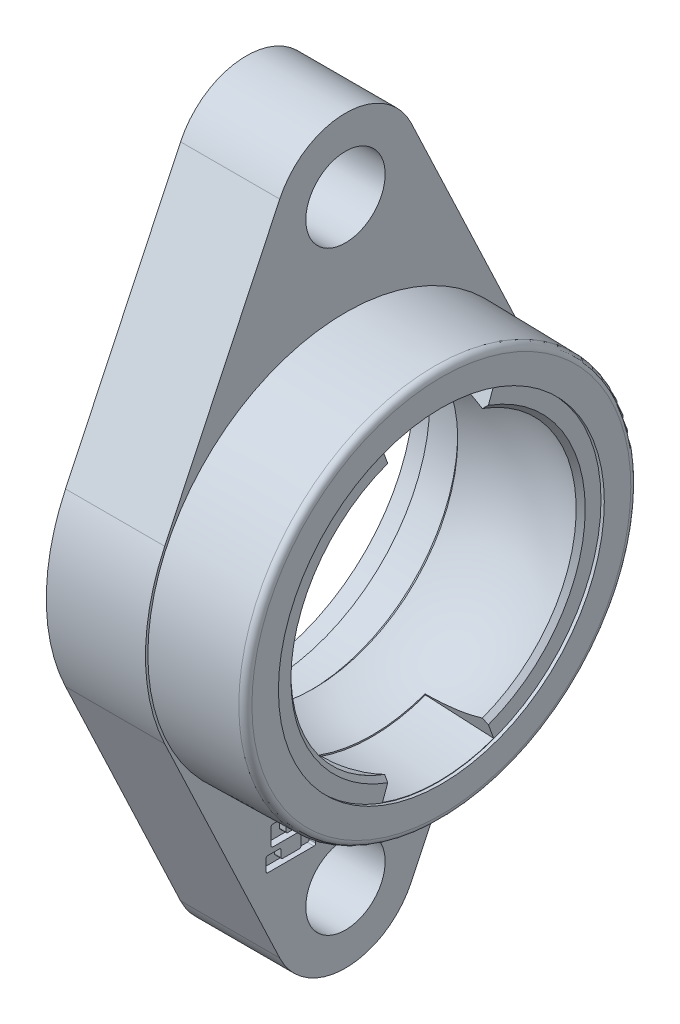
ISO-10303-21;
HEADER;
FILE_DESCRIPTION(('STEP AP214'),'2;1');
FILE_NAME('part.step','',(''),(''),'','','');
FILE_SCHEMA(('AUTOMOTIVE_DESIGN { 1 0 10303 214 1 1 1 1 }'));
ENDSEC;
DATA;
#1=APPLICATION_CONTEXT('core data for automotive mechanical design processes');
#2=APPLICATION_PROTOCOL_DEFINITION('international standard','automotive_design',2000,#1);
#3=PRODUCT_CONTEXT('',#1,'mechanical');
#4=PRODUCT('Part','Part','',(#3));
#5=PRODUCT_RELATED_PRODUCT_CATEGORY('part','',(#4));
#6=PRODUCT_DEFINITION_FORMATION('','',#4);
#7=PRODUCT_DEFINITION_CONTEXT('part definition',#1,'design');
#8=PRODUCT_DEFINITION('design','',#6,#7);
#9=PRODUCT_DEFINITION_SHAPE('','',#8);
#10=(LENGTH_UNIT() NAMED_UNIT(*) SI_UNIT(.MILLI.,.METRE.));
#11=(NAMED_UNIT(*) PLANE_ANGLE_UNIT() SI_UNIT($,.RADIAN.));
#12=(NAMED_UNIT(*) SI_UNIT($,.STERADIAN.) SOLID_ANGLE_UNIT());
#13=UNCERTAINTY_MEASURE_WITH_UNIT(LENGTH_MEASURE(1.E-05),#10,'distance_accuracy_value','');
#14=(GEOMETRIC_REPRESENTATION_CONTEXT(3) GLOBAL_UNCERTAINTY_ASSIGNED_CONTEXT((#13)) GLOBAL_UNIT_ASSIGNED_CONTEXT((#10,
#11,#12)) REPRESENTATION_CONTEXT('',''));
#15=CARTESIAN_POINT('',(0.,0.,0.));
#16=DIRECTION('',(0.,0.,1.));
#17=DIRECTION('',(1.,0.,0.));
#18=AXIS2_PLACEMENT_3D('',#15,#16,#17);
#19=CARTESIAN_POINT('',(10.,0.,0.));
#20=DIRECTION('',(1.,0.,0.));
#21=DIRECTION('',(0.,0.,-1.));
#22=AXIS2_PLACEMENT_3D('',#19,#20,#21);
#23=CONICAL_SURFACE('',#22,24.5756506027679,0.0872664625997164);
#24=DIRECTION('',(-0.996194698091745,-0.081899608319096,-0.0298090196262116));
#25=VECTOR('',#24,1.);
#26=CARTESIAN_POINT('',(10.,23.0935575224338,8.40536754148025));
#27=LINE('',#26,#25);
#28=CARTESIAN_POINT('',(10.,23.0935575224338,8.40536754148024));
#29=VERTEX_POINT('',#28);
#30=CARTESIAN_POINT('',(0.,22.2714330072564,8.10613868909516));
#31=VERTEX_POINT('',#30);
#32=EDGE_CURVE('E851',#29,#31,#27,.T.);
#33=ORIENTED_EDGE('',*,*,#32,.T.);
#34=CARTESIAN_POINT('',(0.,0.,0.));
#35=DIRECTION('',(1.,0.,0.));
#36=DIRECTION('',(0.,0.,-1.));
#37=AXIS2_PLACEMENT_3D('',#34,#35,#36);
#38=CIRCLE('',#37,23.7007639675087);
#39=CARTESIAN_POINT('',(0.,22.2714330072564,-8.10613868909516));
#40=VERTEX_POINT('',#39);
#41=EDGE_CURVE('E850',#31,#40,#38,.F.);
#42=ORIENTED_EDGE('',*,*,#41,.T.);
#43=DIRECTION('',(-0.996194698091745,-0.0818996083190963,0.0298090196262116));
#44=VECTOR('',#43,1.);
#45=CARTESIAN_POINT('',(10.,23.0935575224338,-8.40536754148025));
#46=LINE('',#45,#44);
#47=CARTESIAN_POINT('',(10.,23.0935575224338,-8.40536754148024));
#48=VERTEX_POINT('',#47);
#49=EDGE_CURVE('E846',#48,#40,#46,.T.);
#50=ORIENTED_EDGE('',*,*,#49,.F.);
#51=CARTESIAN_POINT('',(10.,0.,0.));
#52=DIRECTION('',(1.,0.,0.));
#53=DIRECTION('',(0.,0.,-1.));
#54=AXIS2_PLACEMENT_3D('',#51,#52,#53);
#55=CIRCLE('',#54,24.5756506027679);
#56=EDGE_CURVE('E1645',#29,#48,#55,.F.);
#57=ORIENTED_EDGE('',*,*,#56,.F.);
#58=EDGE_LOOP('',(#33,#42,#50,#57));
#59=FACE_BOUND('',#58,.T.);
#60=ADVANCED_FACE('F19',(#59),#23,.F.);
#61=CARTESIAN_POINT('',(10.,0.,0.));
#62=DIRECTION('',(1.,0.,0.));
#63=DIRECTION('',(0.,0.,-1.));
#64=AXIS2_PLACEMENT_3D('',#61,#62,#63);
#65=CONICAL_SURFACE('',#64,24.5756506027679,0.0872664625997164);
#66=DIRECTION('',(0.996194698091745,-0.0818996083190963,-0.0298090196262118));
#67=VECTOR('',#66,1.);
#68=CARTESIAN_POINT('',(0.,-22.2714330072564,-8.10613868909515));
#69=LINE('',#68,#67);
#70=CARTESIAN_POINT('',(0.,-22.2714330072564,-8.10613868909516));
#71=VERTEX_POINT('',#70);
#72=CARTESIAN_POINT('',(10.,-23.0935575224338,-8.40536754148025));
#73=VERTEX_POINT('',#72);
#74=EDGE_CURVE('E803',#71,#73,#69,.T.);
#75=ORIENTED_EDGE('',*,*,#74,.F.);
#76=CARTESIAN_POINT('',(0.,0.,0.));
#77=DIRECTION('',(1.,0.,0.));
#78=DIRECTION('',(0.,0.,-1.));
#79=AXIS2_PLACEMENT_3D('',#76,#77,#78);
#80=CIRCLE('',#79,23.7007639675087);
#81=CARTESIAN_POINT('',(0.,-22.2714330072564,8.10613868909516));
#82=VERTEX_POINT('',#81);
#83=EDGE_CURVE('E805',#71,#82,#80,.F.);
#84=ORIENTED_EDGE('',*,*,#83,.T.);
#85=DIRECTION('',(0.996194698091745,-0.081899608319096,0.0298090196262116));
#86=VECTOR('',#85,1.);
#87=CARTESIAN_POINT('',(0.,-22.2714330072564,8.10613868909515));
#88=LINE('',#87,#86);
#89=CARTESIAN_POINT('',(10.,-23.0935575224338,8.40536754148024));
#90=VERTEX_POINT('',#89);
#91=EDGE_CURVE('E808',#82,#90,#88,.T.);
#92=ORIENTED_EDGE('',*,*,#91,.T.);
#93=CARTESIAN_POINT('',(10.,0.,0.));
#94=DIRECTION('',(1.,0.,0.));
#95=DIRECTION('',(0.,0.,-1.));
#96=AXIS2_PLACEMENT_3D('',#93,#94,#95);
#97=CIRCLE('',#96,24.5756506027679);
#98=EDGE_CURVE('E1636',#73,#90,#97,.F.);
#99=ORIENTED_EDGE('',*,*,#98,.F.);
#100=EDGE_LOOP('',(#75,#84,#92,#99));
#101=FACE_BOUND('',#100,.T.);
#102=ADVANCED_FACE('F807',(#101),#65,.F.);
#103=CARTESIAN_POINT('',(15.1450033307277,-16.1125096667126,-5.86447391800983));
#104=DIRECTION('',(0.,-0.342020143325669,0.939692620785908));
#105=DIRECTION('',(0.,-0.939692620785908,-0.342020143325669));
#106=AXIS2_PLACEMENT_3D('',#103,#104,#105);
#107=PLANE('',#106);
#108=DIRECTION('',(0.,-0.939692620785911,-0.342020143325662));
#109=VECTOR('',#108,1.);
#110=CARTESIAN_POINT('',(10.,-20.9149896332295,-7.61243367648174));
#111=LINE('',#110,#109);
#112=CARTESIAN_POINT('',(9.99999999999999,-20.9149896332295,-7.61243367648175));
#113=VERTEX_POINT('',#112);
#114=EDGE_CURVE('E1639',#113,#73,#111,.T.);
#115=ORIENTED_EDGE('',*,*,#114,.F.);
#116=DIRECTION('',(-0.707106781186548,0.664463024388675,0.241844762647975));
#117=VECTOR('',#116,1.);
#118=CARTESIAN_POINT('',(9.65845557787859,-20.5940428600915,-7.4956186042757));
#119=LINE('',#118,#117);
#120=CARTESIAN_POINT('',(9.31691115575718,-20.2730960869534,-7.37880353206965));
#121=VERTEX_POINT('',#120);
#122=EDGE_CURVE('E839',#113,#121,#119,.T.);
#123=ORIENTED_EDGE('',*,*,#122,.T.);
#124=CARTESIAN_POINT('',(9.31691115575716,-20.2730960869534,-7.37880353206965));
#125=CARTESIAN_POINT('',(9.01112372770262,-20.3971871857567,-7.42396899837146));
#126=CARTESIAN_POINT('',(8.70256802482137,-20.515153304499,-7.46690515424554));
#127=CARTESIAN_POINT('',(8.08039766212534,-20.7386591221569,-7.54825461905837));
#128=CARTESIAN_POINT('',(7.76678295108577,-20.8441986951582,-7.58666788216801));
#129=CARTESIAN_POINT('',(6.81885003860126,-21.1419803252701,-7.69505153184));
#130=CARTESIAN_POINT('',(6.17766256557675,-21.315296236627,-7.75813336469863));
#131=CARTESIAN_POINT('',(4.89295986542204,-21.6075898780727,-7.86451954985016));
#132=CARTESIAN_POINT('',(4.24966541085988,-21.7274329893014,-7.90813887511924));
#133=CARTESIAN_POINT('',(2.95499930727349,-21.9161333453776,-7.9768201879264));
#134=CARTESIAN_POINT('',(2.30363362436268,-21.9850262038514,-8.00189513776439));
#135=CARTESIAN_POINT('',(1.37636667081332,-22.0463834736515,-8.02422735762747));
#136=CARTESIAN_POINT('',(1.10189541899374,-22.0600000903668,-8.02918340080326));
#137=CARTESIAN_POINT('',(0.551628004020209,-22.078212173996,-8.03581205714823));
#138=CARTESIAN_POINT('',(0.275830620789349,-22.0827750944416,-8.03747282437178));
#139=CARTESIAN_POINT('',(0.,-22.0827765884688,-8.03747336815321));
#140=B_SPLINE_CURVE_WITH_KNOTS('',3,(#124,#125,#126,#127,#128,#129,#130,#131,#132,#133,#134,
#135,#136,#137,#138,#139),.UNSPECIFIED.,.F.,.F.,(4,2,2,2,2,2,2,4),(0.,0.999089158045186,
1.99818843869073,3.99710194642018,5.96237534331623,7.92627373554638,8.75069808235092,
9.57808076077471),.UNSPECIFIED.);
#141=CARTESIAN_POINT('',(0.,-22.0827765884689,-8.03747336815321));
#142=VERTEX_POINT('',#141);
#143=EDGE_CURVE('E1629',#121,#142,#140,.T.);
#144=ORIENTED_EDGE('',*,*,#143,.T.);
#145=DIRECTION('',(0.,-0.939692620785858,-0.342020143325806));
#146=VECTOR('',#145,1.);
#147=CARTESIAN_POINT('',(0.,-22.0827765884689,-8.03747336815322));
#148=LINE('',#147,#146);
#149=EDGE_CURVE('E815',#142,#71,#148,.T.);
#150=ORIENTED_EDGE('',*,*,#149,.T.);
#151=ORIENTED_EDGE('',*,*,#74,.T.);
#152=EDGE_LOOP('',(#115,#123,#144,#150,#151));
#153=FACE_BOUND('',#152,.T.);
#154=ADVANCED_FACE('F1625',(#153),#107,.T.);
#155=CARTESIAN_POINT('',(0.,-15.4929753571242,5.638981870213));
#156=DIRECTION('',(-1.,0.,0.));
#157=DIRECTION('',(0.,0.,1.));
#158=AXIS2_PLACEMENT_3D('',#155,#156,#157);
#159=PLANE('',#158);
#160=DIRECTION('',(0.,-0.939692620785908,0.342020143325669));
#161=VECTOR('',#160,1.);
#162=CARTESIAN_POINT('',(0.,-16.1125096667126,5.86447391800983));
#163=LINE('',#162,#161);
#164=CARTESIAN_POINT('',(0.,-22.0827765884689,8.03747336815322));
#165=VERTEX_POINT('',#164);
#166=EDGE_CURVE('E814',#165,#82,#163,.T.);
#167=ORIENTED_EDGE('',*,*,#166,.T.);
#168=ORIENTED_EDGE('',*,*,#83,.F.);
#169=ORIENTED_EDGE('',*,*,#149,.F.);
#170=CARTESIAN_POINT('',(0.,0.,0.));
#171=DIRECTION('',(1.,0.,0.));
#172=DIRECTION('',(0.,0.,-1.));
#173=AXIS2_PLACEMENT_3D('',#170,#171,#172);
#174=CIRCLE('',#173,23.5);
#175=EDGE_CURVE('E830',#142,#165,#174,.F.);
#176=ORIENTED_EDGE('',*,*,#175,.T.);
#177=EDGE_LOOP('',(#167,#168,#169,#176));
#178=FACE_BOUND('',#177,.T.);
#179=ADVANCED_FACE('F828',(#178),#159,.F.);
#180=CARTESIAN_POINT('',(15.1450033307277,-16.1125096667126,5.86447391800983));
#181=DIRECTION('',(0.,0.342020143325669,0.939692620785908));
#182=DIRECTION('',(0.,-0.939692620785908,0.342020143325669));
#183=AXIS2_PLACEMENT_3D('',#180,#181,#182);
#184=PLANE('',#183);
#185=DIRECTION('',(-0.707106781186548,0.664463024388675,-0.241844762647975));
#186=VECTOR('',#185,1.);
#187=CARTESIAN_POINT('',(9.65845557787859,-20.5940428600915,7.49561860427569));
#188=LINE('',#187,#186);
#189=CARTESIAN_POINT('',(9.31691115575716,-20.2730960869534,7.37880353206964));
#190=VERTEX_POINT('',#189);
#191=CARTESIAN_POINT('',(9.99999999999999,-20.9149896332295,7.61243367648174));
#192=VERTEX_POINT('',#191);
#193=EDGE_CURVE('E825',#190,#192,#188,.F.);
#194=ORIENTED_EDGE('',*,*,#193,.T.);
#195=DIRECTION('',(0.,0.939692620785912,-0.342020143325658));
#196=VECTOR('',#195,1.);
#197=CARTESIAN_POINT('',(10.,-23.0935575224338,8.40536754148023));
#198=LINE('',#197,#196);
#199=EDGE_CURVE('E823',#90,#192,#198,.T.);
#200=ORIENTED_EDGE('',*,*,#199,.F.);
#201=ORIENTED_EDGE('',*,*,#91,.F.);
#202=ORIENTED_EDGE('',*,*,#166,.F.);
#203=CARTESIAN_POINT('',(0.,-22.0827765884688,8.03747336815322));
#204=CARTESIAN_POINT('',(0.33308327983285,-22.0827759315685,8.03747312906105));
#205=CARTESIAN_POINT('',(0.666123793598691,-22.0761209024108,8.03505089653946));
#206=CARTESIAN_POINT('',(1.33160638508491,-22.0495180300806,8.02536824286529));
#207=CARTESIAN_POINT('',(1.66404845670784,-22.0295700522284,8.01810777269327));
#208=CARTESIAN_POINT('',(2.65993499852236,-21.9497917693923,7.98907085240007));
#209=CARTESIAN_POINT('',(3.32170070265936,-21.8700271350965,7.96003889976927));
#210=CARTESIAN_POINT('',(4.62444336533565,-21.6597454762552,7.88350263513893));
#211=CARTESIAN_POINT('',(5.26558275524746,-21.530105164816,7.83631742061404));
#212=CARTESIAN_POINT('',(6.53376543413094,-21.2210077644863,7.72381516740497));
#213=CARTESIAN_POINT('',(7.16081827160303,-21.0415855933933,7.65851083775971));
#214=CARTESIAN_POINT('',(8.03798297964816,-20.7524570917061,7.55327666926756));
#215=CARTESIAN_POINT('',(8.29570631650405,-20.6627023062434,7.52060859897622));
#216=CARTESIAN_POINT('',(8.80856322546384,-20.4744172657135,7.45207844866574));
#217=CARTESIAN_POINT('',(9.06368418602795,-20.3758566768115,7.41620532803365));
#218=CARTESIAN_POINT('',(9.31691115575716,-20.2730960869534,7.37880353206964));
#219=B_SPLINE_CURVE_WITH_KNOTS('',3,(#203,#204,#205,#206,#207,#208,#209,#210,#211,#212,#213,
#214,#215,#216,#217,#218),.UNSPECIFIED.,.F.,.F.,(4,2,2,2,2,2,2,4),(0.,0.999089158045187,
1.99818843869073,3.99710194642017,5.96237534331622,7.92627373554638,8.75069808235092,
9.57808076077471),.UNSPECIFIED.);
#220=EDGE_CURVE('E1613',#165,#190,#219,.T.);
#221=ORIENTED_EDGE('',*,*,#220,.T.);
#222=EDGE_LOOP('',(#194,#200,#201,#202,#221));
#223=FACE_BOUND('',#222,.T.);
#224=ADVANCED_FACE('F820',(#223),#184,.F.);
#225=CARTESIAN_POINT('',(9.99999999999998,0.,0.));
#226=DIRECTION('',(1.,0.,0.));
#227=DIRECTION('',(0.,0.,-1.));
#228=AXIS2_PLACEMENT_3D('',#225,#226,#227);
#229=CONICAL_SURFACE('',#228,22.257267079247,0.785398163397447);
#230=ORIENTED_EDGE('',*,*,#193,.F.);
#231=CARTESIAN_POINT('',(9.31691115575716,0.,0.));
#232=DIRECTION('',(1.,0.,0.));
#233=DIRECTION('',(0.,1.,0.));
#234=AXIS2_PLACEMENT_3D('',#231,#232,#233);
#235=CIRCLE('',#234,21.5741782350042);
#236=CARTESIAN_POINT('',(9.31691115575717,20.2730960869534,7.37880353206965));
#237=VERTEX_POINT('',#236);
#238=EDGE_CURVE('E1612',#190,#237,#235,.F.);
#239=ORIENTED_EDGE('',*,*,#238,.T.);
#240=DIRECTION('',(0.707106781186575,0.664463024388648,0.241844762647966));
#241=VECTOR('',#240,1.);
#242=CARTESIAN_POINT('',(9.31691115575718,20.2730960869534,7.37880353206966));
#243=LINE('',#242,#241);
#244=CARTESIAN_POINT('',(9.99999999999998,20.9149896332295,7.61243367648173));
#245=VERTEX_POINT('',#244);
#246=EDGE_CURVE('E853',#237,#245,#243,.T.);
#247=ORIENTED_EDGE('',*,*,#246,.T.);
#248=CARTESIAN_POINT('',(9.99999999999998,0.,0.));
#249=DIRECTION('',(1.,0.,0.));
#250=DIRECTION('',(0.,0.,-1.));
#251=AXIS2_PLACEMENT_3D('',#248,#249,#250);
#252=CIRCLE('',#251,22.257267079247);
#253=EDGE_CURVE('E1649',#192,#245,#252,.F.);
#254=ORIENTED_EDGE('',*,*,#253,.F.);
#255=EDGE_LOOP('',(#230,#239,#247,#254));
#256=FACE_BOUND('',#255,.T.);
#257=ADVANCED_FACE('F1602',(#256),#229,.F.);
#258=CARTESIAN_POINT('',(15.1450033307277,16.1125096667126,5.86447391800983));
#259=DIRECTION('',(0.,-0.342020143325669,0.939692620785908));
#260=DIRECTION('',(0.,-0.939692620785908,-0.342020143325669));
#261=AXIS2_PLACEMENT_3D('',#258,#259,#260);
#262=PLANE('',#261);
#263=ORIENTED_EDGE('',*,*,#246,.F.);
#264=CARTESIAN_POINT('',(9.31691115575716,20.2730960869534,7.37880353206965));
#265=CARTESIAN_POINT('',(9.01112372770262,20.3971871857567,7.42396899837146));
#266=CARTESIAN_POINT('',(8.70256802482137,20.515153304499,7.46690515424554));
#267=CARTESIAN_POINT('',(8.08039766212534,20.7386591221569,7.54825461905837));
#268=CARTESIAN_POINT('',(7.76678295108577,20.8441986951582,7.58666788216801));
#269=CARTESIAN_POINT('',(6.81885003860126,21.1419803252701,7.69505153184));
#270=CARTESIAN_POINT('',(6.17766256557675,21.315296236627,7.75813336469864));
#271=CARTESIAN_POINT('',(4.89295986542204,21.6075898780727,7.86451954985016));
#272=CARTESIAN_POINT('',(4.24966541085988,21.7274329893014,7.90813887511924));
#273=CARTESIAN_POINT('',(2.95499930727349,21.9161333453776,7.9768201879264));
#274=CARTESIAN_POINT('',(2.30363362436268,21.9850262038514,8.00189513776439));
#275=CARTESIAN_POINT('',(1.37636667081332,22.0463834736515,8.02422735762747));
#276=CARTESIAN_POINT('',(1.10189541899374,22.0600000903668,8.02918340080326));
#277=CARTESIAN_POINT('',(0.551628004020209,22.078212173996,8.03581205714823));
#278=CARTESIAN_POINT('',(0.275830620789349,22.0827750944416,8.03747282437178));
#279=CARTESIAN_POINT('',(0.,22.0827765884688,8.03747336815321));
#280=B_SPLINE_CURVE_WITH_KNOTS('',3,(#264,#265,#266,#267,#268,#269,#270,#271,#272,#273,#274,
#275,#276,#277,#278,#279),.UNSPECIFIED.,.F.,.F.,(4,2,2,2,2,2,2,4),(0.,0.999089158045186,
1.99818843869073,3.99710194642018,5.96237534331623,7.92627373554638,8.75069808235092,
9.57808076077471),.UNSPECIFIED.);
#281=CARTESIAN_POINT('',(0.,22.0827765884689,8.03747336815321));
#282=VERTEX_POINT('',#281);
#283=EDGE_CURVE('E1605',#237,#282,#280,.T.);
#284=ORIENTED_EDGE('',*,*,#283,.T.);
#285=DIRECTION('',(0.,0.939692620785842,0.342020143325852));
#286=VECTOR('',#285,1.);
#287=CARTESIAN_POINT('',(0.,22.0827765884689,8.03747336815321));
#288=LINE('',#287,#286);
#289=EDGE_CURVE('E1654',#282,#31,#288,.T.);
#290=ORIENTED_EDGE('',*,*,#289,.T.);
#291=ORIENTED_EDGE('',*,*,#32,.F.);
#292=DIRECTION('',(0.,0.939692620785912,0.342020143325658));
#293=VECTOR('',#292,1.);
#294=CARTESIAN_POINT('',(10.,20.9149896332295,7.61243367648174));
#295=LINE('',#294,#293);
#296=EDGE_CURVE('E1648',#245,#29,#295,.T.);
#297=ORIENTED_EDGE('',*,*,#296,.F.);
#298=EDGE_LOOP('',(#263,#284,#290,#291,#297));
#299=FACE_BOUND('',#298,.T.);
#300=ADVANCED_FACE('F1597',(#299),#262,.F.);
#301=CARTESIAN_POINT('',(0.,15.4929753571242,5.638981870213));
#302=DIRECTION('',(-1.,0.,0.));
#303=DIRECTION('',(0.,-1.,0.));
#304=AXIS2_PLACEMENT_3D('',#301,#302,#303);
#305=PLANE('',#304);
#306=DIRECTION('',(0.,-0.939692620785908,0.342020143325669));
#307=VECTOR('',#306,1.);
#308=CARTESIAN_POINT('',(0.,16.1125096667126,-5.86447391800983));
#309=LINE('',#308,#307);
#310=CARTESIAN_POINT('',(0.,22.0827765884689,-8.03747336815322));
#311=VERTEX_POINT('',#310);
#312=EDGE_CURVE('E849',#40,#311,#309,.T.);
#313=ORIENTED_EDGE('',*,*,#312,.F.);
#314=ORIENTED_EDGE('',*,*,#41,.F.);
#315=ORIENTED_EDGE('',*,*,#289,.F.);
#316=CARTESIAN_POINT('',(0.,0.,0.));
#317=DIRECTION('',(1.,0.,0.));
#318=DIRECTION('',(0.,0.,-1.));
#319=AXIS2_PLACEMENT_3D('',#316,#317,#318);
#320=CIRCLE('',#319,23.5);
#321=EDGE_CURVE('E1580',#282,#311,#320,.F.);
#322=ORIENTED_EDGE('',*,*,#321,.T.);
#323=EDGE_LOOP('',(#313,#314,#315,#322));
#324=FACE_BOUND('',#323,.T.);
#325=ADVANCED_FACE('F1593',(#324),#305,.F.);
#326=CARTESIAN_POINT('',(15.1450033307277,16.1125096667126,-5.86447391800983));
#327=DIRECTION('',(0.,0.342020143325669,0.939692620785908));
#328=DIRECTION('',(0.,-0.939692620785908,0.342020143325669));
#329=AXIS2_PLACEMENT_3D('',#326,#327,#328);
#330=PLANE('',#329);
#331=CARTESIAN_POINT('',(0.,22.0827765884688,-8.03747336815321));
#332=CARTESIAN_POINT('',(0.333083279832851,22.0827759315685,-8.03747312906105));
#333=CARTESIAN_POINT('',(0.666123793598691,22.0761209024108,-8.03505089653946));
#334=CARTESIAN_POINT('',(1.33160638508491,22.0495180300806,-8.0253682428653));
#335=CARTESIAN_POINT('',(1.66404845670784,22.0295700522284,-8.01810777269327));
#336=CARTESIAN_POINT('',(2.65993499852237,21.9497917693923,-7.98907085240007));
#337=CARTESIAN_POINT('',(3.32170070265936,21.8700271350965,-7.96003889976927));
#338=CARTESIAN_POINT('',(4.62444336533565,21.6597454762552,-7.88350263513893));
#339=CARTESIAN_POINT('',(5.26558275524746,21.530105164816,-7.83631742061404));
#340=CARTESIAN_POINT('',(6.53376543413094,21.2210077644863,-7.72381516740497));
#341=CARTESIAN_POINT('',(7.16081827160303,21.0415855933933,-7.65851083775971));
#342=CARTESIAN_POINT('',(8.03798297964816,20.7524570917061,-7.55327666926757));
#343=CARTESIAN_POINT('',(8.29570631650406,20.6627023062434,-7.52060859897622));
#344=CARTESIAN_POINT('',(8.80856322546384,20.4744172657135,-7.45207844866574));
#345=CARTESIAN_POINT('',(9.06368418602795,20.3758566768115,-7.41620532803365));
#346=CARTESIAN_POINT('',(9.31691115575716,20.2730960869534,-7.37880353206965));
#347=B_SPLINE_CURVE_WITH_KNOTS('',3,(#331,#332,#333,#334,#335,#336,#337,#338,#339,#340,#341,
#342,#343,#344,#345,#346),.UNSPECIFIED.,.F.,.F.,(4,2,2,2,2,2,2,4),(0.,0.999089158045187,
1.99818843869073,3.99710194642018,5.96237534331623,7.92627373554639,8.75069808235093,
9.57808076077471),.UNSPECIFIED.);
#348=CARTESIAN_POINT('',(9.31691115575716,20.2730960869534,-7.37880353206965));
#349=VERTEX_POINT('',#348);
#350=EDGE_CURVE('E1571',#311,#349,#347,.T.);
#351=ORIENTED_EDGE('',*,*,#350,.T.);
#352=DIRECTION('',(-0.707106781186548,-0.664463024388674,0.241844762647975));
#353=VECTOR('',#352,1.);
#354=CARTESIAN_POINT('',(9.65845557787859,20.5940428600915,-7.4956186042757));
#355=LINE('',#354,#353);
#356=CARTESIAN_POINT('',(9.99999999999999,20.9149896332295,-7.61243367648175));
#357=VERTEX_POINT('',#356);
#358=EDGE_CURVE('E843',#349,#357,#355,.F.);
#359=ORIENTED_EDGE('',*,*,#358,.T.);
#360=DIRECTION('',(0.,-0.939692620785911,0.342020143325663));
#361=VECTOR('',#360,1.);
#362=CARTESIAN_POINT('',(10.,23.0935575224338,-8.40536754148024));
#363=LINE('',#362,#361);
#364=EDGE_CURVE('E1644',#48,#357,#363,.T.);
#365=ORIENTED_EDGE('',*,*,#364,.F.);
#366=ORIENTED_EDGE('',*,*,#49,.T.);
#367=ORIENTED_EDGE('',*,*,#312,.T.);
#368=EDGE_LOOP('',(#351,#359,#365,#366,#367));
#369=FACE_BOUND('',#368,.T.);
#370=ADVANCED_FACE('F1587',(#369),#330,.T.);
#371=CARTESIAN_POINT('',(9.99999999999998,0.,0.));
#372=DIRECTION('',(1.,0.,0.));
#373=DIRECTION('',(0.,0.,-1.));
#374=AXIS2_PLACEMENT_3D('',#371,#372,#373);
#375=CONICAL_SURFACE('',#374,22.257267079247,0.785398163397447);
#376=CARTESIAN_POINT('',(9.99999999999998,0.,0.));
#377=DIRECTION('',(1.,0.,0.));
#378=DIRECTION('',(0.,0.,-1.));
#379=AXIS2_PLACEMENT_3D('',#376,#377,#378);
#380=CIRCLE('',#379,22.257267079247);
#381=EDGE_CURVE('E1640',#357,#113,#380,.F.);
#382=ORIENTED_EDGE('',*,*,#381,.F.);
#383=ORIENTED_EDGE('',*,*,#358,.F.);
#384=CARTESIAN_POINT('',(9.31691115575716,0.,0.));
#385=DIRECTION('',(1.,0.,0.));
#386=DIRECTION('',(0.,1.,0.));
#387=AXIS2_PLACEMENT_3D('',#384,#385,#386);
#388=CIRCLE('',#387,21.5741782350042);
#389=EDGE_CURVE('E1570',#349,#121,#388,.F.);
#390=ORIENTED_EDGE('',*,*,#389,.T.);
#391=ORIENTED_EDGE('',*,*,#122,.F.);
#392=EDGE_LOOP('',(#382,#383,#390,#391));
#393=FACE_BOUND('',#392,.T.);
#394=ADVANCED_FACE('F1592',(#393),#375,.F.);
#395=CARTESIAN_POINT('',(10.,23.4511335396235,0.));
#396=DIRECTION('',(1.,0.,0.));
#397=DIRECTION('',(0.,0.,-1.));
#398=AXIS2_PLACEMENT_3D('',#395,#396,#397);
#399=PLANE('',#398);
#400=CARTESIAN_POINT('',(10.,0.,0.));
#401=DIRECTION('',(1.,0.,0.));
#402=DIRECTION('',(0.,0.,-1.));
#403=AXIS2_PLACEMENT_3D('',#400,#401,#402);
#404=CIRCLE('',#403,24.645);
#405=CARTESIAN_POINT('',(10.,0.,-24.645));
#406=VERTEX_POINT('',#405);
#407=EDGE_CURVE('E1566',#406,#406,#404,.T.);
#408=ORIENTED_EDGE('',*,*,#407,.T.);
#409=EDGE_LOOP('',(#408));
#410=FACE_BOUND('',#409,.T.);
#411=ORIENTED_EDGE('',*,*,#114,.T.);
#412=ORIENTED_EDGE('',*,*,#98,.T.);
#413=ORIENTED_EDGE('',*,*,#199,.T.);
#414=ORIENTED_EDGE('',*,*,#253,.T.);
#415=ORIENTED_EDGE('',*,*,#296,.T.);
#416=ORIENTED_EDGE('',*,*,#56,.T.);
#417=ORIENTED_EDGE('',*,*,#364,.T.);
#418=ORIENTED_EDGE('',*,*,#381,.T.);
#419=EDGE_LOOP('',(#411,#412,#413,#414,#415,#416,#417,#418));
#420=FACE_BOUND('',#419,.T.);
#421=ADVANCED_FACE('F2057',(#410,#420),#399,.T.);
#422=CARTESIAN_POINT('',(0.,0.,0.));
#423=DIRECTION('',(1.,0.,0.));
#424=DIRECTION('',(0.,1.,0.));
#425=AXIS2_PLACEMENT_3D('',#422,#423,#424);
#426=SPHERICAL_SURFACE('',#425,23.5);
#427=ORIENTED_EDGE('',*,*,#238,.F.);
#428=ORIENTED_EDGE('',*,*,#220,.F.);
#429=ORIENTED_EDGE('',*,*,#175,.F.);
#430=ORIENTED_EDGE('',*,*,#143,.F.);
#431=ORIENTED_EDGE('',*,*,#389,.F.);
#432=ORIENTED_EDGE('',*,*,#350,.F.);
#433=ORIENTED_EDGE('',*,*,#321,.F.);
#434=ORIENTED_EDGE('',*,*,#283,.F.);
#435=EDGE_LOOP('',(#427,#428,#429,#430,#431,#432,#433,#434));
#436=FACE_BOUND('',#435,.T.);
#437=CARTESIAN_POINT('',(-8.8098957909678,0.,0.));
#438=DIRECTION('',(-1.,0.,0.));
#439=DIRECTION('',(0.,1.,0.));
#440=AXIS2_PLACEMENT_3D('',#437,#438,#439);
#441=CIRCLE('',#440,21.7861363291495);
#442=CARTESIAN_POINT('',(-8.8098957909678,21.7861363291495,0.));
#443=VERTEX_POINT('',#442);
#444=EDGE_CURVE('E1565',#443,#443,#441,.T.);
#445=ORIENTED_EDGE('',*,*,#444,.T.);
#446=EDGE_LOOP('',(#445));
#447=FACE_BOUND('',#446,.T.);
#448=ADVANCED_FACE('F1582',(#436,#447),#426,.F.);
#449=CARTESIAN_POINT('',(10.25,0.,0.));
#450=DIRECTION('',(1.,0.,0.));
#451=DIRECTION('',(0.,0.,-1.));
#452=AXIS2_PLACEMENT_3D('',#449,#450,#451);
#453=CYLINDRICAL_SURFACE('',#452,24.645);
#454=CARTESIAN_POINT('',(10.5,0.,0.));
#455=DIRECTION('',(1.,0.,0.));
#456=DIRECTION('',(0.,0.,-1.));
#457=AXIS2_PLACEMENT_3D('',#454,#455,#456);
#458=CIRCLE('',#457,24.645);
#459=CARTESIAN_POINT('',(10.5,0.,-24.645));
#460=VERTEX_POINT('',#459);
#461=EDGE_CURVE('E1561',#460,#460,#458,.F.);
#462=ORIENTED_EDGE('',*,*,#461,.F.);
#463=EDGE_LOOP('',(#462));
#464=FACE_BOUND('',#463,.T.);
#465=ORIENTED_EDGE('',*,*,#407,.F.);
#466=EDGE_LOOP('',(#465));
#467=FACE_BOUND('',#466,.T.);
#468=ADVANCED_FACE('F3208',(#464,#467),#453,.F.);
#469=CARTESIAN_POINT('',(-9.5,0.,0.));
#470=DIRECTION('',(-1.,0.,0.));
#471=DIRECTION('',(0.,0.,1.));
#472=AXIS2_PLACEMENT_3D('',#469,#470,#471);
#473=CONICAL_SURFACE('',#472,22.4762405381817,0.78539816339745);
#474=ORIENTED_EDGE('',*,*,#444,.F.);
#475=EDGE_LOOP('',(#474));
#476=FACE_BOUND('',#475,.T.);
#477=CARTESIAN_POINT('',(-9.5,0.,0.));
#478=DIRECTION('',(-1.,0.,0.));
#479=DIRECTION('',(0.,0.,1.));
#480=AXIS2_PLACEMENT_3D('',#477,#478,#479);
#481=CIRCLE('',#480,22.4762405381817);
#482=CARTESIAN_POINT('',(-9.5,0.,22.4762405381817));
#483=VERTEX_POINT('',#482);
#484=EDGE_CURVE('E1557',#483,#483,#481,.F.);
#485=ORIENTED_EDGE('',*,*,#484,.F.);
#486=EDGE_LOOP('',(#485));
#487=FACE_BOUND('',#486,.T.);
#488=ADVANCED_FACE('F3201',(#476,#487),#473,.F.);
#489=CARTESIAN_POINT('',(10.5,26.6486891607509,0.));
#490=DIRECTION('',(1.,0.,0.));
#491=DIRECTION('',(0.,0.,-1.));
#492=AXIS2_PLACEMENT_3D('',#489,#490,#491);
#493=PLANE('',#492);
#494=ORIENTED_EDGE('',*,*,#461,.T.);
#495=EDGE_LOOP('',(#494));
#496=FACE_BOUND('',#495,.T.);
#497=CARTESIAN_POINT('',(10.5,0.,0.));
#498=DIRECTION('',(-1.,0.,0.));
#499=DIRECTION('',(0.,0.,1.));
#500=AXIS2_PLACEMENT_3D('',#497,#498,#499);
#501=CIRCLE('',#500,28.6523783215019);
#502=CARTESIAN_POINT('',(10.5,0.,28.6523783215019));
#503=VERTEX_POINT('',#502);
#504=CARTESIAN_POINT('',(10.5,28.6523783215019,0.));
#505=VERTEX_POINT('',#504);
#506=EDGE_CURVE('E1961',#503,#505,#501,.T.);
#507=ORIENTED_EDGE('',*,*,#506,.F.);
#508=CARTESIAN_POINT('',(10.5,0.,0.));
#509=DIRECTION('',(-1.,0.,0.));
#510=DIRECTION('',(0.,0.,-1.));
#511=AXIS2_PLACEMENT_3D('',#508,#509,#510);
#512=CIRCLE('',#511,28.6523783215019);
#513=CARTESIAN_POINT('',(10.5,0.,-28.6523783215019));
#514=VERTEX_POINT('',#513);
#515=EDGE_CURVE('E1528',#514,#503,#512,.T.);
#516=ORIENTED_EDGE('',*,*,#515,.F.);
#517=CARTESIAN_POINT('',(10.5,0.,0.));
#518=DIRECTION('',(-1.,0.,0.));
#519=DIRECTION('',(0.,1.,0.));
#520=AXIS2_PLACEMENT_3D('',#517,#518,#519);
#521=CIRCLE('',#520,28.6523783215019);
#522=EDGE_CURVE('E1958',#505,#514,#521,.T.);
#523=ORIENTED_EDGE('',*,*,#522,.F.);
#524=EDGE_LOOP('',(#507,#516,#523));
#525=FACE_BOUND('',#524,.T.);
#526=ADVANCED_FACE('F1931',(#496,#525),#493,.T.);
#527=CARTESIAN_POINT('',(-9.5,23.2631202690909,0.));
#528=DIRECTION('',(-1.,0.,0.));
#529=DIRECTION('',(0.,-1.,0.));
#530=AXIS2_PLACEMENT_3D('',#527,#528,#529);
#531=PLANE('',#530);
#532=CARTESIAN_POINT('',(-9.5,0.,0.));
#533=DIRECTION('',(1.,0.,0.));
#534=DIRECTION('',(0.,0.,1.));
#535=AXIS2_PLACEMENT_3D('',#532,#533,#534);
#536=CIRCLE('',#535,24.05);
#537=CARTESIAN_POINT('',(-9.50000000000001,0.,-24.05));
#538=VERTEX_POINT('',#537);
#539=CARTESIAN_POINT('',(-9.50000000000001,0.,24.05));
#540=VERTEX_POINT('',#539);
#541=EDGE_CURVE('E1662',#538,#540,#536,.F.);
#542=ORIENTED_EDGE('',*,*,#541,.T.);
#543=CARTESIAN_POINT('',(-9.5,0.,0.));
#544=DIRECTION('',(1.,0.,0.));
#545=DIRECTION('',(0.,1.,0.));
#546=AXIS2_PLACEMENT_3D('',#543,#544,#545);
#547=CIRCLE('',#546,24.05);
#548=CARTESIAN_POINT('',(-9.5,24.05,0.));
#549=VERTEX_POINT('',#548);
#550=EDGE_CURVE('E1950',#540,#549,#547,.F.);
#551=ORIENTED_EDGE('',*,*,#550,.T.);
#552=CARTESIAN_POINT('',(-9.5,0.,0.));
#553=DIRECTION('',(1.,0.,0.));
#554=DIRECTION('',(0.,0.,-1.));
#555=AXIS2_PLACEMENT_3D('',#552,#553,#554);
#556=CIRCLE('',#555,24.05);
#557=EDGE_CURVE('E1524',#549,#538,#556,.F.);
#558=ORIENTED_EDGE('',*,*,#557,.T.);
#559=EDGE_LOOP('',(#542,#551,#558));
#560=FACE_BOUND('',#559,.T.);
#561=ORIENTED_EDGE('',*,*,#484,.T.);
#562=EDGE_LOOP('',(#561));
#563=FACE_BOUND('',#562,.T.);
#564=ADVANCED_FACE('F1920',(#560,#563),#531,.T.);
#565=CARTESIAN_POINT('',(-5.,0.,0.));
#566=DIRECTION('',(1.,0.,0.));
#567=DIRECTION('',(0.,0.,-1.));
#568=AXIS2_PLACEMENT_3D('',#565,#566,#567);
#569=PLANE('',#568);
#570=CARTESIAN_POINT('',(-5.,-31.875,-4.775));
#571=DIRECTION('',(1.,0.,0.));
#572=DIRECTION('',(0.,0.,-1.));
#573=AXIS2_PLACEMENT_3D('',#570,#571,#572);
#574=CIRCLE('',#573,0.249999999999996);
#575=CARTESIAN_POINT('',(-5.,-31.625,-4.775));
#576=VERTEX_POINT('',#575);
#577=CARTESIAN_POINT('',(-5.,-31.875,-4.525));
#578=VERTEX_POINT('',#577);
#579=EDGE_CURVE('E1513',#576,#578,#574,.T.);
#580=ORIENTED_EDGE('',*,*,#579,.T.);
#581=DIRECTION('',(0.,1.,0.));
#582=VECTOR('',#581,1.);
#583=CARTESIAN_POINT('',(-5.,-31.875,-4.525));
#584=LINE('',#583,#582);
#585=CARTESIAN_POINT('',(-5.,-33.5214466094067,-4.525));
#586=VERTEX_POINT('',#585);
#587=EDGE_CURVE('E1523',#578,#586,#584,.F.);
#588=ORIENTED_EDGE('',*,*,#587,.T.);
#589=CARTESIAN_POINT('',(-5.,-33.5214466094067,-4.77499999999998));
#590=DIRECTION('',(1.,0.,0.));
#591=DIRECTION('',(0.,0.,-1.));
#592=AXIS2_PLACEMENT_3D('',#589,#590,#591);
#593=CIRCLE('',#592,0.24999999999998);
#594=CARTESIAN_POINT('',(-5.,-33.6982233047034,-4.59822330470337));
#595=VERTEX_POINT('',#594);
#596=EDGE_CURVE('E1519',#586,#595,#593,.T.);
#597=ORIENTED_EDGE('',*,*,#596,.T.);
#598=DIRECTION('',(0.,-0.707106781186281,-0.707106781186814));
#599=VECTOR('',#598,1.);
#600=CARTESIAN_POINT('',(-5.,-33.6982233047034,-4.59822330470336));
#601=LINE('',#600,#599);
#602=CARTESIAN_POINT('',(-5.,-33.8017766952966,-4.7017766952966));
#603=VERTEX_POINT('',#602);
#604=EDGE_CURVE('E1556',#595,#603,#601,.T.);
#605=ORIENTED_EDGE('',*,*,#604,.T.);
#606=CARTESIAN_POINT('',(-5.,-33.9785533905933,-4.525));
#607=DIRECTION('',(1.,0.,0.));
#608=DIRECTION('',(0.,0.,-1.));
#609=AXIS2_PLACEMENT_3D('',#606,#607,#608);
#610=CIRCLE('',#609,0.249999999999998);
#611=CARTESIAN_POINT('',(-5.,-33.9785533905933,-4.775));
#612=VERTEX_POINT('',#611);
#613=EDGE_CURVE('E1553',#603,#612,#610,.F.);
#614=ORIENTED_EDGE('',*,*,#613,.T.);
#615=DIRECTION('',(0.,1.,0.));
#616=VECTOR('',#615,1.);
#617=CARTESIAN_POINT('',(-5.,0.,-4.775));
#618=LINE('',#617,#616);
#619=CARTESIAN_POINT('',(-5.,-35.2714466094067,-4.775));
#620=VERTEX_POINT('',#619);
#621=EDGE_CURVE('E1552',#612,#620,#618,.F.);
#622=ORIENTED_EDGE('',*,*,#621,.T.);
#623=CARTESIAN_POINT('',(-5.,-35.2714466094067,-4.52499999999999));
#624=DIRECTION('',(1.,0.,0.));
#625=DIRECTION('',(0.,0.,-1.));
#626=AXIS2_PLACEMENT_3D('',#623,#624,#625);
#627=CIRCLE('',#626,0.250000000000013);
#628=CARTESIAN_POINT('',(-5.,-35.4482233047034,-4.70177669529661));
#629=VERTEX_POINT('',#628);
#630=EDGE_CURVE('E1549',#620,#629,#627,.F.);
#631=ORIENTED_EDGE('',*,*,#630,.T.);
#632=DIRECTION('',(0.,-0.707106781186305,0.70710678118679));
#633=VECTOR('',#632,1.);
#634=CARTESIAN_POINT('',(-5.,-35.4482233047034,-4.70177669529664));
#635=LINE('',#634,#633);
#636=CARTESIAN_POINT('',(-5.,-35.5517766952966,-4.59822330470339));
#637=VERTEX_POINT('',#636);
#638=EDGE_CURVE('E1548',#629,#637,#635,.T.);
#639=ORIENTED_EDGE('',*,*,#638,.T.);
#640=CARTESIAN_POINT('',(-5.,-35.7285533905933,-4.775));
#641=DIRECTION('',(1.,0.,0.));
#642=DIRECTION('',(0.,0.,-1.));
#643=AXIS2_PLACEMENT_3D('',#640,#641,#642);
#644=CIRCLE('',#643,0.250000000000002);
#645=CARTESIAN_POINT('',(-5.,-35.7285533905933,-4.525));
#646=VERTEX_POINT('',#645);
#647=EDGE_CURVE('E1545',#637,#646,#644,.T.);
#648=ORIENTED_EDGE('',*,*,#647,.T.);
#649=DIRECTION('',(0.,1.,0.));
#650=VECTOR('',#649,1.);
#651=CARTESIAN_POINT('',(-5.,0.,-4.525));
#652=LINE('',#651,#650);
#653=CARTESIAN_POINT('',(-5.,-37.375,-4.525));
#654=VERTEX_POINT('',#653);
#655=EDGE_CURVE('E1544',#646,#654,#652,.F.);
#656=ORIENTED_EDGE('',*,*,#655,.T.);
#657=CARTESIAN_POINT('',(-5.,-37.375,-4.775));
#658=DIRECTION('',(1.,0.,0.));
#659=DIRECTION('',(0.,0.,-1.));
#660=AXIS2_PLACEMENT_3D('',#657,#658,#659);
#661=CIRCLE('',#660,0.249999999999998);
#662=CARTESIAN_POINT('',(-5.,-37.625,-4.775));
#663=VERTEX_POINT('',#662);
#664=EDGE_CURVE('E1541',#654,#663,#661,.T.);
#665=ORIENTED_EDGE('',*,*,#664,.T.);
#666=DIRECTION('',(0.,0.,-1.));
#667=VECTOR('',#666,1.);
#668=CARTESIAN_POINT('',(-5.,-37.625,-4.775));
#669=LINE('',#668,#667);
#670=CARTESIAN_POINT('',(-5.,-37.625,-6.775));
#671=VERTEX_POINT('',#670);
#672=EDGE_CURVE('E1835',#663,#671,#669,.T.);
#673=ORIENTED_EDGE('',*,*,#672,.T.);
#674=CARTESIAN_POINT('',(-5.,-37.375,-6.775));
#675=DIRECTION('',(1.,0.,0.));
#676=DIRECTION('',(0.,0.,-1.));
#677=AXIS2_PLACEMENT_3D('',#674,#675,#676);
#678=CIRCLE('',#677,0.25);
#679=CARTESIAN_POINT('',(-5.,-37.375,-7.025));
#680=VERTEX_POINT('',#679);
#681=EDGE_CURVE('E1426',#671,#680,#678,.T.);
#682=ORIENTED_EDGE('',*,*,#681,.T.);
#683=DIRECTION('',(0.,1.,0.));
#684=VECTOR('',#683,1.);
#685=CARTESIAN_POINT('',(-5.,-37.375,-7.025));
#686=LINE('',#685,#684);
#687=CARTESIAN_POINT('',(-5.,-35.625,-7.025));
#688=VERTEX_POINT('',#687);
#689=EDGE_CURVE('E1848',#680,#688,#686,.T.);
#690=ORIENTED_EDGE('',*,*,#689,.T.);
#691=CARTESIAN_POINT('',(-5.,-35.625,-6.775));
#692=DIRECTION('',(1.,0.,0.));
#693=DIRECTION('',(0.,0.,-1.));
#694=AXIS2_PLACEMENT_3D('',#691,#692,#693);
#695=CIRCLE('',#694,0.249999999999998);
#696=CARTESIAN_POINT('',(-5.,-35.375,-6.775));
#697=VERTEX_POINT('',#696);
#698=EDGE_CURVE('E1432',#688,#697,#695,.T.);
#699=ORIENTED_EDGE('',*,*,#698,.T.);
#700=CARTESIAN_POINT('',(-5.,-35.125,-6.775));
#701=DIRECTION('',(1.,0.,0.));
#702=DIRECTION('',(0.,0.,-1.));
#703=AXIS2_PLACEMENT_3D('',#700,#701,#702);
#704=CIRCLE('',#703,0.25);
#705=CARTESIAN_POINT('',(-5.,-35.125,-6.525));
#706=VERTEX_POINT('',#705);
#707=EDGE_CURVE('E1437',#706,#697,#704,.T.);
#708=ORIENTED_EDGE('',*,*,#707,.F.);
#709=DIRECTION('',(0.,1.,0.));
#710=VECTOR('',#709,1.);
#711=CARTESIAN_POINT('',(-5.,-35.125,-6.525));
#712=LINE('',#711,#710);
#713=CARTESIAN_POINT('',(-5.,-34.875,-6.525));
#714=VERTEX_POINT('',#713);
#715=EDGE_CURVE('E1444',#706,#714,#712,.T.);
#716=ORIENTED_EDGE('',*,*,#715,.T.);
#717=CARTESIAN_POINT('',(-5.,-34.875,-6.775));
#718=DIRECTION('',(1.,0.,0.));
#719=DIRECTION('',(0.,0.,-1.));
#720=AXIS2_PLACEMENT_3D('',#717,#718,#719);
#721=CIRCLE('',#720,0.249999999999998);
#722=CARTESIAN_POINT('',(-5.,-34.625,-6.775));
#723=VERTEX_POINT('',#722);
#724=EDGE_CURVE('E1441',#723,#714,#721,.T.);
#725=ORIENTED_EDGE('',*,*,#724,.F.);
#726=DIRECTION('',(0.,0.,-1.));
#727=VECTOR('',#726,1.);
#728=CARTESIAN_POINT('',(-5.,-34.625,-6.775));
#729=LINE('',#728,#727);
#730=CARTESIAN_POINT('',(-5.,-34.625,-7.67144660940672));
#731=VERTEX_POINT('',#730);
#732=EDGE_CURVE('E1449',#723,#731,#729,.T.);
#733=ORIENTED_EDGE('',*,*,#732,.T.);
#734=CARTESIAN_POINT('',(-5.,-34.8750000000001,-7.67144660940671));
#735=DIRECTION('',(1.,0.,0.));
#736=DIRECTION('',(0.,0.,-1.));
#737=AXIS2_PLACEMENT_3D('',#734,#735,#736);
#738=CIRCLE('',#737,0.25000000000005);
#739=CARTESIAN_POINT('',(-5.,-34.6982233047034,-7.84822330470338));
#740=VERTEX_POINT('',#739);
#741=EDGE_CURVE('E1446',#740,#731,#738,.T.);
#742=ORIENTED_EDGE('',*,*,#741,.F.);
#743=DIRECTION('',(0.,-0.707106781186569,-0.707106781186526));
#744=VECTOR('',#743,1.);
#745=CARTESIAN_POINT('',(-5.,-34.6982233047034,-7.84822330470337));
#746=LINE('',#745,#744);
#747=CARTESIAN_POINT('',(-5.,-34.8017766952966,-7.95177669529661));
#748=VERTEX_POINT('',#747);
#749=EDGE_CURVE('E1860',#740,#748,#746,.T.);
#750=ORIENTED_EDGE('',*,*,#749,.T.);
#751=CARTESIAN_POINT('',(-5.,-34.625,-8.12855339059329));
#752=DIRECTION('',(1.,0.,0.));
#753=DIRECTION('',(0.,0.,-1.));
#754=AXIS2_PLACEMENT_3D('',#751,#752,#753);
#755=CIRCLE('',#754,0.250000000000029);
#756=CARTESIAN_POINT('',(-5.,-34.875,-8.12855339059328));
#757=VERTEX_POINT('',#756);
#758=EDGE_CURVE('E1451',#748,#757,#755,.T.);
#759=ORIENTED_EDGE('',*,*,#758,.T.);
#760=DIRECTION('',(0.,0.,-1.));
#761=VECTOR('',#760,1.);
#762=CARTESIAN_POINT('',(-5.,-34.875,-8.12855339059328));
#763=LINE('',#762,#761);
#764=CARTESIAN_POINT('',(-5.,-34.875,-9.775));
#765=VERTEX_POINT('',#764);
#766=EDGE_CURVE('E1865',#757,#765,#763,.T.);
#767=ORIENTED_EDGE('',*,*,#766,.T.);
#768=CARTESIAN_POINT('',(-5.,-34.625,-9.775));
#769=DIRECTION('',(1.,0.,0.));
#770=DIRECTION('',(0.,0.,-1.));
#771=AXIS2_PLACEMENT_3D('',#768,#769,#770);
#772=CIRCLE('',#771,0.25);
#773=CARTESIAN_POINT('',(-5.,-34.625,-10.025));
#774=VERTEX_POINT('',#773);
#775=EDGE_CURVE('E1457',#765,#774,#772,.T.);
#776=ORIENTED_EDGE('',*,*,#775,.T.);
#777=DIRECTION('',(0.,1.,0.));
#778=VECTOR('',#777,1.);
#779=CARTESIAN_POINT('',(-5.,-34.625,-10.025));
#780=LINE('',#779,#778);
#781=CARTESIAN_POINT('',(-5.,-33.875,-10.025));
#782=VERTEX_POINT('',#781);
#783=EDGE_CURVE('E1869',#774,#782,#780,.T.);
#784=ORIENTED_EDGE('',*,*,#783,.T.);
#785=CARTESIAN_POINT('',(-5.,-33.875,-9.775));
#786=DIRECTION('',(1.,0.,0.));
#787=DIRECTION('',(0.,0.,-1.));
#788=AXIS2_PLACEMENT_3D('',#785,#786,#787);
#789=CIRCLE('',#788,0.249999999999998);
#790=CARTESIAN_POINT('',(-5.,-33.625,-9.775));
#791=VERTEX_POINT('',#790);
#792=EDGE_CURVE('E1463',#782,#791,#789,.T.);
#793=ORIENTED_EDGE('',*,*,#792,.T.);
#794=DIRECTION('',(0.,0.,1.));
#795=VECTOR('',#794,1.);
#796=CARTESIAN_POINT('',(-5.,-33.625,-9.775));
#797=LINE('',#796,#795);
#798=CARTESIAN_POINT('',(-5.,-33.625,-8.12855339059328));
#799=VERTEX_POINT('',#798);
#800=EDGE_CURVE('E1873',#791,#799,#797,.T.);
#801=ORIENTED_EDGE('',*,*,#800,.T.);
#802=CARTESIAN_POINT('',(-5.,-33.875,-8.12855339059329));
#803=DIRECTION('',(1.,0.,0.));
#804=DIRECTION('',(0.,0.,-1.));
#805=AXIS2_PLACEMENT_3D('',#802,#803,#804);
#806=CIRCLE('',#805,0.250000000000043);
#807=CARTESIAN_POINT('',(-5.,-33.6982233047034,-7.95177669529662));
#808=VERTEX_POINT('',#807);
#809=EDGE_CURVE('E1469',#799,#808,#806,.T.);
#810=ORIENTED_EDGE('',*,*,#809,.T.);
#811=DIRECTION('',(0.,-0.707106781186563,0.707106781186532));
#812=VECTOR('',#811,1.);
#813=CARTESIAN_POINT('',(-5.,-33.6982233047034,-7.95177669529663));
#814=LINE('',#813,#812);
#815=CARTESIAN_POINT('',(-5.,-33.8017766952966,-7.84822330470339));
#816=VERTEX_POINT('',#815);
#817=EDGE_CURVE('E1478',#808,#816,#814,.T.);
#818=ORIENTED_EDGE('',*,*,#817,.T.);
#819=CARTESIAN_POINT('',(-5.,-33.625,-7.67144660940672));
#820=DIRECTION('',(1.,0.,0.));
#821=DIRECTION('',(0.,0.,-1.));
#822=AXIS2_PLACEMENT_3D('',#819,#820,#821);
#823=CIRCLE('',#822,0.250000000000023);
#824=CARTESIAN_POINT('',(-5.,-33.875,-7.67144660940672));
#825=VERTEX_POINT('',#824);
#826=EDGE_CURVE('E1475',#825,#816,#823,.T.);
#827=ORIENTED_EDGE('',*,*,#826,.F.);
#828=DIRECTION('',(0.,0.,1.));
#829=VECTOR('',#828,1.);
#830=CARTESIAN_POINT('',(-5.,-33.875,-7.67144660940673));
#831=LINE('',#830,#829);
#832=CARTESIAN_POINT('',(-5.,-33.875,-6.775));
#833=VERTEX_POINT('',#832);
#834=EDGE_CURVE('E1483',#825,#833,#831,.T.);
#835=ORIENTED_EDGE('',*,*,#834,.T.);
#836=CARTESIAN_POINT('',(-5.,-33.625,-6.775));
#837=DIRECTION('',(1.,0.,0.));
#838=DIRECTION('',(0.,0.,-1.));
#839=AXIS2_PLACEMENT_3D('',#836,#837,#838);
#840=CIRCLE('',#839,0.25);
#841=CARTESIAN_POINT('',(-5.,-33.625,-6.525));
#842=VERTEX_POINT('',#841);
#843=EDGE_CURVE('E1480',#842,#833,#840,.T.);
#844=ORIENTED_EDGE('',*,*,#843,.F.);
#845=DIRECTION('',(0.,1.,0.));
#846=VECTOR('',#845,1.);
#847=CARTESIAN_POINT('',(-5.,-33.625,-6.525));
#848=LINE('',#847,#846);
#849=CARTESIAN_POINT('',(-5.,-32.625,-6.525));
#850=VERTEX_POINT('',#849);
#851=EDGE_CURVE('E1488',#842,#850,#848,.T.);
#852=ORIENTED_EDGE('',*,*,#851,.T.);
#853=CARTESIAN_POINT('',(-5.,-32.625,-6.775));
#854=DIRECTION('',(1.,0.,0.));
#855=DIRECTION('',(0.,0.,-1.));
#856=AXIS2_PLACEMENT_3D('',#853,#854,#855);
#857=CIRCLE('',#856,0.249999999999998);
#858=CARTESIAN_POINT('',(-5.,-32.375,-6.775));
#859=VERTEX_POINT('',#858);
#860=EDGE_CURVE('E1485',#859,#850,#857,.T.);
#861=ORIENTED_EDGE('',*,*,#860,.F.);
#862=DIRECTION('',(0.,0.,-1.));
#863=VECTOR('',#862,1.);
#864=CARTESIAN_POINT('',(-5.,-32.375,-6.775));
#865=LINE('',#864,#863);
#866=CARTESIAN_POINT('',(-5.,-32.375,-9.025));
#867=VERTEX_POINT('',#866);
#868=EDGE_CURVE('E1493',#859,#867,#865,.T.);
#869=ORIENTED_EDGE('',*,*,#868,.T.);
#870=CARTESIAN_POINT('',(-5.,-32.625,-9.025));
#871=DIRECTION('',(1.,0.,0.));
#872=DIRECTION('',(0.,0.,-1.));
#873=AXIS2_PLACEMENT_3D('',#870,#871,#872);
#874=CIRCLE('',#873,0.25);
#875=CARTESIAN_POINT('',(-5.,-32.625,-9.275));
#876=VERTEX_POINT('',#875);
#877=EDGE_CURVE('E1490',#876,#867,#874,.T.);
#878=ORIENTED_EDGE('',*,*,#877,.F.);
#879=DIRECTION('',(0.,1.,0.));
#880=VECTOR('',#879,1.);
#881=CARTESIAN_POINT('',(-5.,-32.625,-9.275));
#882=LINE('',#881,#880);
#883=CARTESIAN_POINT('',(-5.,-32.875,-9.275));
#884=VERTEX_POINT('',#883);
#885=EDGE_CURVE('E1892',#876,#884,#882,.F.);
#886=ORIENTED_EDGE('',*,*,#885,.T.);
#887=CARTESIAN_POINT('',(-5.,-32.875,-9.525));
#888=DIRECTION('',(1.,0.,0.));
#889=DIRECTION('',(0.,0.,-1.));
#890=AXIS2_PLACEMENT_3D('',#887,#888,#889);
#891=CIRCLE('',#890,0.249999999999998);
#892=CARTESIAN_POINT('',(-5.,-33.125,-9.525));
#893=VERTEX_POINT('',#892);
#894=EDGE_CURVE('E1495',#884,#893,#891,.T.);
#895=ORIENTED_EDGE('',*,*,#894,.T.);
#896=DIRECTION('',(0.,0.,-1.));
#897=VECTOR('',#896,1.);
#898=CARTESIAN_POINT('',(-5.,-33.125,-9.525));
#899=LINE('',#898,#897);
#900=CARTESIAN_POINT('',(-5.,-33.125,-12.025));
#901=VERTEX_POINT('',#900);
#902=EDGE_CURVE('E1897',#893,#901,#899,.T.);
#903=ORIENTED_EDGE('',*,*,#902,.T.);
#904=CARTESIAN_POINT('',(-5.,-32.875,-12.025));
#905=DIRECTION('',(1.,0.,0.));
#906=DIRECTION('',(0.,0.,-1.));
#907=AXIS2_PLACEMENT_3D('',#904,#905,#906);
#908=CIRCLE('',#907,0.25);
#909=CARTESIAN_POINT('',(-5.,-32.875,-12.275));
#910=VERTEX_POINT('',#909);
#911=EDGE_CURVE('E1501',#901,#910,#908,.T.);
#912=ORIENTED_EDGE('',*,*,#911,.T.);
#913=DIRECTION('',(0.,1.,0.));
#914=VECTOR('',#913,1.);
#915=CARTESIAN_POINT('',(-5.,-32.875,-12.275));
#916=LINE('',#915,#914);
#917=CARTESIAN_POINT('',(-5.,-31.875,-12.275));
#918=VERTEX_POINT('',#917);
#919=EDGE_CURVE('E1901',#910,#918,#916,.T.);
#920=ORIENTED_EDGE('',*,*,#919,.T.);
#921=CARTESIAN_POINT('',(-5.,-31.875,-12.025));
#922=DIRECTION('',(1.,0.,0.));
#923=DIRECTION('',(0.,0.,-1.));
#924=AXIS2_PLACEMENT_3D('',#921,#922,#923);
#925=CIRCLE('',#924,0.249999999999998);
#926=CARTESIAN_POINT('',(-5.,-31.625,-12.025));
#927=VERTEX_POINT('',#926);
#928=EDGE_CURVE('E1507',#918,#927,#925,.T.);
#929=ORIENTED_EDGE('',*,*,#928,.T.);
#930=DIRECTION('',(0.,0.,1.));
#931=VECTOR('',#930,1.);
#932=CARTESIAN_POINT('',(-5.,-31.625,-12.025));
#933=LINE('',#932,#931);
#934=EDGE_CURVE('E1905',#927,#576,#933,.T.);
#935=ORIENTED_EDGE('',*,*,#934,.T.);
#936=EDGE_LOOP('',(#580,#588,#597,#605,#614,#622,#631,#639,#648,#656,#665,#673,#682,#690,#699,
#708,#716,#725,#733,#742,#750,#759,#767,#776,#784,#793,#801,#810,#818,#827,#835,#844,#852,#861,
#869,#878,#886,#895,#903,#912,#920,#929,#935));
#937=FACE_BOUND('',#936,.T.);
#938=ADVANCED_FACE('F1930',(#937),#569,.T.);
#939=CARTESIAN_POINT('',(-5.,0.,0.));
#940=DIRECTION('',(1.,0.,0.));
#941=DIRECTION('',(0.,0.,-1.));
#942=AXIS2_PLACEMENT_3D('',#939,#940,#941);
#943=PLANE('',#942);
#944=CARTESIAN_POINT('',(-5.,-31.875,3.75));
#945=DIRECTION('',(1.,0.,0.));
#946=DIRECTION('',(0.,0.,-1.));
#947=AXIS2_PLACEMENT_3D('',#944,#945,#946);
#948=CIRCLE('',#947,0.249999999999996);
#949=CARTESIAN_POINT('',(-5.,-31.625,3.75));
#950=VERTEX_POINT('',#949);
#951=CARTESIAN_POINT('',(-5.,-31.875,4.));
#952=VERTEX_POINT('',#951);
#953=EDGE_CURVE('E1414',#950,#952,#948,.T.);
#954=ORIENTED_EDGE('',*,*,#953,.T.);
#955=DIRECTION('',(0.,1.,0.));
#956=VECTOR('',#955,1.);
#957=CARTESIAN_POINT('',(-5.,-31.875,4.));
#958=LINE('',#957,#956);
#959=CARTESIAN_POINT('',(-5.,-33.5214466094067,4.));
#960=VERTEX_POINT('',#959);
#961=EDGE_CURVE('E1424',#952,#960,#958,.F.);
#962=ORIENTED_EDGE('',*,*,#961,.T.);
#963=CARTESIAN_POINT('',(-5.,-33.5214466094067,3.74999999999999));
#964=DIRECTION('',(1.,0.,0.));
#965=DIRECTION('',(0.,0.,-1.));
#966=AXIS2_PLACEMENT_3D('',#963,#964,#965);
#967=CIRCLE('',#966,0.250000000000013);
#968=CARTESIAN_POINT('',(-5.,-33.6982233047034,3.92677669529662));
#969=VERTEX_POINT('',#968);
#970=EDGE_CURVE('E1420',#960,#969,#967,.T.);
#971=ORIENTED_EDGE('',*,*,#970,.T.);
#972=DIRECTION('',(0.,-0.707106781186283,-0.707106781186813));
#973=VECTOR('',#972,1.);
#974=CARTESIAN_POINT('',(-5.,-33.6982233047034,3.92677669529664));
#975=LINE('',#974,#973);
#976=CARTESIAN_POINT('',(-5.,-33.8017766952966,3.8232233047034));
#977=VERTEX_POINT('',#976);
#978=EDGE_CURVE('E1540',#969,#977,#975,.T.);
#979=ORIENTED_EDGE('',*,*,#978,.T.);
#980=CARTESIAN_POINT('',(-5.,-33.9785533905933,4.));
#981=DIRECTION('',(1.,0.,0.));
#982=DIRECTION('',(0.,0.,-1.));
#983=AXIS2_PLACEMENT_3D('',#980,#981,#982);
#984=CIRCLE('',#983,0.250000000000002);
#985=CARTESIAN_POINT('',(-5.,-33.9785533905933,3.75));
#986=VERTEX_POINT('',#985);
#987=EDGE_CURVE('E1537',#977,#986,#984,.F.);
#988=ORIENTED_EDGE('',*,*,#987,.T.);
#989=DIRECTION('',(0.,1.,0.));
#990=VECTOR('',#989,1.);
#991=CARTESIAN_POINT('',(-5.,0.,3.75));
#992=LINE('',#991,#990);
#993=CARTESIAN_POINT('',(-5.,-35.0214466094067,3.75));
#994=VERTEX_POINT('',#993);
#995=EDGE_CURVE('E1536',#986,#994,#992,.F.);
#996=ORIENTED_EDGE('',*,*,#995,.T.);
#997=CARTESIAN_POINT('',(-5.,-35.0214466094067,4.00000000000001));
#998=DIRECTION('',(1.,0.,0.));
#999=DIRECTION('',(0.,0.,-1.));
#1000=AXIS2_PLACEMENT_3D('',#997,#998,#999);
#1001=CIRCLE('',#1000,0.250000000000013);
#1002=CARTESIAN_POINT('',(-5.,-35.1982233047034,3.82322330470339));
#1003=VERTEX_POINT('',#1002);
#1004=EDGE_CURVE('E1533',#994,#1003,#1001,.F.);
#1005=ORIENTED_EDGE('',*,*,#1004,.T.);
#1006=DIRECTION('',(0.,-0.707106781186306,0.707106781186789));
#1007=VECTOR('',#1006,1.);
#1008=CARTESIAN_POINT('',(-5.,-35.1982233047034,3.82322330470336));
#1009=LINE('',#1008,#1007);
#1010=CARTESIAN_POINT('',(-5.,-35.3017766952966,3.92677669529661));
#1011=VERTEX_POINT('',#1010);
#1012=EDGE_CURVE('E1532',#1003,#1011,#1009,.T.);
#1013=ORIENTED_EDGE('',*,*,#1012,.T.);
#1014=CARTESIAN_POINT('',(-5.,-35.4785533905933,3.75));
#1015=DIRECTION('',(1.,0.,0.));
#1016=DIRECTION('',(0.,0.,-1.));
#1017=AXIS2_PLACEMENT_3D('',#1014,#1015,#1016);
#1018=CIRCLE('',#1017,0.250000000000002);
#1019=CARTESIAN_POINT('',(-5.,-35.4785533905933,4.));
#1020=VERTEX_POINT('',#1019);
#1021=EDGE_CURVE('E1529',#1011,#1020,#1018,.T.);
#1022=ORIENTED_EDGE('',*,*,#1021,.T.);
#1023=DIRECTION('',(0.,1.,0.));
#1024=VECTOR('',#1023,1.);
#1025=CARTESIAN_POINT('',(-5.,-35.4785533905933,4.));
#1026=LINE('',#1025,#1024);
#1027=CARTESIAN_POINT('',(-5.,-37.375,4.));
#1028=VERTEX_POINT('',#1027);
#1029=EDGE_CURVE('E1762',#1020,#1028,#1026,.F.);
#1030=ORIENTED_EDGE('',*,*,#1029,.T.);
#1031=CARTESIAN_POINT('',(-5.,-37.375,3.75));
#1032=DIRECTION('',(1.,0.,0.));
#1033=DIRECTION('',(0.,0.,-1.));
#1034=AXIS2_PLACEMENT_3D('',#1031,#1032,#1033);
#1035=CIRCLE('',#1034,0.249999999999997);
#1036=CARTESIAN_POINT('',(-5.,-37.625,3.75));
#1037=VERTEX_POINT('',#1036);
#1038=EDGE_CURVE('E1350',#1028,#1037,#1035,.T.);
#1039=ORIENTED_EDGE('',*,*,#1038,.T.);
#1040=DIRECTION('',(0.,0.,-1.));
#1041=VECTOR('',#1040,1.);
#1042=CARTESIAN_POINT('',(-5.,-37.625,3.75));
#1043=LINE('',#1042,#1041);
#1044=CARTESIAN_POINT('',(-5.,-37.625,1.75));
#1045=VERTEX_POINT('',#1044);
#1046=EDGE_CURVE('E1773',#1037,#1045,#1043,.T.);
#1047=ORIENTED_EDGE('',*,*,#1046,.T.);
#1048=CARTESIAN_POINT('',(-5.,-37.375,1.75));
#1049=DIRECTION('',(1.,0.,0.));
#1050=DIRECTION('',(0.,0.,-1.));
#1051=AXIS2_PLACEMENT_3D('',#1048,#1049,#1050);
#1052=CIRCLE('',#1051,0.25);
#1053=CARTESIAN_POINT('',(-5.,-37.375,1.5));
#1054=VERTEX_POINT('',#1053);
#1055=EDGE_CURVE('E1356',#1045,#1054,#1052,.T.);
#1056=ORIENTED_EDGE('',*,*,#1055,.T.);
#1057=DIRECTION('',(0.,1.,0.));
#1058=VECTOR('',#1057,1.);
#1059=CARTESIAN_POINT('',(-5.,-37.375,1.5));
#1060=LINE('',#1059,#1058);
#1061=CARTESIAN_POINT('',(-5.,-35.375,1.5));
#1062=VERTEX_POINT('',#1061);
#1063=EDGE_CURVE('E1777',#1054,#1062,#1060,.T.);
#1064=ORIENTED_EDGE('',*,*,#1063,.T.);
#1065=DIRECTION('',(0.,-0.707106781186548,-0.707106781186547));
#1066=VECTOR('',#1065,1.);
#1067=CARTESIAN_POINT('',(-5.,-35.375,1.5));
#1068=LINE('',#1067,#1066);
#1069=CARTESIAN_POINT('',(-5.,-37.5517766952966,-0.676776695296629));
#1070=VERTEX_POINT('',#1069);
#1071=EDGE_CURVE('E1782',#1062,#1070,#1068,.T.);
#1072=ORIENTED_EDGE('',*,*,#1071,.T.);
#1073=CARTESIAN_POINT('',(-5.,-37.375,-0.853553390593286));
#1074=DIRECTION('',(1.,0.,0.));
#1075=DIRECTION('',(0.,0.,-1.));
#1076=AXIS2_PLACEMENT_3D('',#1073,#1074,#1075);
#1077=CIRCLE('',#1076,0.250000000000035);
#1078=CARTESIAN_POINT('',(-5.,-37.625,-0.85355339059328));
#1079=VERTEX_POINT('',#1078);
#1080=EDGE_CURVE('E1362',#1070,#1079,#1077,.T.);
#1081=ORIENTED_EDGE('',*,*,#1080,.T.);
#1082=DIRECTION('',(0.,0.,-1.));
#1083=VECTOR('',#1082,1.);
#1084=CARTESIAN_POINT('',(-5.,-37.625,-0.853553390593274));
#1085=LINE('',#1084,#1083);
#1086=CARTESIAN_POINT('',(-5.,-37.625,-3.5));
#1087=VERTEX_POINT('',#1086);
#1088=EDGE_CURVE('E1786',#1079,#1087,#1085,.T.);
#1089=ORIENTED_EDGE('',*,*,#1088,.T.);
#1090=CARTESIAN_POINT('',(-5.,-37.375,-3.5));
#1091=DIRECTION('',(1.,0.,0.));
#1092=DIRECTION('',(0.,0.,-1.));
#1093=AXIS2_PLACEMENT_3D('',#1090,#1091,#1092);
#1094=CIRCLE('',#1093,0.25);
#1095=CARTESIAN_POINT('',(-5.,-37.375,-3.75));
#1096=VERTEX_POINT('',#1095);
#1097=EDGE_CURVE('E1368',#1087,#1096,#1094,.T.);
#1098=ORIENTED_EDGE('',*,*,#1097,.T.);
#1099=DIRECTION('',(0.,1.,0.));
#1100=VECTOR('',#1099,1.);
#1101=CARTESIAN_POINT('',(-5.,-37.375,-3.75));
#1102=LINE('',#1101,#1100);
#1103=CARTESIAN_POINT('',(-5.,-35.625,-3.75));
#1104=VERTEX_POINT('',#1103);
#1105=EDGE_CURVE('E1790',#1096,#1104,#1102,.T.);
#1106=ORIENTED_EDGE('',*,*,#1105,.T.);
#1107=CARTESIAN_POINT('',(-5.,-35.625,-3.5));
#1108=DIRECTION('',(1.,0.,0.));
#1109=DIRECTION('',(0.,0.,-1.));
#1110=AXIS2_PLACEMENT_3D('',#1107,#1108,#1109);
#1111=CIRCLE('',#1110,0.249999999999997);
#1112=CARTESIAN_POINT('',(-5.,-35.375,-3.5));
#1113=VERTEX_POINT('',#1112);
#1114=EDGE_CURVE('E1374',#1104,#1113,#1111,.T.);
#1115=ORIENTED_EDGE('',*,*,#1114,.T.);
#1116=DIRECTION('',(0.,0.,1.));
#1117=VECTOR('',#1116,1.);
#1118=CARTESIAN_POINT('',(-5.,-35.375,-3.5));
#1119=LINE('',#1118,#1117);
#1120=CARTESIAN_POINT('',(-5.,-35.375,-1.84248101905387));
#1121=VERTEX_POINT('',#1120);
#1122=EDGE_CURVE('E1383',#1113,#1121,#1119,.T.);
#1123=ORIENTED_EDGE('',*,*,#1122,.T.);
#1124=CARTESIAN_POINT('',(-5.,-35.125,-1.84248101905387));
#1125=DIRECTION('',(1.,0.,0.));
#1126=DIRECTION('',(0.,0.,-1.));
#1127=AXIS2_PLACEMENT_3D('',#1124,#1125,#1126);
#1128=CIRCLE('',#1127,0.250000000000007);
#1129=CARTESIAN_POINT('',(-5.,-35.3148141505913,-1.67978317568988));
#1130=VERTEX_POINT('',#1129);
#1131=EDGE_CURVE('E1380',#1130,#1121,#1128,.T.);
#1132=ORIENTED_EDGE('',*,*,#1131,.F.);
#1133=DIRECTION('',(0.,0.650791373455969,0.759256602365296));
#1134=VECTOR('',#1133,1.);
#1135=CARTESIAN_POINT('',(-5.,-35.3148141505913,-1.67978317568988));
#1136=LINE('',#1135,#1134);
#1137=CARTESIAN_POINT('',(-5.,-33.875,0.));
#1138=VERTEX_POINT('',#1137);
#1139=EDGE_CURVE('E1797',#1130,#1138,#1136,.T.);
#1140=ORIENTED_EDGE('',*,*,#1139,.T.);
#1141=DIRECTION('',(0.,0.707106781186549,-0.707106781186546));
#1142=VECTOR('',#1141,1.);
#1143=CARTESIAN_POINT('',(-5.,-33.875,0.));
#1144=LINE('',#1143,#1142);
#1145=CARTESIAN_POINT('',(-5.,-33.1982233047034,-0.67677669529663));
#1146=VERTEX_POINT('',#1145);
#1147=EDGE_CURVE('E1388',#1138,#1146,#1144,.T.);
#1148=ORIENTED_EDGE('',*,*,#1147,.T.);
#1149=CARTESIAN_POINT('',(-5.,-33.375,-0.853553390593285));
#1150=DIRECTION('',(1.,0.,0.));
#1151=DIRECTION('',(0.,0.,-1.));
#1152=AXIS2_PLACEMENT_3D('',#1149,#1150,#1151);
#1153=CIRCLE('',#1152,0.250000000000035);
#1154=CARTESIAN_POINT('',(-5.,-33.125,-0.853553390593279));
#1155=VERTEX_POINT('',#1154);
#1156=EDGE_CURVE('E1385',#1155,#1146,#1153,.T.);
#1157=ORIENTED_EDGE('',*,*,#1156,.F.);
#1158=DIRECTION('',(0.,0.,-1.));
#1159=VECTOR('',#1158,1.);
#1160=CARTESIAN_POINT('',(-5.,-33.125,-0.853553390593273));
#1161=LINE('',#1160,#1159);
#1162=CARTESIAN_POINT('',(-5.,-33.125,-2.75));
#1163=VERTEX_POINT('',#1162);
#1164=EDGE_CURVE('E1806',#1155,#1163,#1161,.T.);
#1165=ORIENTED_EDGE('',*,*,#1164,.T.);
#1166=CARTESIAN_POINT('',(-5.,-32.875,-2.75));
#1167=DIRECTION('',(1.,0.,0.));
#1168=DIRECTION('',(0.,0.,-1.));
#1169=AXIS2_PLACEMENT_3D('',#1166,#1167,#1168);
#1170=CIRCLE('',#1169,0.25);
#1171=CARTESIAN_POINT('',(-5.,-32.875,-3.));
#1172=VERTEX_POINT('',#1171);
#1173=EDGE_CURVE('E1390',#1163,#1172,#1170,.T.);
#1174=ORIENTED_EDGE('',*,*,#1173,.T.);
#1175=DIRECTION('',(0.,1.,0.));
#1176=VECTOR('',#1175,1.);
#1177=CARTESIAN_POINT('',(-5.,-32.875,-3.));
#1178=LINE('',#1177,#1176);
#1179=CARTESIAN_POINT('',(-5.,-31.875,-3.));
#1180=VERTEX_POINT('',#1179);
#1181=EDGE_CURVE('E1811',#1172,#1180,#1178,.T.);
#1182=ORIENTED_EDGE('',*,*,#1181,.T.);
#1183=CARTESIAN_POINT('',(-5.,-31.875,-2.75));
#1184=DIRECTION('',(1.,0.,0.));
#1185=DIRECTION('',(0.,0.,-1.));
#1186=AXIS2_PLACEMENT_3D('',#1183,#1184,#1185);
#1187=CIRCLE('',#1186,0.249999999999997);
#1188=CARTESIAN_POINT('',(-5.,-31.625,-2.75));
#1189=VERTEX_POINT('',#1188);
#1190=EDGE_CURVE('E1396',#1180,#1189,#1187,.T.);
#1191=ORIENTED_EDGE('',*,*,#1190,.T.);
#1192=DIRECTION('',(0.,0.,1.));
#1193=VECTOR('',#1192,1.);
#1194=CARTESIAN_POINT('',(-5.,-31.625,-2.75));
#1195=LINE('',#1194,#1193);
#1196=CARTESIAN_POINT('',(-5.,-31.625,-0.612266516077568));
#1197=VERTEX_POINT('',#1196);
#1198=EDGE_CURVE('E1815',#1189,#1197,#1195,.T.);
#1199=ORIENTED_EDGE('',*,*,#1198,.T.);
#1200=CARTESIAN_POINT('',(-5.,-31.875,-0.612266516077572));
#1201=DIRECTION('',(1.,0.,0.));
#1202=DIRECTION('',(0.,0.,-1.));
#1203=AXIS2_PLACEMENT_3D('',#1200,#1201,#1202);
#1204=CIRCLE('',#1203,0.250000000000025);
#1205=CARTESIAN_POINT('',(-5.,-31.7089090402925,-0.425414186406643));
#1206=VERTEX_POINT('',#1205);
#1207=EDGE_CURVE('E1402',#1197,#1206,#1204,.T.);
#1208=ORIENTED_EDGE('',*,*,#1207,.T.);
#1209=DIRECTION('',(0.,-0.74740931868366,0.664363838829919));
#1210=VECTOR('',#1209,1.);
#1211=CARTESIAN_POINT('',(-5.,-31.7089090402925,-0.425414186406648));
#1212=LINE('',#1211,#1210);
#1213=CARTESIAN_POINT('',(-5.,-33.875,1.50000000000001));
#1214=VERTEX_POINT('',#1213);
#1215=EDGE_CURVE('E1819',#1206,#1214,#1212,.T.);
#1216=ORIENTED_EDGE('',*,*,#1215,.T.);
#1217=DIRECTION('',(0.,1.,0.));
#1218=VECTOR('',#1217,1.);
#1219=CARTESIAN_POINT('',(-5.,-33.875,1.5));
#1220=LINE('',#1219,#1218);
#1221=CARTESIAN_POINT('',(-5.,-31.875,1.5));
#1222=VERTEX_POINT('',#1221);
#1223=EDGE_CURVE('E1824',#1214,#1222,#1220,.T.);
#1224=ORIENTED_EDGE('',*,*,#1223,.T.);
#1225=CARTESIAN_POINT('',(-5.,-31.875,1.75));
#1226=DIRECTION('',(1.,0.,0.));
#1227=DIRECTION('',(0.,0.,-1.));
#1228=AXIS2_PLACEMENT_3D('',#1225,#1226,#1227);
#1229=CIRCLE('',#1228,0.249999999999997);
#1230=CARTESIAN_POINT('',(-5.,-31.625,1.75));
#1231=VERTEX_POINT('',#1230);
#1232=EDGE_CURVE('E1408',#1222,#1231,#1229,.T.);
#1233=ORIENTED_EDGE('',*,*,#1232,.T.);
#1234=DIRECTION('',(0.,0.,1.));
#1235=VECTOR('',#1234,1.);
#1236=CARTESIAN_POINT('',(-5.,-31.625,1.75));
#1237=LINE('',#1236,#1235);
#1238=EDGE_CURVE('E1828',#1231,#950,#1237,.T.);
#1239=ORIENTED_EDGE('',*,*,#1238,.T.);
#1240=EDGE_LOOP('',(#954,#962,#971,#979,#988,#996,#1005,#1013,#1022,#1030,#1039,#1047,#1056,
#1064,#1072,#1081,#1089,#1098,#1106,#1115,#1123,#1132,#1140,#1148,#1157,#1165,#1174,#1182,#1191,
#1199,#1208,#1216,#1224,#1233,#1239));
#1241=FACE_BOUND('',#1240,.T.);
#1242=ADVANCED_FACE('F3172',(#1241),#943,.T.);
#1243=CARTESIAN_POINT('',(-5.,0.,0.));
#1244=DIRECTION('',(1.,0.,0.));
#1245=DIRECTION('',(0.,0.,-1.));
#1246=AXIS2_PLACEMENT_3D('',#1243,#1244,#1245);
#1247=PLANE('',#1246);
#1248=DIRECTION('',(0.,1.,0.));
#1249=VECTOR('',#1248,1.);
#1250=CARTESIAN_POINT('',(-5.,-35.625,12.));
#1251=LINE('',#1250,#1249);
#1252=CARTESIAN_POINT('',(-5.,-35.625,12.));
#1253=VERTEX_POINT('',#1252);
#1254=CARTESIAN_POINT('',(-5.,-37.375,12.));
#1255=VERTEX_POINT('',#1254);
#1256=EDGE_CURVE('E1758',#1253,#1255,#1251,.F.);
#1257=ORIENTED_EDGE('',*,*,#1256,.T.);
#1258=CARTESIAN_POINT('',(-5.,-37.375,11.75));
#1259=DIRECTION('',(1.,0.,0.));
#1260=DIRECTION('',(0.,0.,-1.));
#1261=AXIS2_PLACEMENT_3D('',#1258,#1259,#1260);
#1262=CIRCLE('',#1261,0.249999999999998);
#1263=CARTESIAN_POINT('',(-5.,-37.625,11.75));
#1264=VERTEX_POINT('',#1263);
#1265=EDGE_CURVE('E1344',#1255,#1264,#1262,.T.);
#1266=ORIENTED_EDGE('',*,*,#1265,.T.);
#1267=DIRECTION('',(0.,0.,-1.));
#1268=VECTOR('',#1267,1.);
#1269=CARTESIAN_POINT('',(-5.,-37.625,11.75));
#1270=LINE('',#1269,#1268);
#1271=CARTESIAN_POINT('',(-5.,-37.625,4.75));
#1272=VERTEX_POINT('',#1271);
#1273=EDGE_CURVE('E1349',#1264,#1272,#1270,.T.);
#1274=ORIENTED_EDGE('',*,*,#1273,.T.);
#1275=CARTESIAN_POINT('',(-5.,-37.375,4.75));
#1276=DIRECTION('',(1.,0.,0.));
#1277=DIRECTION('',(0.,0.,-1.));
#1278=AXIS2_PLACEMENT_3D('',#1275,#1276,#1277);
#1279=CIRCLE('',#1278,0.25);
#1280=CARTESIAN_POINT('',(-5.,-37.375,4.5));
#1281=VERTEX_POINT('',#1280);
#1282=EDGE_CURVE('E1525',#1272,#1281,#1279,.T.);
#1283=ORIENTED_EDGE('',*,*,#1282,.T.);
#1284=DIRECTION('',(0.,1.,0.));
#1285=VECTOR('',#1284,1.);
#1286=CARTESIAN_POINT('',(-5.,-37.375,4.5));
#1287=LINE('',#1286,#1285);
#1288=CARTESIAN_POINT('',(-5.,-34.125,4.5));
#1289=VERTEX_POINT('',#1288);
#1290=EDGE_CURVE('E1697',#1281,#1289,#1287,.T.);
#1291=ORIENTED_EDGE('',*,*,#1290,.T.);
#1292=CARTESIAN_POINT('',(-5.,-34.125,4.75));
#1293=DIRECTION('',(1.,0.,0.));
#1294=DIRECTION('',(0.,0.,-1.));
#1295=AXIS2_PLACEMENT_3D('',#1292,#1293,#1294);
#1296=CIRCLE('',#1295,0.249999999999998);
#1297=CARTESIAN_POINT('',(-5.,-33.875,4.75));
#1298=VERTEX_POINT('',#1297);
#1299=EDGE_CURVE('E1266',#1289,#1298,#1296,.T.);
#1300=ORIENTED_EDGE('',*,*,#1299,.T.);
#1301=DIRECTION('',(0.,0.,1.));
#1302=VECTOR('',#1301,1.);
#1303=CARTESIAN_POINT('',(-5.,-33.875,4.75));
#1304=LINE('',#1303,#1302);
#1305=CARTESIAN_POINT('',(-5.,-33.875,8.75));
#1306=VERTEX_POINT('',#1305);
#1307=EDGE_CURVE('E1275',#1298,#1306,#1304,.T.);
#1308=ORIENTED_EDGE('',*,*,#1307,.T.);
#1309=CARTESIAN_POINT('',(-5.,-33.625,8.75));
#1310=DIRECTION('',(1.,0.,0.));
#1311=DIRECTION('',(0.,0.,-1.));
#1312=AXIS2_PLACEMENT_3D('',#1309,#1310,#1311);
#1313=CIRCLE('',#1312,0.25);
#1314=CARTESIAN_POINT('',(-5.,-33.625,9.));
#1315=VERTEX_POINT('',#1314);
#1316=EDGE_CURVE('E1272',#1315,#1306,#1313,.T.);
#1317=ORIENTED_EDGE('',*,*,#1316,.F.);
#1318=DIRECTION('',(0.,1.,0.));
#1319=VECTOR('',#1318,1.);
#1320=CARTESIAN_POINT('',(-5.,-33.625,9.));
#1321=LINE('',#1320,#1319);
#1322=CARTESIAN_POINT('',(-5.,-32.625,9.));
#1323=VERTEX_POINT('',#1322);
#1324=EDGE_CURVE('E1280',#1315,#1323,#1321,.T.);
#1325=ORIENTED_EDGE('',*,*,#1324,.T.);
#1326=CARTESIAN_POINT('',(-5.,-32.625,8.75));
#1327=DIRECTION('',(1.,0.,0.));
#1328=DIRECTION('',(0.,0.,-1.));
#1329=AXIS2_PLACEMENT_3D('',#1326,#1327,#1328);
#1330=CIRCLE('',#1329,0.249999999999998);
#1331=CARTESIAN_POINT('',(-5.,-32.375,8.75));
#1332=VERTEX_POINT('',#1331);
#1333=EDGE_CURVE('E1277',#1332,#1323,#1330,.T.);
#1334=ORIENTED_EDGE('',*,*,#1333,.F.);
#1335=DIRECTION('',(0.,0.,-1.));
#1336=VECTOR('',#1335,1.);
#1337=CARTESIAN_POINT('',(-5.,-32.375,8.75));
#1338=LINE('',#1337,#1336);
#1339=CARTESIAN_POINT('',(-5.,-32.375,7.75));
#1340=VERTEX_POINT('',#1339);
#1341=EDGE_CURVE('E1285',#1332,#1340,#1338,.T.);
#1342=ORIENTED_EDGE('',*,*,#1341,.T.);
#1343=CARTESIAN_POINT('',(-5.,-32.625,7.75));
#1344=DIRECTION('',(1.,0.,0.));
#1345=DIRECTION('',(0.,0.,-1.));
#1346=AXIS2_PLACEMENT_3D('',#1343,#1344,#1345);
#1347=CIRCLE('',#1346,0.25);
#1348=CARTESIAN_POINT('',(-5.,-32.625,7.5));
#1349=VERTEX_POINT('',#1348);
#1350=EDGE_CURVE('E1282',#1349,#1340,#1347,.T.);
#1351=ORIENTED_EDGE('',*,*,#1350,.F.);
#1352=DIRECTION('',(0.,1.,0.));
#1353=VECTOR('',#1352,1.);
#1354=CARTESIAN_POINT('',(-5.,-32.625,7.5));
#1355=LINE('',#1354,#1353);
#1356=CARTESIAN_POINT('',(-5.,-32.875,7.5));
#1357=VERTEX_POINT('',#1356);
#1358=EDGE_CURVE('E1717',#1349,#1357,#1355,.F.);
#1359=ORIENTED_EDGE('',*,*,#1358,.T.);
#1360=CARTESIAN_POINT('',(-5.,-32.875,7.25));
#1361=DIRECTION('',(1.,0.,0.));
#1362=DIRECTION('',(0.,0.,-1.));
#1363=AXIS2_PLACEMENT_3D('',#1360,#1361,#1362);
#1364=CIRCLE('',#1363,0.249999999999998);
#1365=CARTESIAN_POINT('',(-5.,-33.125,7.25));
#1366=VERTEX_POINT('',#1365);
#1367=EDGE_CURVE('E1287',#1357,#1366,#1364,.T.);
#1368=ORIENTED_EDGE('',*,*,#1367,.T.);
#1369=DIRECTION('',(0.,0.,-1.));
#1370=VECTOR('',#1369,1.);
#1371=CARTESIAN_POINT('',(-5.,-33.125,7.25));
#1372=LINE('',#1371,#1370);
#1373=CARTESIAN_POINT('',(-5.,-33.125,5.5));
#1374=VERTEX_POINT('',#1373);
#1375=EDGE_CURVE('E1722',#1366,#1374,#1372,.T.);
#1376=ORIENTED_EDGE('',*,*,#1375,.T.);
#1377=CARTESIAN_POINT('',(-5.,-32.875,5.5));
#1378=DIRECTION('',(1.,0.,0.));
#1379=DIRECTION('',(0.,0.,-1.));
#1380=AXIS2_PLACEMENT_3D('',#1377,#1378,#1379);
#1381=CIRCLE('',#1380,0.25);
#1382=CARTESIAN_POINT('',(-5.,-32.875,5.25));
#1383=VERTEX_POINT('',#1382);
#1384=EDGE_CURVE('E1293',#1374,#1383,#1381,.T.);
#1385=ORIENTED_EDGE('',*,*,#1384,.T.);
#1386=DIRECTION('',(0.,1.,0.));
#1387=VECTOR('',#1386,1.);
#1388=CARTESIAN_POINT('',(-5.,-32.875,5.25));
#1389=LINE('',#1388,#1387);
#1390=CARTESIAN_POINT('',(-5.,-31.875,5.25));
#1391=VERTEX_POINT('',#1390);
#1392=EDGE_CURVE('E1726',#1383,#1391,#1389,.T.);
#1393=ORIENTED_EDGE('',*,*,#1392,.T.);
#1394=CARTESIAN_POINT('',(-5.,-31.875,5.5));
#1395=DIRECTION('',(1.,0.,0.));
#1396=DIRECTION('',(0.,0.,-1.));
#1397=AXIS2_PLACEMENT_3D('',#1394,#1395,#1396);
#1398=CIRCLE('',#1397,0.249999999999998);
#1399=CARTESIAN_POINT('',(-5.,-31.625,5.5));
#1400=VERTEX_POINT('',#1399);
#1401=EDGE_CURVE('E1299',#1391,#1400,#1398,.T.);
#1402=ORIENTED_EDGE('',*,*,#1401,.T.);
#1403=DIRECTION('',(0.,0.,1.));
#1404=VECTOR('',#1403,1.);
#1405=CARTESIAN_POINT('',(-5.,-31.625,5.5));
#1406=LINE('',#1405,#1404);
#1407=CARTESIAN_POINT('',(-5.,-31.625,11.));
#1408=VERTEX_POINT('',#1407);
#1409=EDGE_CURVE('E1730',#1400,#1408,#1406,.T.);
#1410=ORIENTED_EDGE('',*,*,#1409,.T.);
#1411=CARTESIAN_POINT('',(-5.,-31.875,11.));
#1412=DIRECTION('',(1.,0.,0.));
#1413=DIRECTION('',(0.,0.,-1.));
#1414=AXIS2_PLACEMENT_3D('',#1411,#1412,#1413);
#1415=CIRCLE('',#1414,0.249999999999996);
#1416=CARTESIAN_POINT('',(-5.,-31.875,11.25));
#1417=VERTEX_POINT('',#1416);
#1418=EDGE_CURVE('E1305',#1408,#1417,#1415,.T.);
#1419=ORIENTED_EDGE('',*,*,#1418,.T.);
#1420=DIRECTION('',(0.,1.,0.));
#1421=VECTOR('',#1420,1.);
#1422=CARTESIAN_POINT('',(-5.,-31.875,11.25));
#1423=LINE('',#1422,#1421);
#1424=CARTESIAN_POINT('',(-5.,-34.375,11.25));
#1425=VERTEX_POINT('',#1424);
#1426=EDGE_CURVE('E1734',#1417,#1425,#1423,.F.);
#1427=ORIENTED_EDGE('',*,*,#1426,.T.);
#1428=CARTESIAN_POINT('',(-5.,-34.375,11.));
#1429=DIRECTION('',(1.,0.,0.));
#1430=DIRECTION('',(0.,0.,-1.));
#1431=AXIS2_PLACEMENT_3D('',#1428,#1429,#1430);
#1432=CIRCLE('',#1431,0.249999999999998);
#1433=CARTESIAN_POINT('',(-5.,-34.625,11.));
#1434=VERTEX_POINT('',#1433);
#1435=EDGE_CURVE('E1311',#1425,#1434,#1432,.T.);
#1436=ORIENTED_EDGE('',*,*,#1435,.T.);
#1437=DIRECTION('',(0.,0.,-1.));
#1438=VECTOR('',#1437,1.);
#1439=CARTESIAN_POINT('',(-5.,-34.625,11.));
#1440=LINE('',#1439,#1438);
#1441=CARTESIAN_POINT('',(-5.,-34.625,7.));
#1442=VERTEX_POINT('',#1441);
#1443=EDGE_CURVE('E1320',#1434,#1442,#1440,.T.);
#1444=ORIENTED_EDGE('',*,*,#1443,.T.);
#1445=CARTESIAN_POINT('',(-5.,-34.875,7.));
#1446=DIRECTION('',(1.,0.,0.));
#1447=DIRECTION('',(0.,0.,-1.));
#1448=AXIS2_PLACEMENT_3D('',#1445,#1446,#1447);
#1449=CIRCLE('',#1448,0.25);
#1450=CARTESIAN_POINT('',(-5.,-34.875,6.75));
#1451=VERTEX_POINT('',#1450);
#1452=EDGE_CURVE('E1317',#1451,#1442,#1449,.T.);
#1453=ORIENTED_EDGE('',*,*,#1452,.F.);
#1454=DIRECTION('',(0.,1.,0.));
#1455=VECTOR('',#1454,1.);
#1456=CARTESIAN_POINT('',(-5.,-34.875,6.75));
#1457=LINE('',#1456,#1455);
#1458=CARTESIAN_POINT('',(-5.,-36.625,6.75));
#1459=VERTEX_POINT('',#1458);
#1460=EDGE_CURVE('E1325',#1451,#1459,#1457,.F.);
#1461=ORIENTED_EDGE('',*,*,#1460,.T.);
#1462=CARTESIAN_POINT('',(-5.,-36.625,7.));
#1463=DIRECTION('',(1.,0.,0.));
#1464=DIRECTION('',(0.,0.,-1.));
#1465=AXIS2_PLACEMENT_3D('',#1462,#1463,#1464);
#1466=CIRCLE('',#1465,0.249999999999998);
#1467=CARTESIAN_POINT('',(-5.,-36.875,7.));
#1468=VERTEX_POINT('',#1467);
#1469=EDGE_CURVE('E1322',#1468,#1459,#1466,.T.);
#1470=ORIENTED_EDGE('',*,*,#1469,.F.);
#1471=DIRECTION('',(0.,0.,1.));
#1472=VECTOR('',#1471,1.);
#1473=CARTESIAN_POINT('',(-5.,-36.875,7.));
#1474=LINE('',#1473,#1472);
#1475=CARTESIAN_POINT('',(-5.,-36.875,9.5));
#1476=VERTEX_POINT('',#1475);
#1477=EDGE_CURVE('E1330',#1468,#1476,#1474,.T.);
#1478=ORIENTED_EDGE('',*,*,#1477,.T.);
#1479=CARTESIAN_POINT('',(-5.,-36.625,9.5));
#1480=DIRECTION('',(1.,0.,0.));
#1481=DIRECTION('',(0.,0.,-1.));
#1482=AXIS2_PLACEMENT_3D('',#1479,#1480,#1481);
#1483=CIRCLE('',#1482,0.25);
#1484=CARTESIAN_POINT('',(-5.,-36.625,9.75));
#1485=VERTEX_POINT('',#1484);
#1486=EDGE_CURVE('E1327',#1485,#1476,#1483,.T.);
#1487=ORIENTED_EDGE('',*,*,#1486,.F.);
#1488=DIRECTION('',(0.,1.,0.));
#1489=VECTOR('',#1488,1.);
#1490=CARTESIAN_POINT('',(-5.,-36.625,9.75));
#1491=LINE('',#1490,#1489);
#1492=CARTESIAN_POINT('',(-5.,-35.625,9.75));
#1493=VERTEX_POINT('',#1492);
#1494=EDGE_CURVE('E1749',#1485,#1493,#1491,.T.);
#1495=ORIENTED_EDGE('',*,*,#1494,.T.);
#1496=CARTESIAN_POINT('',(-5.,-35.625,10.));
#1497=DIRECTION('',(1.,0.,0.));
#1498=DIRECTION('',(0.,0.,-1.));
#1499=AXIS2_PLACEMENT_3D('',#1496,#1497,#1498);
#1500=CIRCLE('',#1499,0.249999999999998);
#1501=CARTESIAN_POINT('',(-5.,-35.375,10.));
#1502=VERTEX_POINT('',#1501);
#1503=EDGE_CURVE('E1332',#1493,#1502,#1500,.T.);
#1504=ORIENTED_EDGE('',*,*,#1503,.T.);
#1505=DIRECTION('',(0.,0.,1.));
#1506=VECTOR('',#1505,1.);
#1507=CARTESIAN_POINT('',(-5.,-35.375,10.));
#1508=LINE('',#1507,#1506);
#1509=CARTESIAN_POINT('',(-5.,-35.375,11.75));
#1510=VERTEX_POINT('',#1509);
#1511=EDGE_CURVE('E1754',#1502,#1510,#1508,.T.);
#1512=ORIENTED_EDGE('',*,*,#1511,.T.);
#1513=CARTESIAN_POINT('',(-5.,-35.625,11.75));
#1514=DIRECTION('',(1.,0.,0.));
#1515=DIRECTION('',(0.,0.,-1.));
#1516=AXIS2_PLACEMENT_3D('',#1513,#1514,#1515);
#1517=CIRCLE('',#1516,0.25);
#1518=EDGE_CURVE('E1338',#1510,#1253,#1517,.T.);
#1519=ORIENTED_EDGE('',*,*,#1518,.T.);
#1520=EDGE_LOOP('',(#1257,#1266,#1274,#1283,#1291,#1300,#1308,#1317,#1325,#1334,#1342,#1351,
#1359,#1368,#1376,#1385,#1393,#1402,#1410,#1419,#1427,#1436,#1444,#1453,#1461,#1470,#1478,#1487,
#1495,#1504,#1512,#1519));
#1521=FACE_BOUND('',#1520,.T.);
#1522=ADVANCED_FACE('F3180',(#1521),#1247,.T.);
#1523=CARTESIAN_POINT('',(9.5,0.,0.));
#1524=DIRECTION('',(-1.,0.,0.));
#1525=DIRECTION('',(0.,0.,1.));
#1526=AXIS2_PLACEMENT_3D('',#1523,#1524,#1525);
#1527=TOROIDAL_SURFACE('',#1526,28.6523783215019,1.);
#1528=ORIENTED_EDGE('',*,*,#515,.T.);
#1529=ORIENTED_EDGE('',*,*,#506,.T.);
#1530=ORIENTED_EDGE('',*,*,#522,.T.);
#1531=EDGE_LOOP('',(#1528,#1529,#1530));
#1532=FACE_BOUND('',#1531,.T.);
#1533=CARTESIAN_POINT('',(9.5174524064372,0.,0.));
#1534=DIRECTION('',(-1.,0.,0.));
#1535=DIRECTION('',(0.,1.,0.));
#1536=AXIS2_PLACEMENT_3D('',#1533,#1534,#1535);
#1537=CIRCLE('',#1536,29.6522260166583);
#1538=CARTESIAN_POINT('',(9.51745240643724,29.6522260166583,0.));
#1539=VERTEX_POINT('',#1538);
#1540=EDGE_CURVE('E1692',#1539,#1539,#1537,.T.);
#1541=ORIENTED_EDGE('',*,*,#1540,.F.);
#1542=EDGE_LOOP('',(#1541));
#1543=FACE_BOUND('',#1542,.T.);
#1544=ADVANCED_FACE('F1679',(#1532,#1543),#1527,.T.);
#1545=CARTESIAN_POINT('',(-10.,0.,0.));
#1546=DIRECTION('',(-1.,0.,0.));
#1547=DIRECTION('',(0.,0.,1.));
#1548=AXIS2_PLACEMENT_3D('',#1545,#1546,#1547);
#1549=TOROIDAL_SURFACE('',#1548,24.05,0.500000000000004);
#1550=ORIENTED_EDGE('',*,*,#550,.F.);
#1551=ORIENTED_EDGE('',*,*,#541,.F.);
#1552=ORIENTED_EDGE('',*,*,#557,.F.);
#1553=EDGE_LOOP('',(#1550,#1551,#1552));
#1554=FACE_BOUND('',#1553,.T.);
#1555=CARTESIAN_POINT('',(-10.,0.,0.));
#1556=DIRECTION('',(1.,0.,0.));
#1557=DIRECTION('',(0.,0.,-1.));
#1558=AXIS2_PLACEMENT_3D('',#1555,#1556,#1557);
#1559=CIRCLE('',#1558,24.55);
#1560=CARTESIAN_POINT('',(-10.,0.,-24.55));
#1561=VERTEX_POINT('',#1560);
#1562=EDGE_CURVE('E1265',#1561,#1561,#1559,.F.);
#1563=ORIENTED_EDGE('',*,*,#1562,.T.);
#1564=EDGE_LOOP('',(#1563));
#1565=FACE_BOUND('',#1564,.T.);
#1566=ADVANCED_FACE('F1668',(#1554,#1565),#1549,.F.);
#1567=CARTESIAN_POINT('',(-3.,-33.5214466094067,-4.77499999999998));
#1568=DIRECTION('',(1.,0.,0.));
#1569=DIRECTION('',(0.,0.,-1.));
#1570=AXIS2_PLACEMENT_3D('',#1567,#1568,#1569);
#1571=CYLINDRICAL_SURFACE('',#1570,0.24999999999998);
#1572=DIRECTION('',(1.,0.,0.));
#1573=VECTOR('',#1572,1.);
#1574=CARTESIAN_POINT('',(-3.,-33.6982233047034,-4.59822330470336));
#1575=LINE('',#1574,#1573);
#1576=CARTESIAN_POINT('',(-4.,-33.6982233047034,-4.59822330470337));
#1577=VERTEX_POINT('',#1576);
#1578=EDGE_CURVE('E2608',#1577,#595,#1575,.F.);
#1579=ORIENTED_EDGE('',*,*,#1578,.T.);
#1580=ORIENTED_EDGE('',*,*,#596,.F.);
#1581=DIRECTION('',(1.,0.,0.));
#1582=VECTOR('',#1581,1.);
#1583=CARTESIAN_POINT('',(-3.,-33.5214466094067,-4.525));
#1584=LINE('',#1583,#1582);
#1585=CARTESIAN_POINT('',(-4.,-33.5214466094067,-4.525));
#1586=VERTEX_POINT('',#1585);
#1587=EDGE_CURVE('E1518',#586,#1586,#1584,.T.);
#1588=ORIENTED_EDGE('',*,*,#1587,.T.);
#1589=CARTESIAN_POINT('',(-4.,-33.5214466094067,-4.77499999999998));
#1590=DIRECTION('',(1.,0.,0.));
#1591=DIRECTION('',(0.,0.,-1.));
#1592=AXIS2_PLACEMENT_3D('',#1589,#1590,#1591);
#1593=CIRCLE('',#1592,0.24999999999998);
#1594=EDGE_CURVE('E1262',#1577,#1586,#1593,.F.);
#1595=ORIENTED_EDGE('',*,*,#1594,.F.);
#1596=EDGE_LOOP('',(#1579,#1580,#1588,#1595));
#1597=FACE_BOUND('',#1596,.T.);
#1598=ADVANCED_FACE('F1678',(#1597),#1571,.F.);
#1599=CARTESIAN_POINT('',(-3.,-31.875,-4.525));
#1600=DIRECTION('',(0.,0.,1.));
#1601=DIRECTION('',(1.,0.,0.));
#1602=AXIS2_PLACEMENT_3D('',#1599,#1600,#1601);
#1603=PLANE('',#1602);
#1604=ORIENTED_EDGE('',*,*,#1587,.F.);
#1605=ORIENTED_EDGE('',*,*,#587,.F.);
#1606=DIRECTION('',(1.,0.,0.));
#1607=VECTOR('',#1606,1.);
#1608=CARTESIAN_POINT('',(-3.,-31.875,-4.525));
#1609=LINE('',#1608,#1607);
#1610=CARTESIAN_POINT('',(-4.,-31.875,-4.525));
#1611=VERTEX_POINT('',#1610);
#1612=EDGE_CURVE('E1517',#578,#1611,#1609,.T.);
#1613=ORIENTED_EDGE('',*,*,#1612,.T.);
#1614=DIRECTION('',(0.,1.,0.));
#1615=VECTOR('',#1614,1.);
#1616=CARTESIAN_POINT('',(-4.,0.,-4.525));
#1617=LINE('',#1616,#1615);
#1618=EDGE_CURVE('E1259',#1586,#1611,#1617,.T.);
#1619=ORIENTED_EDGE('',*,*,#1618,.F.);
#1620=EDGE_LOOP('',(#1604,#1605,#1613,#1619));
#1621=FACE_BOUND('',#1620,.T.);
#1622=ADVANCED_FACE('F2577',(#1621),#1603,.F.);
#1623=CARTESIAN_POINT('',(-3.,-31.875,-4.775));
#1624=DIRECTION('',(1.,0.,0.));
#1625=DIRECTION('',(0.,0.,-1.));
#1626=AXIS2_PLACEMENT_3D('',#1623,#1624,#1625);
#1627=CYLINDRICAL_SURFACE('',#1626,0.249999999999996);
#1628=ORIENTED_EDGE('',*,*,#1612,.F.);
#1629=ORIENTED_EDGE('',*,*,#579,.F.);
#1630=DIRECTION('',(1.,0.,0.));
#1631=VECTOR('',#1630,1.);
#1632=CARTESIAN_POINT('',(-3.,-31.625,-4.775));
#1633=LINE('',#1632,#1631);
#1634=CARTESIAN_POINT('',(-4.,-31.625,-4.775));
#1635=VERTEX_POINT('',#1634);
#1636=EDGE_CURVE('E1512',#576,#1635,#1633,.T.);
#1637=ORIENTED_EDGE('',*,*,#1636,.T.);
#1638=CARTESIAN_POINT('',(-4.,-31.875,-4.775));
#1639=DIRECTION('',(1.,0.,0.));
#1640=DIRECTION('',(0.,0.,-1.));
#1641=AXIS2_PLACEMENT_3D('',#1638,#1639,#1640);
#1642=CIRCLE('',#1641,0.249999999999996);
#1643=EDGE_CURVE('E1256',#1611,#1635,#1642,.F.);
#1644=ORIENTED_EDGE('',*,*,#1643,.F.);
#1645=EDGE_LOOP('',(#1628,#1629,#1637,#1644));
#1646=FACE_BOUND('',#1645,.T.);
#1647=ADVANCED_FACE('F2574',(#1646),#1627,.F.);
#1648=CARTESIAN_POINT('',(-3.,-31.625,-12.025));
#1649=DIRECTION('',(0.,1.,0.));
#1650=DIRECTION('',(0.,0.,1.));
#1651=AXIS2_PLACEMENT_3D('',#1648,#1649,#1650);
#1652=PLANE('',#1651);
#1653=ORIENTED_EDGE('',*,*,#1636,.F.);
#1654=ORIENTED_EDGE('',*,*,#934,.F.);
#1655=DIRECTION('',(1.,0.,0.));
#1656=VECTOR('',#1655,1.);
#1657=CARTESIAN_POINT('',(-3.,-31.625,-12.025));
#1658=LINE('',#1657,#1656);
#1659=CARTESIAN_POINT('',(-4.,-31.625,-12.025));
#1660=VERTEX_POINT('',#1659);
#1661=EDGE_CURVE('E1511',#927,#1660,#1658,.T.);
#1662=ORIENTED_EDGE('',*,*,#1661,.T.);
#1663=DIRECTION('',(0.,0.,-1.));
#1664=VECTOR('',#1663,1.);
#1665=CARTESIAN_POINT('',(-4.,-31.625,0.));
#1666=LINE('',#1665,#1664);
#1667=EDGE_CURVE('E1253',#1635,#1660,#1666,.T.);
#1668=ORIENTED_EDGE('',*,*,#1667,.F.);
#1669=EDGE_LOOP('',(#1653,#1654,#1662,#1668));
#1670=FACE_BOUND('',#1669,.T.);
#1671=ADVANCED_FACE('F2570',(#1670),#1652,.F.);
#1672=CARTESIAN_POINT('',(-3.,-31.875,-12.025));
#1673=DIRECTION('',(1.,0.,0.));
#1674=DIRECTION('',(0.,0.,-1.));
#1675=AXIS2_PLACEMENT_3D('',#1672,#1673,#1674);
#1676=CYLINDRICAL_SURFACE('',#1675,0.249999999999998);
#1677=ORIENTED_EDGE('',*,*,#1661,.F.);
#1678=ORIENTED_EDGE('',*,*,#928,.F.);
#1679=DIRECTION('',(-1.,0.,0.));
#1680=VECTOR('',#1679,1.);
#1681=CARTESIAN_POINT('',(-3.,-31.875,-12.275));
#1682=LINE('',#1681,#1680);
#1683=CARTESIAN_POINT('',(-4.,-31.875,-12.275));
#1684=VERTEX_POINT('',#1683);
#1685=EDGE_CURVE('E1506',#918,#1684,#1682,.F.);
#1686=ORIENTED_EDGE('',*,*,#1685,.T.);
#1687=CARTESIAN_POINT('',(-4.,-31.875,-12.025));
#1688=DIRECTION('',(1.,0.,0.));
#1689=DIRECTION('',(0.,0.,-1.));
#1690=AXIS2_PLACEMENT_3D('',#1687,#1688,#1689);
#1691=CIRCLE('',#1690,0.249999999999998);
#1692=EDGE_CURVE('E1250',#1660,#1684,#1691,.F.);
#1693=ORIENTED_EDGE('',*,*,#1692,.F.);
#1694=EDGE_LOOP('',(#1677,#1678,#1686,#1693));
#1695=FACE_BOUND('',#1694,.T.);
#1696=ADVANCED_FACE('F2566',(#1695),#1676,.F.);
#1697=CARTESIAN_POINT('',(-3.,-32.875,-12.275));
#1698=DIRECTION('',(0.,0.,-1.));
#1699=DIRECTION('',(-1.,0.,0.));
#1700=AXIS2_PLACEMENT_3D('',#1697,#1698,#1699);
#1701=PLANE('',#1700);
#1702=ORIENTED_EDGE('',*,*,#1685,.F.);
#1703=ORIENTED_EDGE('',*,*,#919,.F.);
#1704=DIRECTION('',(1.,0.,0.));
#1705=VECTOR('',#1704,1.);
#1706=CARTESIAN_POINT('',(-3.,-32.875,-12.275));
#1707=LINE('',#1706,#1705);
#1708=CARTESIAN_POINT('',(-4.,-32.875,-12.275));
#1709=VERTEX_POINT('',#1708);
#1710=EDGE_CURVE('E1505',#910,#1709,#1707,.T.);
#1711=ORIENTED_EDGE('',*,*,#1710,.T.);
#1712=DIRECTION('',(0.,1.,0.));
#1713=VECTOR('',#1712,1.);
#1714=CARTESIAN_POINT('',(-4.,0.,-12.275));
#1715=LINE('',#1714,#1713);
#1716=EDGE_CURVE('E1247',#1684,#1709,#1715,.F.);
#1717=ORIENTED_EDGE('',*,*,#1716,.F.);
#1718=EDGE_LOOP('',(#1702,#1703,#1711,#1717));
#1719=FACE_BOUND('',#1718,.T.);
#1720=ADVANCED_FACE('F2562',(#1719),#1701,.F.);
#1721=CARTESIAN_POINT('',(-3.,-32.875,-12.025));
#1722=DIRECTION('',(1.,0.,0.));
#1723=DIRECTION('',(0.,0.,-1.));
#1724=AXIS2_PLACEMENT_3D('',#1721,#1722,#1723);
#1725=CYLINDRICAL_SURFACE('',#1724,0.25);
#1726=ORIENTED_EDGE('',*,*,#1710,.F.);
#1727=ORIENTED_EDGE('',*,*,#911,.F.);
#1728=DIRECTION('',(1.,0.,0.));
#1729=VECTOR('',#1728,1.);
#1730=CARTESIAN_POINT('',(-3.,-33.125,-12.025));
#1731=LINE('',#1730,#1729);
#1732=CARTESIAN_POINT('',(-4.,-33.125,-12.025));
#1733=VERTEX_POINT('',#1732);
#1734=EDGE_CURVE('E1500',#901,#1733,#1731,.T.);
#1735=ORIENTED_EDGE('',*,*,#1734,.T.);
#1736=CARTESIAN_POINT('',(-4.,-32.875,-12.025));
#1737=DIRECTION('',(1.,0.,0.));
#1738=DIRECTION('',(0.,0.,-1.));
#1739=AXIS2_PLACEMENT_3D('',#1736,#1737,#1738);
#1740=CIRCLE('',#1739,0.25);
#1741=EDGE_CURVE('E1244',#1709,#1733,#1740,.F.);
#1742=ORIENTED_EDGE('',*,*,#1741,.F.);
#1743=EDGE_LOOP('',(#1726,#1727,#1735,#1742));
#1744=FACE_BOUND('',#1743,.T.);
#1745=ADVANCED_FACE('F2558',(#1744),#1725,.F.);
#1746=CARTESIAN_POINT('',(-3.,-33.125,-9.525));
#1747=DIRECTION('',(0.,-1.,0.));
#1748=DIRECTION('',(0.,0.,-1.));
#1749=AXIS2_PLACEMENT_3D('',#1746,#1747,#1748);
#1750=PLANE('',#1749);
#1751=ORIENTED_EDGE('',*,*,#1734,.F.);
#1752=ORIENTED_EDGE('',*,*,#902,.F.);
#1753=DIRECTION('',(1.,0.,0.));
#1754=VECTOR('',#1753,1.);
#1755=CARTESIAN_POINT('',(-3.,-33.125,-9.525));
#1756=LINE('',#1755,#1754);
#1757=CARTESIAN_POINT('',(-4.,-33.125,-9.525));
#1758=VERTEX_POINT('',#1757);
#1759=EDGE_CURVE('E1499',#893,#1758,#1756,.T.);
#1760=ORIENTED_EDGE('',*,*,#1759,.T.);
#1761=DIRECTION('',(0.,0.,-1.));
#1762=VECTOR('',#1761,1.);
#1763=CARTESIAN_POINT('',(-4.,-33.125,0.));
#1764=LINE('',#1763,#1762);
#1765=EDGE_CURVE('E1241',#1733,#1758,#1764,.F.);
#1766=ORIENTED_EDGE('',*,*,#1765,.F.);
#1767=EDGE_LOOP('',(#1751,#1752,#1760,#1766));
#1768=FACE_BOUND('',#1767,.T.);
#1769=ADVANCED_FACE('F2554',(#1768),#1750,.F.);
#1770=CARTESIAN_POINT('',(-3.,-32.875,-9.525));
#1771=DIRECTION('',(1.,0.,0.));
#1772=DIRECTION('',(0.,0.,-1.));
#1773=AXIS2_PLACEMENT_3D('',#1770,#1771,#1772);
#1774=CYLINDRICAL_SURFACE('',#1773,0.249999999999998);
#1775=ORIENTED_EDGE('',*,*,#1759,.F.);
#1776=ORIENTED_EDGE('',*,*,#894,.F.);
#1777=DIRECTION('',(1.,0.,0.));
#1778=VECTOR('',#1777,1.);
#1779=CARTESIAN_POINT('',(-3.,-32.875,-9.275));
#1780=LINE('',#1779,#1778);
#1781=CARTESIAN_POINT('',(-4.,-32.875,-9.275));
#1782=VERTEX_POINT('',#1781);
#1783=EDGE_CURVE('E1896',#884,#1782,#1780,.T.);
#1784=ORIENTED_EDGE('',*,*,#1783,.T.);
#1785=CARTESIAN_POINT('',(-4.,-32.875,-9.525));
#1786=DIRECTION('',(1.,0.,0.));
#1787=DIRECTION('',(0.,0.,-1.));
#1788=AXIS2_PLACEMENT_3D('',#1785,#1786,#1787);
#1789=CIRCLE('',#1788,0.249999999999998);
#1790=EDGE_CURVE('E1238',#1758,#1782,#1789,.F.);
#1791=ORIENTED_EDGE('',*,*,#1790,.F.);
#1792=EDGE_LOOP('',(#1775,#1776,#1784,#1791));
#1793=FACE_BOUND('',#1792,.T.);
#1794=ADVANCED_FACE('F2550',(#1793),#1774,.F.);
#1795=CARTESIAN_POINT('',(-3.,-32.625,-9.275));
#1796=DIRECTION('',(0.,0.,1.));
#1797=DIRECTION('',(1.,0.,0.));
#1798=AXIS2_PLACEMENT_3D('',#1795,#1796,#1797);
#1799=PLANE('',#1798);
#1800=ORIENTED_EDGE('',*,*,#1783,.F.);
#1801=ORIENTED_EDGE('',*,*,#885,.F.);
#1802=DIRECTION('',(1.,0.,0.));
#1803=VECTOR('',#1802,1.);
#1804=CARTESIAN_POINT('',(-3.,-32.625,-9.275));
#1805=LINE('',#1804,#1803);
#1806=CARTESIAN_POINT('',(-4.,-32.625,-9.275));
#1807=VERTEX_POINT('',#1806);
#1808=EDGE_CURVE('E1494',#1807,#876,#1805,.F.);
#1809=ORIENTED_EDGE('',*,*,#1808,.F.);
#1810=DIRECTION('',(0.,1.,0.));
#1811=VECTOR('',#1810,1.);
#1812=CARTESIAN_POINT('',(-4.,0.,-9.275));
#1813=LINE('',#1812,#1811);
#1814=EDGE_CURVE('E1235',#1782,#1807,#1813,.T.);
#1815=ORIENTED_EDGE('',*,*,#1814,.F.);
#1816=EDGE_LOOP('',(#1800,#1801,#1809,#1815));
#1817=FACE_BOUND('',#1816,.T.);
#1818=ADVANCED_FACE('F2546',(#1817),#1799,.F.);
#1819=CARTESIAN_POINT('',(-3.,-32.625,-9.025));
#1820=DIRECTION('',(1.,0.,0.));
#1821=DIRECTION('',(0.,0.,-1.));
#1822=AXIS2_PLACEMENT_3D('',#1819,#1820,#1821);
#1823=CYLINDRICAL_SURFACE('',#1822,0.25);
#1824=ORIENTED_EDGE('',*,*,#877,.T.);
#1825=DIRECTION('',(1.,0.,0.));
#1826=VECTOR('',#1825,1.);
#1827=CARTESIAN_POINT('',(-3.,-32.375,-9.025));
#1828=LINE('',#1827,#1826);
#1829=CARTESIAN_POINT('',(-4.,-32.375,-9.025));
#1830=VERTEX_POINT('',#1829);
#1831=EDGE_CURVE('E1891',#867,#1830,#1828,.T.);
#1832=ORIENTED_EDGE('',*,*,#1831,.T.);
#1833=CARTESIAN_POINT('',(-4.,-32.625,-9.025));
#1834=DIRECTION('',(1.,0.,0.));
#1835=DIRECTION('',(0.,0.,-1.));
#1836=AXIS2_PLACEMENT_3D('',#1833,#1834,#1835);
#1837=CIRCLE('',#1836,0.25);
#1838=EDGE_CURVE('E1232',#1807,#1830,#1837,.T.);
#1839=ORIENTED_EDGE('',*,*,#1838,.F.);
#1840=ORIENTED_EDGE('',*,*,#1808,.T.);
#1841=EDGE_LOOP('',(#1824,#1832,#1839,#1840));
#1842=FACE_BOUND('',#1841,.T.);
#1843=ADVANCED_FACE('F2542',(#1842),#1823,.T.);
#1844=CARTESIAN_POINT('',(-3.,-32.375,-6.775));
#1845=DIRECTION('',(0.,-1.,0.));
#1846=DIRECTION('',(0.,0.,-1.));
#1847=AXIS2_PLACEMENT_3D('',#1844,#1845,#1846);
#1848=PLANE('',#1847);
#1849=ORIENTED_EDGE('',*,*,#1831,.F.);
#1850=ORIENTED_EDGE('',*,*,#868,.F.);
#1851=DIRECTION('',(1.,0.,0.));
#1852=VECTOR('',#1851,1.);
#1853=CARTESIAN_POINT('',(-3.,-32.375,-6.775));
#1854=LINE('',#1853,#1852);
#1855=CARTESIAN_POINT('',(-4.,-32.375,-6.775));
#1856=VERTEX_POINT('',#1855);
#1857=EDGE_CURVE('E1489',#1856,#859,#1854,.F.);
#1858=ORIENTED_EDGE('',*,*,#1857,.F.);
#1859=DIRECTION('',(0.,0.,-1.));
#1860=VECTOR('',#1859,1.);
#1861=CARTESIAN_POINT('',(-4.,-32.375,0.));
#1862=LINE('',#1861,#1860);
#1863=EDGE_CURVE('E1229',#1830,#1856,#1862,.F.);
#1864=ORIENTED_EDGE('',*,*,#1863,.F.);
#1865=EDGE_LOOP('',(#1849,#1850,#1858,#1864));
#1866=FACE_BOUND('',#1865,.T.);
#1867=ADVANCED_FACE('F2538',(#1866),#1848,.F.);
#1868=CARTESIAN_POINT('',(-3.,-32.625,-6.775));
#1869=DIRECTION('',(1.,0.,0.));
#1870=DIRECTION('',(0.,0.,-1.));
#1871=AXIS2_PLACEMENT_3D('',#1868,#1869,#1870);
#1872=CYLINDRICAL_SURFACE('',#1871,0.249999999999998);
#1873=ORIENTED_EDGE('',*,*,#860,.T.);
#1874=DIRECTION('',(-1.,0.,0.));
#1875=VECTOR('',#1874,1.);
#1876=CARTESIAN_POINT('',(-3.,-32.625,-6.525));
#1877=LINE('',#1876,#1875);
#1878=CARTESIAN_POINT('',(-4.,-32.625,-6.525));
#1879=VERTEX_POINT('',#1878);
#1880=EDGE_CURVE('E1887',#850,#1879,#1877,.F.);
#1881=ORIENTED_EDGE('',*,*,#1880,.T.);
#1882=CARTESIAN_POINT('',(-4.,-32.625,-6.775));
#1883=DIRECTION('',(1.,0.,0.));
#1884=DIRECTION('',(0.,0.,-1.));
#1885=AXIS2_PLACEMENT_3D('',#1882,#1883,#1884);
#1886=CIRCLE('',#1885,0.249999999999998);
#1887=EDGE_CURVE('E1226',#1856,#1879,#1886,.T.);
#1888=ORIENTED_EDGE('',*,*,#1887,.F.);
#1889=ORIENTED_EDGE('',*,*,#1857,.T.);
#1890=EDGE_LOOP('',(#1873,#1881,#1888,#1889));
#1891=FACE_BOUND('',#1890,.T.);
#1892=ADVANCED_FACE('F2534',(#1891),#1872,.T.);
#1893=CARTESIAN_POINT('',(-3.,-33.625,-6.525));
#1894=DIRECTION('',(0.,0.,-1.));
#1895=DIRECTION('',(-1.,0.,0.));
#1896=AXIS2_PLACEMENT_3D('',#1893,#1894,#1895);
#1897=PLANE('',#1896);
#1898=ORIENTED_EDGE('',*,*,#1880,.F.);
#1899=ORIENTED_EDGE('',*,*,#851,.F.);
#1900=DIRECTION('',(1.,0.,0.));
#1901=VECTOR('',#1900,1.);
#1902=CARTESIAN_POINT('',(-3.,-33.625,-6.525));
#1903=LINE('',#1902,#1901);
#1904=CARTESIAN_POINT('',(-4.,-33.625,-6.525));
#1905=VERTEX_POINT('',#1904);
#1906=EDGE_CURVE('E1484',#1905,#842,#1903,.F.);
#1907=ORIENTED_EDGE('',*,*,#1906,.F.);
#1908=DIRECTION('',(0.,1.,0.));
#1909=VECTOR('',#1908,1.);
#1910=CARTESIAN_POINT('',(-4.,0.,-6.525));
#1911=LINE('',#1910,#1909);
#1912=EDGE_CURVE('E1223',#1879,#1905,#1911,.F.);
#1913=ORIENTED_EDGE('',*,*,#1912,.F.);
#1914=EDGE_LOOP('',(#1898,#1899,#1907,#1913));
#1915=FACE_BOUND('',#1914,.T.);
#1916=ADVANCED_FACE('F2530',(#1915),#1897,.F.);
#1917=CARTESIAN_POINT('',(-3.,-33.625,-6.775));
#1918=DIRECTION('',(1.,0.,0.));
#1919=DIRECTION('',(0.,0.,-1.));
#1920=AXIS2_PLACEMENT_3D('',#1917,#1918,#1919);
#1921=CYLINDRICAL_SURFACE('',#1920,0.25);
#1922=ORIENTED_EDGE('',*,*,#843,.T.);
#1923=DIRECTION('',(1.,0.,0.));
#1924=VECTOR('',#1923,1.);
#1925=CARTESIAN_POINT('',(-3.,-33.875,-6.775));
#1926=LINE('',#1925,#1924);
#1927=CARTESIAN_POINT('',(-4.,-33.875,-6.775));
#1928=VERTEX_POINT('',#1927);
#1929=EDGE_CURVE('E1883',#833,#1928,#1926,.T.);
#1930=ORIENTED_EDGE('',*,*,#1929,.T.);
#1931=CARTESIAN_POINT('',(-4.,-33.625,-6.775));
#1932=DIRECTION('',(1.,0.,0.));
#1933=DIRECTION('',(0.,0.,-1.));
#1934=AXIS2_PLACEMENT_3D('',#1931,#1932,#1933);
#1935=CIRCLE('',#1934,0.25);
#1936=EDGE_CURVE('E1220',#1905,#1928,#1935,.T.);
#1937=ORIENTED_EDGE('',*,*,#1936,.F.);
#1938=ORIENTED_EDGE('',*,*,#1906,.T.);
#1939=EDGE_LOOP('',(#1922,#1930,#1937,#1938));
#1940=FACE_BOUND('',#1939,.T.);
#1941=ADVANCED_FACE('F2526',(#1940),#1921,.T.);
#1942=CARTESIAN_POINT('',(-3.,-33.875,-7.67144660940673));
#1943=DIRECTION('',(0.,1.,0.));
#1944=DIRECTION('',(0.,0.,1.));
#1945=AXIS2_PLACEMENT_3D('',#1942,#1943,#1944);
#1946=PLANE('',#1945);
#1947=ORIENTED_EDGE('',*,*,#1929,.F.);
#1948=ORIENTED_EDGE('',*,*,#834,.F.);
#1949=DIRECTION('',(1.,0.,0.));
#1950=VECTOR('',#1949,1.);
#1951=CARTESIAN_POINT('',(-3.,-33.875,-7.67144660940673));
#1952=LINE('',#1951,#1950);
#1953=CARTESIAN_POINT('',(-4.,-33.875,-7.67144660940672));
#1954=VERTEX_POINT('',#1953);
#1955=EDGE_CURVE('E1479',#1954,#825,#1952,.F.);
#1956=ORIENTED_EDGE('',*,*,#1955,.F.);
#1957=DIRECTION('',(0.,0.,-1.));
#1958=VECTOR('',#1957,1.);
#1959=CARTESIAN_POINT('',(-4.,-33.875,0.));
#1960=LINE('',#1959,#1958);
#1961=EDGE_CURVE('E1217',#1928,#1954,#1960,.T.);
#1962=ORIENTED_EDGE('',*,*,#1961,.F.);
#1963=EDGE_LOOP('',(#1947,#1948,#1956,#1962));
#1964=FACE_BOUND('',#1963,.T.);
#1965=ADVANCED_FACE('F2522',(#1964),#1946,.F.);
#1966=CARTESIAN_POINT('',(-3.,-33.625,-7.67144660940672));
#1967=DIRECTION('',(1.,0.,0.));
#1968=DIRECTION('',(0.,0.,-1.));
#1969=AXIS2_PLACEMENT_3D('',#1966,#1967,#1968);
#1970=CYLINDRICAL_SURFACE('',#1969,0.250000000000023);
#1971=ORIENTED_EDGE('',*,*,#826,.T.);
#1972=DIRECTION('',(1.,0.,0.));
#1973=VECTOR('',#1972,1.);
#1974=CARTESIAN_POINT('',(-3.,-33.8017766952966,-7.8482233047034));
#1975=LINE('',#1974,#1973);
#1976=CARTESIAN_POINT('',(-4.,-33.8017766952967,-7.84822330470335));
#1977=VERTEX_POINT('',#1976);
#1978=EDGE_CURVE('E1474',#816,#1977,#1975,.T.);
#1979=ORIENTED_EDGE('',*,*,#1978,.T.);
#1980=CARTESIAN_POINT('',(-4.,-33.625,-7.67144660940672));
#1981=DIRECTION('',(1.,0.,0.));
#1982=DIRECTION('',(0.,0.,-1.));
#1983=AXIS2_PLACEMENT_3D('',#1980,#1981,#1982);
#1984=CIRCLE('',#1983,0.250000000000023);
#1985=EDGE_CURVE('E1214',#1954,#1977,#1984,.T.);
#1986=ORIENTED_EDGE('',*,*,#1985,.F.);
#1987=ORIENTED_EDGE('',*,*,#1955,.T.);
#1988=EDGE_LOOP('',(#1971,#1979,#1986,#1987));
#1989=FACE_BOUND('',#1988,.T.);
#1990=ADVANCED_FACE('F2518',(#1989),#1970,.T.);
#1991=CARTESIAN_POINT('',(-3.,-33.6982233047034,-7.95177669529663));
#1992=DIRECTION('',(0.,0.707106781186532,0.707106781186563));
#1993=DIRECTION('',(0.,-0.707106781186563,0.707106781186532));
#1994=AXIS2_PLACEMENT_3D('',#1991,#1992,#1993);
#1995=PLANE('',#1994);
#1996=ORIENTED_EDGE('',*,*,#1978,.F.);
#1997=ORIENTED_EDGE('',*,*,#817,.F.);
#1998=DIRECTION('',(1.,0.,0.));
#1999=VECTOR('',#1998,1.);
#2000=CARTESIAN_POINT('',(-3.,-33.6982233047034,-7.95177669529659));
#2001=LINE('',#2000,#1999);
#2002=CARTESIAN_POINT('',(-4.,-33.6982233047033,-7.95177669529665));
#2003=VERTEX_POINT('',#2002);
#2004=EDGE_CURVE('E1473',#808,#2003,#2001,.T.);
#2005=ORIENTED_EDGE('',*,*,#2004,.T.);
#2006=DIRECTION('',(0.,0.707106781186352,-0.707106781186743));
#2007=VECTOR('',#2006,1.);
#2008=CARTESIAN_POINT('',(-4.,-33.8017766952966,-7.84822330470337));
#2009=LINE('',#2008,#2007);
#2010=EDGE_CURVE('E1211',#1977,#2003,#2009,.T.);
#2011=ORIENTED_EDGE('',*,*,#2010,.F.);
#2012=EDGE_LOOP('',(#1996,#1997,#2005,#2011));
#2013=FACE_BOUND('',#2012,.T.);
#2014=ADVANCED_FACE('F2514',(#2013),#1995,.F.);
#2015=CARTESIAN_POINT('',(-3.,-33.875,-8.12855339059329));
#2016=DIRECTION('',(1.,0.,0.));
#2017=DIRECTION('',(0.,0.,-1.));
#2018=AXIS2_PLACEMENT_3D('',#2015,#2016,#2017);
#2019=CYLINDRICAL_SURFACE('',#2018,0.250000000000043);
#2020=ORIENTED_EDGE('',*,*,#2004,.F.);
#2021=ORIENTED_EDGE('',*,*,#809,.F.);
#2022=DIRECTION('',(1.,0.,0.));
#2023=VECTOR('',#2022,1.);
#2024=CARTESIAN_POINT('',(-3.,-33.625,-8.12855339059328));
#2025=LINE('',#2024,#2023);
#2026=CARTESIAN_POINT('',(-4.,-33.625,-8.12855339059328));
#2027=VERTEX_POINT('',#2026);
#2028=EDGE_CURVE('E1468',#799,#2027,#2025,.T.);
#2029=ORIENTED_EDGE('',*,*,#2028,.T.);
#2030=CARTESIAN_POINT('',(-4.,-33.875,-8.12855339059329));
#2031=DIRECTION('',(1.,0.,0.));
#2032=DIRECTION('',(0.,0.,-1.));
#2033=AXIS2_PLACEMENT_3D('',#2030,#2031,#2032);
#2034=CIRCLE('',#2033,0.250000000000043);
#2035=EDGE_CURVE('E1208',#2003,#2027,#2034,.F.);
#2036=ORIENTED_EDGE('',*,*,#2035,.F.);
#2037=EDGE_LOOP('',(#2020,#2021,#2029,#2036));
#2038=FACE_BOUND('',#2037,.T.);
#2039=ADVANCED_FACE('F2510',(#2038),#2019,.F.);
#2040=CARTESIAN_POINT('',(-3.,-33.625,-9.775));
#2041=DIRECTION('',(0.,1.,0.));
#2042=DIRECTION('',(0.,0.,1.));
#2043=AXIS2_PLACEMENT_3D('',#2040,#2041,#2042);
#2044=PLANE('',#2043);
#2045=ORIENTED_EDGE('',*,*,#2028,.F.);
#2046=ORIENTED_EDGE('',*,*,#800,.F.);
#2047=DIRECTION('',(1.,0.,0.));
#2048=VECTOR('',#2047,1.);
#2049=CARTESIAN_POINT('',(-3.,-33.625,-9.775));
#2050=LINE('',#2049,#2048);
#2051=CARTESIAN_POINT('',(-4.,-33.625,-9.775));
#2052=VERTEX_POINT('',#2051);
#2053=EDGE_CURVE('E1467',#791,#2052,#2050,.T.);
#2054=ORIENTED_EDGE('',*,*,#2053,.T.);
#2055=DIRECTION('',(0.,0.,-1.));
#2056=VECTOR('',#2055,1.);
#2057=CARTESIAN_POINT('',(-4.,-33.625,0.));
#2058=LINE('',#2057,#2056);
#2059=EDGE_CURVE('E1205',#2027,#2052,#2058,.T.);
#2060=ORIENTED_EDGE('',*,*,#2059,.F.);
#2061=EDGE_LOOP('',(#2045,#2046,#2054,#2060));
#2062=FACE_BOUND('',#2061,.T.);
#2063=ADVANCED_FACE('F2506',(#2062),#2044,.F.);
#2064=CARTESIAN_POINT('',(-3.,-33.875,-9.775));
#2065=DIRECTION('',(1.,0.,0.));
#2066=DIRECTION('',(0.,0.,-1.));
#2067=AXIS2_PLACEMENT_3D('',#2064,#2065,#2066);
#2068=CYLINDRICAL_SURFACE('',#2067,0.249999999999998);
#2069=ORIENTED_EDGE('',*,*,#2053,.F.);
#2070=ORIENTED_EDGE('',*,*,#792,.F.);
#2071=DIRECTION('',(-1.,0.,0.));
#2072=VECTOR('',#2071,1.);
#2073=CARTESIAN_POINT('',(-3.,-33.875,-10.025));
#2074=LINE('',#2073,#2072);
#2075=CARTESIAN_POINT('',(-4.,-33.875,-10.025));
#2076=VERTEX_POINT('',#2075);
#2077=EDGE_CURVE('E1462',#782,#2076,#2074,.F.);
#2078=ORIENTED_EDGE('',*,*,#2077,.T.);
#2079=CARTESIAN_POINT('',(-4.,-33.875,-9.775));
#2080=DIRECTION('',(1.,0.,0.));
#2081=DIRECTION('',(0.,0.,-1.));
#2082=AXIS2_PLACEMENT_3D('',#2079,#2080,#2081);
#2083=CIRCLE('',#2082,0.249999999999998);
#2084=EDGE_CURVE('E1202',#2052,#2076,#2083,.F.);
#2085=ORIENTED_EDGE('',*,*,#2084,.F.);
#2086=EDGE_LOOP('',(#2069,#2070,#2078,#2085));
#2087=FACE_BOUND('',#2086,.T.);
#2088=ADVANCED_FACE('F2502',(#2087),#2068,.F.);
#2089=CARTESIAN_POINT('',(-3.,-34.625,-10.025));
#2090=DIRECTION('',(0.,0.,-1.));
#2091=DIRECTION('',(-1.,0.,0.));
#2092=AXIS2_PLACEMENT_3D('',#2089,#2090,#2091);
#2093=PLANE('',#2092);
#2094=ORIENTED_EDGE('',*,*,#2077,.F.);
#2095=ORIENTED_EDGE('',*,*,#783,.F.);
#2096=DIRECTION('',(1.,0.,0.));
#2097=VECTOR('',#2096,1.);
#2098=CARTESIAN_POINT('',(-3.,-34.625,-10.025));
#2099=LINE('',#2098,#2097);
#2100=CARTESIAN_POINT('',(-4.,-34.625,-10.025));
#2101=VERTEX_POINT('',#2100);
#2102=EDGE_CURVE('E1461',#774,#2101,#2099,.T.);
#2103=ORIENTED_EDGE('',*,*,#2102,.T.);
#2104=DIRECTION('',(0.,1.,0.));
#2105=VECTOR('',#2104,1.);
#2106=CARTESIAN_POINT('',(-4.,0.,-10.025));
#2107=LINE('',#2106,#2105);
#2108=EDGE_CURVE('E1199',#2076,#2101,#2107,.F.);
#2109=ORIENTED_EDGE('',*,*,#2108,.F.);
#2110=EDGE_LOOP('',(#2094,#2095,#2103,#2109));
#2111=FACE_BOUND('',#2110,.T.);
#2112=ADVANCED_FACE('F2498',(#2111),#2093,.F.);
#2113=CARTESIAN_POINT('',(-3.,-34.625,-9.775));
#2114=DIRECTION('',(1.,0.,0.));
#2115=DIRECTION('',(0.,0.,-1.));
#2116=AXIS2_PLACEMENT_3D('',#2113,#2114,#2115);
#2117=CYLINDRICAL_SURFACE('',#2116,0.25);
#2118=ORIENTED_EDGE('',*,*,#2102,.F.);
#2119=ORIENTED_EDGE('',*,*,#775,.F.);
#2120=DIRECTION('',(1.,0.,0.));
#2121=VECTOR('',#2120,1.);
#2122=CARTESIAN_POINT('',(-3.,-34.875,-9.775));
#2123=LINE('',#2122,#2121);
#2124=CARTESIAN_POINT('',(-4.,-34.875,-9.775));
#2125=VERTEX_POINT('',#2124);
#2126=EDGE_CURVE('E1456',#765,#2125,#2123,.T.);
#2127=ORIENTED_EDGE('',*,*,#2126,.T.);
#2128=CARTESIAN_POINT('',(-4.,-34.625,-9.775));
#2129=DIRECTION('',(1.,0.,0.));
#2130=DIRECTION('',(0.,0.,-1.));
#2131=AXIS2_PLACEMENT_3D('',#2128,#2129,#2130);
#2132=CIRCLE('',#2131,0.25);
#2133=EDGE_CURVE('E1196',#2101,#2125,#2132,.F.);
#2134=ORIENTED_EDGE('',*,*,#2133,.F.);
#2135=EDGE_LOOP('',(#2118,#2119,#2127,#2134));
#2136=FACE_BOUND('',#2135,.T.);
#2137=ADVANCED_FACE('F2494',(#2136),#2117,.F.);
#2138=CARTESIAN_POINT('',(-3.,-34.875,-8.12855339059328));
#2139=DIRECTION('',(0.,-1.,0.));
#2140=DIRECTION('',(0.,0.,-1.));
#2141=AXIS2_PLACEMENT_3D('',#2138,#2139,#2140);
#2142=PLANE('',#2141);
#2143=ORIENTED_EDGE('',*,*,#2126,.F.);
#2144=ORIENTED_EDGE('',*,*,#766,.F.);
#2145=DIRECTION('',(1.,0.,0.));
#2146=VECTOR('',#2145,1.);
#2147=CARTESIAN_POINT('',(-3.,-34.875,-8.12855339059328));
#2148=LINE('',#2147,#2146);
#2149=CARTESIAN_POINT('',(-4.,-34.875,-8.12855339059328));
#2150=VERTEX_POINT('',#2149);
#2151=EDGE_CURVE('E1455',#757,#2150,#2148,.T.);
#2152=ORIENTED_EDGE('',*,*,#2151,.T.);
#2153=DIRECTION('',(0.,0.,-1.));
#2154=VECTOR('',#2153,1.);
#2155=CARTESIAN_POINT('',(-4.,-34.875,0.));
#2156=LINE('',#2155,#2154);
#2157=EDGE_CURVE('E1193',#2125,#2150,#2156,.F.);
#2158=ORIENTED_EDGE('',*,*,#2157,.F.);
#2159=EDGE_LOOP('',(#2143,#2144,#2152,#2158));
#2160=FACE_BOUND('',#2159,.T.);
#2161=ADVANCED_FACE('F2490',(#2160),#2142,.F.);
#2162=CARTESIAN_POINT('',(-3.,-34.625,-8.12855339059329));
#2163=DIRECTION('',(1.,0.,0.));
#2164=DIRECTION('',(0.,0.,-1.));
#2165=AXIS2_PLACEMENT_3D('',#2162,#2163,#2164);
#2166=CYLINDRICAL_SURFACE('',#2165,0.250000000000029);
#2167=ORIENTED_EDGE('',*,*,#2151,.F.);
#2168=ORIENTED_EDGE('',*,*,#758,.F.);
#2169=DIRECTION('',(1.,0.,0.));
#2170=VECTOR('',#2169,1.);
#2171=CARTESIAN_POINT('',(-3.,-34.8017766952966,-7.9517766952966));
#2172=LINE('',#2171,#2170);
#2173=CARTESIAN_POINT('',(-4.,-34.8017766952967,-7.95177669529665));
#2174=VERTEX_POINT('',#2173);
#2175=EDGE_CURVE('E1864',#748,#2174,#2172,.T.);
#2176=ORIENTED_EDGE('',*,*,#2175,.T.);
#2177=CARTESIAN_POINT('',(-4.,-34.625,-8.12855339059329));
#2178=DIRECTION('',(1.,0.,0.));
#2179=DIRECTION('',(0.,0.,-1.));
#2180=AXIS2_PLACEMENT_3D('',#2177,#2178,#2179);
#2181=CIRCLE('',#2180,0.250000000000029);
#2182=EDGE_CURVE('E1190',#2150,#2174,#2181,.F.);
#2183=ORIENTED_EDGE('',*,*,#2182,.F.);
#2184=EDGE_LOOP('',(#2167,#2168,#2176,#2183));
#2185=FACE_BOUND('',#2184,.T.);
#2186=ADVANCED_FACE('F2486',(#2185),#2166,.F.);
#2187=CARTESIAN_POINT('',(-3.,-34.6982233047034,-7.84822330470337));
#2188=DIRECTION('',(0.,-0.707106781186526,0.707106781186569));
#2189=DIRECTION('',(0.,-0.707106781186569,-0.707106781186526));
#2190=AXIS2_PLACEMENT_3D('',#2187,#2188,#2189);
#2191=PLANE('',#2190);
#2192=ORIENTED_EDGE('',*,*,#2175,.F.);
#2193=ORIENTED_EDGE('',*,*,#749,.F.);
#2194=DIRECTION('',(1.,0.,0.));
#2195=VECTOR('',#2194,1.);
#2196=CARTESIAN_POINT('',(-3.,-34.6982233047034,-7.84822330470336));
#2197=LINE('',#2196,#2195);
#2198=CARTESIAN_POINT('',(-4.,-34.6982233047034,-7.84822330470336));
#2199=VERTEX_POINT('',#2198);
#2200=EDGE_CURVE('E1450',#2199,#740,#2197,.F.);
#2201=ORIENTED_EDGE('',*,*,#2200,.F.);
#2202=DIRECTION('',(0.,0.707106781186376,0.707106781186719));
#2203=VECTOR('',#2202,1.);
#2204=CARTESIAN_POINT('',(-4.,-34.8017766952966,-7.95177669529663));
#2205=LINE('',#2204,#2203);
#2206=EDGE_CURVE('E1187',#2174,#2199,#2205,.T.);
#2207=ORIENTED_EDGE('',*,*,#2206,.F.);
#2208=EDGE_LOOP('',(#2192,#2193,#2201,#2207));
#2209=FACE_BOUND('',#2208,.T.);
#2210=ADVANCED_FACE('F2482',(#2209),#2191,.F.);
#2211=CARTESIAN_POINT('',(-3.,-34.8750000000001,-7.67144660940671));
#2212=DIRECTION('',(1.,0.,0.));
#2213=DIRECTION('',(0.,0.,-1.));
#2214=AXIS2_PLACEMENT_3D('',#2211,#2212,#2213);
#2215=CYLINDRICAL_SURFACE('',#2214,0.25000000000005);
#2216=ORIENTED_EDGE('',*,*,#741,.T.);
#2217=DIRECTION('',(1.,0.,0.));
#2218=VECTOR('',#2217,1.);
#2219=CARTESIAN_POINT('',(-3.,-34.625,-7.67144660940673));
#2220=LINE('',#2219,#2218);
#2221=CARTESIAN_POINT('',(-4.,-34.625,-7.67144660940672));
#2222=VERTEX_POINT('',#2221);
#2223=EDGE_CURVE('E1859',#731,#2222,#2220,.T.);
#2224=ORIENTED_EDGE('',*,*,#2223,.T.);
#2225=CARTESIAN_POINT('',(-4.,-34.8750000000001,-7.67144660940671));
#2226=DIRECTION('',(1.,0.,0.));
#2227=DIRECTION('',(0.,0.,-1.));
#2228=AXIS2_PLACEMENT_3D('',#2225,#2226,#2227);
#2229=CIRCLE('',#2228,0.25000000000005);
#2230=EDGE_CURVE('E1184',#2199,#2222,#2229,.T.);
#2231=ORIENTED_EDGE('',*,*,#2230,.F.);
#2232=ORIENTED_EDGE('',*,*,#2200,.T.);
#2233=EDGE_LOOP('',(#2216,#2224,#2231,#2232));
#2234=FACE_BOUND('',#2233,.T.);
#2235=ADVANCED_FACE('F2478',(#2234),#2215,.T.);
#2236=CARTESIAN_POINT('',(-3.,-34.625,-6.775));
#2237=DIRECTION('',(0.,-1.,0.));
#2238=DIRECTION('',(0.,0.,-1.));
#2239=AXIS2_PLACEMENT_3D('',#2236,#2237,#2238);
#2240=PLANE('',#2239);
#2241=ORIENTED_EDGE('',*,*,#2223,.F.);
#2242=ORIENTED_EDGE('',*,*,#732,.F.);
#2243=DIRECTION('',(1.,0.,0.));
#2244=VECTOR('',#2243,1.);
#2245=CARTESIAN_POINT('',(-3.,-34.625,-6.775));
#2246=LINE('',#2245,#2244);
#2247=CARTESIAN_POINT('',(-4.,-34.625,-6.775));
#2248=VERTEX_POINT('',#2247);
#2249=EDGE_CURVE('E1445',#2248,#723,#2246,.F.);
#2250=ORIENTED_EDGE('',*,*,#2249,.F.);
#2251=DIRECTION('',(0.,0.,-1.));
#2252=VECTOR('',#2251,1.);
#2253=CARTESIAN_POINT('',(-4.,-34.625,0.));
#2254=LINE('',#2253,#2252);
#2255=EDGE_CURVE('E1181',#2222,#2248,#2254,.F.);
#2256=ORIENTED_EDGE('',*,*,#2255,.F.);
#2257=EDGE_LOOP('',(#2241,#2242,#2250,#2256));
#2258=FACE_BOUND('',#2257,.T.);
#2259=ADVANCED_FACE('F2474',(#2258),#2240,.F.);
#2260=CARTESIAN_POINT('',(-3.,-34.875,-6.775));
#2261=DIRECTION('',(1.,0.,0.));
#2262=DIRECTION('',(0.,0.,-1.));
#2263=AXIS2_PLACEMENT_3D('',#2260,#2261,#2262);
#2264=CYLINDRICAL_SURFACE('',#2263,0.249999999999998);
#2265=ORIENTED_EDGE('',*,*,#724,.T.);
#2266=DIRECTION('',(-1.,0.,0.));
#2267=VECTOR('',#2266,1.);
#2268=CARTESIAN_POINT('',(-3.,-34.875,-6.525));
#2269=LINE('',#2268,#2267);
#2270=CARTESIAN_POINT('',(-4.,-34.875,-6.525));
#2271=VERTEX_POINT('',#2270);
#2272=EDGE_CURVE('E1855',#714,#2271,#2269,.F.);
#2273=ORIENTED_EDGE('',*,*,#2272,.T.);
#2274=CARTESIAN_POINT('',(-4.,-34.875,-6.775));
#2275=DIRECTION('',(1.,0.,0.));
#2276=DIRECTION('',(0.,0.,-1.));
#2277=AXIS2_PLACEMENT_3D('',#2274,#2275,#2276);
#2278=CIRCLE('',#2277,0.249999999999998);
#2279=EDGE_CURVE('E1178',#2248,#2271,#2278,.T.);
#2280=ORIENTED_EDGE('',*,*,#2279,.F.);
#2281=ORIENTED_EDGE('',*,*,#2249,.T.);
#2282=EDGE_LOOP('',(#2265,#2273,#2280,#2281));
#2283=FACE_BOUND('',#2282,.T.);
#2284=ADVANCED_FACE('F2470',(#2283),#2264,.T.);
#2285=CARTESIAN_POINT('',(-3.,-35.125,-6.525));
#2286=DIRECTION('',(0.,0.,-1.));
#2287=DIRECTION('',(-1.,0.,0.));
#2288=AXIS2_PLACEMENT_3D('',#2285,#2286,#2287);
#2289=PLANE('',#2288);
#2290=ORIENTED_EDGE('',*,*,#2272,.F.);
#2291=ORIENTED_EDGE('',*,*,#715,.F.);
#2292=DIRECTION('',(1.,0.,0.));
#2293=VECTOR('',#2292,1.);
#2294=CARTESIAN_POINT('',(-3.,-35.125,-6.525));
#2295=LINE('',#2294,#2293);
#2296=CARTESIAN_POINT('',(-4.,-35.125,-6.525));
#2297=VERTEX_POINT('',#2296);
#2298=EDGE_CURVE('E1440',#2297,#706,#2295,.F.);
#2299=ORIENTED_EDGE('',*,*,#2298,.F.);
#2300=DIRECTION('',(0.,1.,0.));
#2301=VECTOR('',#2300,1.);
#2302=CARTESIAN_POINT('',(-4.,0.,-6.525));
#2303=LINE('',#2302,#2301);
#2304=EDGE_CURVE('E1175',#2271,#2297,#2303,.F.);
#2305=ORIENTED_EDGE('',*,*,#2304,.F.);
#2306=EDGE_LOOP('',(#2290,#2291,#2299,#2305));
#2307=FACE_BOUND('',#2306,.T.);
#2308=ADVANCED_FACE('F2466',(#2307),#2289,.F.);
#2309=CARTESIAN_POINT('',(-3.,-35.125,-6.775));
#2310=DIRECTION('',(1.,0.,0.));
#2311=DIRECTION('',(0.,0.,-1.));
#2312=AXIS2_PLACEMENT_3D('',#2309,#2310,#2311);
#2313=CYLINDRICAL_SURFACE('',#2312,0.25);
#2314=ORIENTED_EDGE('',*,*,#707,.T.);
#2315=DIRECTION('',(1.,0.,0.));
#2316=VECTOR('',#2315,1.);
#2317=CARTESIAN_POINT('',(-3.,-35.375,-6.775));
#2318=LINE('',#2317,#2316);
#2319=CARTESIAN_POINT('',(-4.,-35.375,-6.775));
#2320=VERTEX_POINT('',#2319);
#2321=EDGE_CURVE('E1436',#697,#2320,#2318,.T.);
#2322=ORIENTED_EDGE('',*,*,#2321,.T.);
#2323=CARTESIAN_POINT('',(-4.,-35.125,-6.775));
#2324=DIRECTION('',(1.,0.,0.));
#2325=DIRECTION('',(0.,0.,-1.));
#2326=AXIS2_PLACEMENT_3D('',#2323,#2324,#2325);
#2327=CIRCLE('',#2326,0.25);
#2328=EDGE_CURVE('E1172',#2297,#2320,#2327,.T.);
#2329=ORIENTED_EDGE('',*,*,#2328,.F.);
#2330=ORIENTED_EDGE('',*,*,#2298,.T.);
#2331=EDGE_LOOP('',(#2314,#2322,#2329,#2330));
#2332=FACE_BOUND('',#2331,.T.);
#2333=ADVANCED_FACE('F2462',(#2332),#2313,.T.);
#2334=CARTESIAN_POINT('',(-3.,-35.625,-6.775));
#2335=DIRECTION('',(1.,0.,0.));
#2336=DIRECTION('',(0.,0.,-1.));
#2337=AXIS2_PLACEMENT_3D('',#2334,#2335,#2336);
#2338=CYLINDRICAL_SURFACE('',#2337,0.249999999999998);
#2339=ORIENTED_EDGE('',*,*,#2321,.F.);
#2340=ORIENTED_EDGE('',*,*,#698,.F.);
#2341=DIRECTION('',(-1.,0.,0.));
#2342=VECTOR('',#2341,1.);
#2343=CARTESIAN_POINT('',(-3.,-35.625,-7.025));
#2344=LINE('',#2343,#2342);
#2345=CARTESIAN_POINT('',(-4.,-35.625,-7.025));
#2346=VERTEX_POINT('',#2345);
#2347=EDGE_CURVE('E1431',#688,#2346,#2344,.F.);
#2348=ORIENTED_EDGE('',*,*,#2347,.T.);
#2349=CARTESIAN_POINT('',(-4.,-35.625,-6.775));
#2350=DIRECTION('',(1.,0.,0.));
#2351=DIRECTION('',(0.,0.,-1.));
#2352=AXIS2_PLACEMENT_3D('',#2349,#2350,#2351);
#2353=CIRCLE('',#2352,0.249999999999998);
#2354=EDGE_CURVE('E1169',#2320,#2346,#2353,.F.);
#2355=ORIENTED_EDGE('',*,*,#2354,.F.);
#2356=EDGE_LOOP('',(#2339,#2340,#2348,#2355));
#2357=FACE_BOUND('',#2356,.T.);
#2358=ADVANCED_FACE('F2458',(#2357),#2338,.F.);
#2359=CARTESIAN_POINT('',(-3.,-37.375,-7.025));
#2360=DIRECTION('',(0.,0.,-1.));
#2361=DIRECTION('',(-1.,0.,0.));
#2362=AXIS2_PLACEMENT_3D('',#2359,#2360,#2361);
#2363=PLANE('',#2362);
#2364=ORIENTED_EDGE('',*,*,#2347,.F.);
#2365=ORIENTED_EDGE('',*,*,#689,.F.);
#2366=DIRECTION('',(1.,0.,0.));
#2367=VECTOR('',#2366,1.);
#2368=CARTESIAN_POINT('',(-3.,-37.375,-7.025));
#2369=LINE('',#2368,#2367);
#2370=CARTESIAN_POINT('',(-4.,-37.375,-7.025));
#2371=VERTEX_POINT('',#2370);
#2372=EDGE_CURVE('E1430',#680,#2371,#2369,.T.);
#2373=ORIENTED_EDGE('',*,*,#2372,.T.);
#2374=DIRECTION('',(0.,1.,0.));
#2375=VECTOR('',#2374,1.);
#2376=CARTESIAN_POINT('',(-4.,0.,-7.025));
#2377=LINE('',#2376,#2375);
#2378=EDGE_CURVE('E1166',#2346,#2371,#2377,.F.);
#2379=ORIENTED_EDGE('',*,*,#2378,.F.);
#2380=EDGE_LOOP('',(#2364,#2365,#2373,#2379));
#2381=FACE_BOUND('',#2380,.T.);
#2382=ADVANCED_FACE('F2454',(#2381),#2363,.F.);
#2383=CARTESIAN_POINT('',(-3.,-37.375,-6.775));
#2384=DIRECTION('',(1.,0.,0.));
#2385=DIRECTION('',(0.,0.,-1.));
#2386=AXIS2_PLACEMENT_3D('',#2383,#2384,#2385);
#2387=CYLINDRICAL_SURFACE('',#2386,0.25);
#2388=ORIENTED_EDGE('',*,*,#2372,.F.);
#2389=ORIENTED_EDGE('',*,*,#681,.F.);
#2390=DIRECTION('',(1.,0.,0.));
#2391=VECTOR('',#2390,1.);
#2392=CARTESIAN_POINT('',(-3.,-37.625,-6.775));
#2393=LINE('',#2392,#2391);
#2394=CARTESIAN_POINT('',(-4.,-37.625,-6.775));
#2395=VERTEX_POINT('',#2394);
#2396=EDGE_CURVE('E1839',#671,#2395,#2393,.T.);
#2397=ORIENTED_EDGE('',*,*,#2396,.T.);
#2398=CARTESIAN_POINT('',(-4.,-37.375,-6.775));
#2399=DIRECTION('',(1.,0.,0.));
#2400=DIRECTION('',(0.,0.,-1.));
#2401=AXIS2_PLACEMENT_3D('',#2398,#2399,#2400);
#2402=CIRCLE('',#2401,0.25);
#2403=EDGE_CURVE('E1163',#2371,#2395,#2402,.F.);
#2404=ORIENTED_EDGE('',*,*,#2403,.F.);
#2405=EDGE_LOOP('',(#2388,#2389,#2397,#2404));
#2406=FACE_BOUND('',#2405,.T.);
#2407=ADVANCED_FACE('F2450',(#2406),#2387,.F.);
#2408=CARTESIAN_POINT('',(-3.,-37.625,-4.775));
#2409=DIRECTION('',(0.,-1.,0.));
#2410=DIRECTION('',(0.,0.,-1.));
#2411=AXIS2_PLACEMENT_3D('',#2408,#2409,#2410);
#2412=PLANE('',#2411);
#2413=ORIENTED_EDGE('',*,*,#2396,.F.);
#2414=ORIENTED_EDGE('',*,*,#672,.F.);
#2415=DIRECTION('',(1.,0.,0.));
#2416=VECTOR('',#2415,1.);
#2417=CARTESIAN_POINT('',(-3.,-37.625,-4.775));
#2418=LINE('',#2417,#2416);
#2419=CARTESIAN_POINT('',(-4.,-37.625,-4.775));
#2420=VERTEX_POINT('',#2419);
#2421=EDGE_CURVE('E2640',#663,#2420,#2418,.T.);
#2422=ORIENTED_EDGE('',*,*,#2421,.T.);
#2423=DIRECTION('',(0.,0.,-1.));
#2424=VECTOR('',#2423,1.);
#2425=CARTESIAN_POINT('',(-4.,-37.625,0.));
#2426=LINE('',#2425,#2424);
#2427=EDGE_CURVE('E1160',#2395,#2420,#2426,.F.);
#2428=ORIENTED_EDGE('',*,*,#2427,.F.);
#2429=EDGE_LOOP('',(#2413,#2414,#2422,#2428));
#2430=FACE_BOUND('',#2429,.T.);
#2431=ADVANCED_FACE('F2446',(#2430),#2412,.F.);
#2432=CARTESIAN_POINT('',(-3.,-37.375,-4.775));
#2433=DIRECTION('',(1.,0.,0.));
#2434=DIRECTION('',(0.,0.,-1.));
#2435=AXIS2_PLACEMENT_3D('',#2432,#2433,#2434);
#2436=CYLINDRICAL_SURFACE('',#2435,0.249999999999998);
#2437=ORIENTED_EDGE('',*,*,#2421,.F.);
#2438=ORIENTED_EDGE('',*,*,#664,.F.);
#2439=DIRECTION('',(1.,0.,0.));
#2440=VECTOR('',#2439,1.);
#2441=CARTESIAN_POINT('',(-3.,-37.375,-4.525));
#2442=LINE('',#2441,#2440);
#2443=CARTESIAN_POINT('',(-4.,-37.375,-4.525));
#2444=VERTEX_POINT('',#2443);
#2445=EDGE_CURVE('E2636',#654,#2444,#2442,.T.);
#2446=ORIENTED_EDGE('',*,*,#2445,.T.);
#2447=CARTESIAN_POINT('',(-4.,-37.375,-4.775));
#2448=DIRECTION('',(1.,0.,0.));
#2449=DIRECTION('',(0.,0.,-1.));
#2450=AXIS2_PLACEMENT_3D('',#2447,#2448,#2449);
#2451=CIRCLE('',#2450,0.249999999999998);
#2452=EDGE_CURVE('E1157',#2420,#2444,#2451,.F.);
#2453=ORIENTED_EDGE('',*,*,#2452,.F.);
#2454=EDGE_LOOP('',(#2437,#2438,#2446,#2453));
#2455=FACE_BOUND('',#2454,.T.);
#2456=ADVANCED_FACE('F2442',(#2455),#2436,.F.);
#2457=CARTESIAN_POINT('',(-3.,-35.7285533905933,-4.525));
#2458=DIRECTION('',(0.,0.,1.));
#2459=DIRECTION('',(1.,0.,0.));
#2460=AXIS2_PLACEMENT_3D('',#2457,#2458,#2459);
#2461=PLANE('',#2460);
#2462=ORIENTED_EDGE('',*,*,#2445,.F.);
#2463=ORIENTED_EDGE('',*,*,#655,.F.);
#2464=DIRECTION('',(1.,0.,0.));
#2465=VECTOR('',#2464,1.);
#2466=CARTESIAN_POINT('',(-3.,-35.7285533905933,-4.525));
#2467=LINE('',#2466,#2465);
#2468=CARTESIAN_POINT('',(-4.,-35.7285533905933,-4.525));
#2469=VERTEX_POINT('',#2468);
#2470=EDGE_CURVE('E2632',#646,#2469,#2467,.T.);
#2471=ORIENTED_EDGE('',*,*,#2470,.T.);
#2472=DIRECTION('',(0.,1.,0.));
#2473=VECTOR('',#2472,1.);
#2474=CARTESIAN_POINT('',(-4.,0.,-4.525));
#2475=LINE('',#2474,#2473);
#2476=EDGE_CURVE('E1154',#2444,#2469,#2475,.T.);
#2477=ORIENTED_EDGE('',*,*,#2476,.F.);
#2478=EDGE_LOOP('',(#2462,#2463,#2471,#2477));
#2479=FACE_BOUND('',#2478,.T.);
#2480=ADVANCED_FACE('F2438',(#2479),#2461,.F.);
#2481=CARTESIAN_POINT('',(-3.,-35.7285533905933,-4.775));
#2482=DIRECTION('',(1.,0.,0.));
#2483=DIRECTION('',(0.,0.,-1.));
#2484=AXIS2_PLACEMENT_3D('',#2481,#2482,#2483);
#2485=CYLINDRICAL_SURFACE('',#2484,0.250000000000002);
#2486=ORIENTED_EDGE('',*,*,#2470,.F.);
#2487=ORIENTED_EDGE('',*,*,#647,.F.);
#2488=DIRECTION('',(1.,0.,0.));
#2489=VECTOR('',#2488,1.);
#2490=CARTESIAN_POINT('',(-3.,-35.5517766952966,-4.59822330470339));
#2491=LINE('',#2490,#2489);
#2492=CARTESIAN_POINT('',(-4.,-35.5517766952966,-4.59822330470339));
#2493=VERTEX_POINT('',#2492);
#2494=EDGE_CURVE('E2628',#637,#2493,#2491,.T.);
#2495=ORIENTED_EDGE('',*,*,#2494,.T.);
#2496=CARTESIAN_POINT('',(-4.,-35.7285533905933,-4.775));
#2497=DIRECTION('',(1.,0.,0.));
#2498=DIRECTION('',(0.,0.,-1.));
#2499=AXIS2_PLACEMENT_3D('',#2496,#2497,#2498);
#2500=CIRCLE('',#2499,0.250000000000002);
#2501=EDGE_CURVE('E1151',#2469,#2493,#2500,.F.);
#2502=ORIENTED_EDGE('',*,*,#2501,.F.);
#2503=EDGE_LOOP('',(#2486,#2487,#2495,#2502));
#2504=FACE_BOUND('',#2503,.T.);
#2505=ADVANCED_FACE('F2434',(#2504),#2485,.F.);
#2506=CARTESIAN_POINT('',(-3.,-35.4482233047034,-4.70177669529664));
#2507=DIRECTION('',(0.,0.707106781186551,0.707106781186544));
#2508=DIRECTION('',(0.,-0.707106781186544,0.707106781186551));
#2509=AXIS2_PLACEMENT_3D('',#2506,#2507,#2508);
#2510=PLANE('',#2509);
#2511=ORIENTED_EDGE('',*,*,#2494,.F.);
#2512=ORIENTED_EDGE('',*,*,#638,.F.);
#2513=DIRECTION('',(1.,0.,0.));
#2514=VECTOR('',#2513,1.);
#2515=CARTESIAN_POINT('',(-3.,-35.4482233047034,-4.70177669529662));
#2516=LINE('',#2515,#2514);
#2517=CARTESIAN_POINT('',(-4.,-35.4482233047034,-4.70177669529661));
#2518=VERTEX_POINT('',#2517);
#2519=EDGE_CURVE('E2624',#2518,#629,#2516,.F.);
#2520=ORIENTED_EDGE('',*,*,#2519,.F.);
#2521=DIRECTION('',(0.,0.707106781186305,-0.70710678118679));
#2522=VECTOR('',#2521,1.);
#2523=CARTESIAN_POINT('',(-4.,-35.5517766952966,-4.59822330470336));
#2524=LINE('',#2523,#2522);
#2525=EDGE_CURVE('E1148',#2493,#2518,#2524,.T.);
#2526=ORIENTED_EDGE('',*,*,#2525,.F.);
#2527=EDGE_LOOP('',(#2511,#2512,#2520,#2526));
#2528=FACE_BOUND('',#2527,.T.);
#2529=ADVANCED_FACE('F2430',(#2528),#2510,.F.);
#2530=CARTESIAN_POINT('',(-3.,-35.2714466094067,-4.52499999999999));
#2531=DIRECTION('',(1.,0.,0.));
#2532=DIRECTION('',(0.,0.,-1.));
#2533=AXIS2_PLACEMENT_3D('',#2530,#2531,#2532);
#2534=CYLINDRICAL_SURFACE('',#2533,0.250000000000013);
#2535=ORIENTED_EDGE('',*,*,#630,.F.);
#2536=DIRECTION('',(1.,0.,0.));
#2537=VECTOR('',#2536,1.);
#2538=CARTESIAN_POINT('',(-3.,-35.2714466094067,-4.775));
#2539=LINE('',#2538,#2537);
#2540=CARTESIAN_POINT('',(-4.,-35.2714466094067,-4.775));
#2541=VERTEX_POINT('',#2540);
#2542=EDGE_CURVE('E2617',#620,#2541,#2539,.T.);
#2543=ORIENTED_EDGE('',*,*,#2542,.T.);
#2544=CARTESIAN_POINT('',(-4.,-35.2714466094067,-4.52499999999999));
#2545=DIRECTION('',(1.,0.,0.));
#2546=DIRECTION('',(0.,0.,-1.));
#2547=AXIS2_PLACEMENT_3D('',#2544,#2545,#2546);
#2548=CIRCLE('',#2547,0.250000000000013);
#2549=EDGE_CURVE('E1145',#2518,#2541,#2548,.T.);
#2550=ORIENTED_EDGE('',*,*,#2549,.F.);
#2551=ORIENTED_EDGE('',*,*,#2519,.T.);
#2552=EDGE_LOOP('',(#2535,#2543,#2550,#2551));
#2553=FACE_BOUND('',#2552,.T.);
#2554=ADVANCED_FACE('F2426',(#2553),#2534,.T.);
#2555=CARTESIAN_POINT('',(-3.,-33.9785533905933,-4.775));
#2556=DIRECTION('',(0.,0.,1.));
#2557=DIRECTION('',(1.,0.,0.));
#2558=AXIS2_PLACEMENT_3D('',#2555,#2556,#2557);
#2559=PLANE('',#2558);
#2560=ORIENTED_EDGE('',*,*,#2542,.F.);
#2561=ORIENTED_EDGE('',*,*,#621,.F.);
#2562=DIRECTION('',(1.,0.,0.));
#2563=VECTOR('',#2562,1.);
#2564=CARTESIAN_POINT('',(-3.,-33.9785533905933,-4.775));
#2565=LINE('',#2564,#2563);
#2566=CARTESIAN_POINT('',(-4.,-33.9785533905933,-4.775));
#2567=VERTEX_POINT('',#2566);
#2568=EDGE_CURVE('E2610',#2567,#612,#2565,.F.);
#2569=ORIENTED_EDGE('',*,*,#2568,.F.);
#2570=DIRECTION('',(0.,1.,0.));
#2571=VECTOR('',#2570,1.);
#2572=CARTESIAN_POINT('',(-4.,0.,-4.775));
#2573=LINE('',#2572,#2571);
#2574=EDGE_CURVE('E1142',#2541,#2567,#2573,.T.);
#2575=ORIENTED_EDGE('',*,*,#2574,.F.);
#2576=EDGE_LOOP('',(#2560,#2561,#2569,#2575));
#2577=FACE_BOUND('',#2576,.T.);
#2578=ADVANCED_FACE('F2422',(#2577),#2559,.F.);
#2579=CARTESIAN_POINT('',(-3.,-33.9785533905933,-4.525));
#2580=DIRECTION('',(1.,0.,0.));
#2581=DIRECTION('',(0.,0.,-1.));
#2582=AXIS2_PLACEMENT_3D('',#2579,#2580,#2581);
#2583=CYLINDRICAL_SURFACE('',#2582,0.249999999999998);
#2584=ORIENTED_EDGE('',*,*,#613,.F.);
#2585=DIRECTION('',(1.,0.,0.));
#2586=VECTOR('',#2585,1.);
#2587=CARTESIAN_POINT('',(-3.,-33.8017766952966,-4.7017766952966));
#2588=LINE('',#2587,#2586);
#2589=CARTESIAN_POINT('',(-4.,-33.8017766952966,-4.7017766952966));
#2590=VERTEX_POINT('',#2589);
#2591=EDGE_CURVE('E1425',#603,#2590,#2588,.T.);
#2592=ORIENTED_EDGE('',*,*,#2591,.T.);
#2593=CARTESIAN_POINT('',(-4.,-33.9785533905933,-4.525));
#2594=DIRECTION('',(1.,0.,0.));
#2595=DIRECTION('',(0.,0.,-1.));
#2596=AXIS2_PLACEMENT_3D('',#2593,#2594,#2595);
#2597=CIRCLE('',#2596,0.249999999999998);
#2598=EDGE_CURVE('E1139',#2567,#2590,#2597,.T.);
#2599=ORIENTED_EDGE('',*,*,#2598,.F.);
#2600=ORIENTED_EDGE('',*,*,#2568,.T.);
#2601=EDGE_LOOP('',(#2584,#2592,#2599,#2600));
#2602=FACE_BOUND('',#2601,.T.);
#2603=ADVANCED_FACE('F2418',(#2602),#2583,.T.);
#2604=CARTESIAN_POINT('',(-3.,-33.6982233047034,-4.59822330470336));
#2605=DIRECTION('',(0.,-0.707106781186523,0.707106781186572));
#2606=DIRECTION('',(0.,-0.707106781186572,-0.707106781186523));
#2607=AXIS2_PLACEMENT_3D('',#2604,#2605,#2606);
#2608=PLANE('',#2607);
#2609=ORIENTED_EDGE('',*,*,#2591,.F.);
#2610=ORIENTED_EDGE('',*,*,#604,.F.);
#2611=ORIENTED_EDGE('',*,*,#1578,.F.);
#2612=DIRECTION('',(0.,0.707106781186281,0.707106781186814));
#2613=VECTOR('',#2612,1.);
#2614=CARTESIAN_POINT('',(-4.,-33.8017766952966,-4.70177669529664));
#2615=LINE('',#2614,#2613);
#2616=EDGE_CURVE('E1135',#2590,#1577,#2615,.T.);
#2617=ORIENTED_EDGE('',*,*,#2616,.F.);
#2618=EDGE_LOOP('',(#2609,#2610,#2611,#2617));
#2619=FACE_BOUND('',#2618,.T.);
#2620=ADVANCED_FACE('F2414',(#2619),#2608,.F.);
#2621=CARTESIAN_POINT('',(-3.,-33.5214466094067,3.74999999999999));
#2622=DIRECTION('',(1.,0.,0.));
#2623=DIRECTION('',(0.,0.,-1.));
#2624=AXIS2_PLACEMENT_3D('',#2621,#2622,#2623);
#2625=CYLINDRICAL_SURFACE('',#2624,0.250000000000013);
#2626=DIRECTION('',(1.,0.,0.));
#2627=VECTOR('',#2626,1.);
#2628=CARTESIAN_POINT('',(-3.,-33.6982233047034,3.92677669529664));
#2629=LINE('',#2628,#2627);
#2630=CARTESIAN_POINT('',(-4.,-33.6982233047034,3.92677669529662));
#2631=VERTEX_POINT('',#2630);
#2632=EDGE_CURVE('E2928',#2631,#969,#2629,.F.);
#2633=ORIENTED_EDGE('',*,*,#2632,.T.);
#2634=ORIENTED_EDGE('',*,*,#970,.F.);
#2635=DIRECTION('',(1.,0.,0.));
#2636=VECTOR('',#2635,1.);
#2637=CARTESIAN_POINT('',(-3.,-33.5214466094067,4.));
#2638=LINE('',#2637,#2636);
#2639=CARTESIAN_POINT('',(-4.,-33.5214466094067,4.));
#2640=VERTEX_POINT('',#2639);
#2641=EDGE_CURVE('E1419',#960,#2640,#2638,.T.);
#2642=ORIENTED_EDGE('',*,*,#2641,.T.);
#2643=CARTESIAN_POINT('',(-4.,-33.5214466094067,3.74999999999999));
#2644=DIRECTION('',(1.,0.,0.));
#2645=DIRECTION('',(0.,0.,-1.));
#2646=AXIS2_PLACEMENT_3D('',#2643,#2644,#2645);
#2647=CIRCLE('',#2646,0.250000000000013);
#2648=EDGE_CURVE('E1132',#2631,#2640,#2647,.F.);
#2649=ORIENTED_EDGE('',*,*,#2648,.F.);
#2650=EDGE_LOOP('',(#2633,#2634,#2642,#2649));
#2651=FACE_BOUND('',#2650,.T.);
#2652=ADVANCED_FACE('F2410',(#2651),#2625,.F.);
#2653=CARTESIAN_POINT('',(-3.,-31.875,4.));
#2654=DIRECTION('',(0.,0.,1.));
#2655=DIRECTION('',(1.,0.,0.));
#2656=AXIS2_PLACEMENT_3D('',#2653,#2654,#2655);
#2657=PLANE('',#2656);
#2658=ORIENTED_EDGE('',*,*,#2641,.F.);
#2659=ORIENTED_EDGE('',*,*,#961,.F.);
#2660=DIRECTION('',(1.,0.,0.));
#2661=VECTOR('',#2660,1.);
#2662=CARTESIAN_POINT('',(-3.,-31.875,4.));
#2663=LINE('',#2662,#2661);
#2664=CARTESIAN_POINT('',(-4.,-31.875,4.));
#2665=VERTEX_POINT('',#2664);
#2666=EDGE_CURVE('E1418',#952,#2665,#2663,.T.);
#2667=ORIENTED_EDGE('',*,*,#2666,.T.);
#2668=DIRECTION('',(0.,1.,0.));
#2669=VECTOR('',#2668,1.);
#2670=CARTESIAN_POINT('',(-4.,0.,4.));
#2671=LINE('',#2670,#2669);
#2672=EDGE_CURVE('E1129',#2640,#2665,#2671,.T.);
#2673=ORIENTED_EDGE('',*,*,#2672,.F.);
#2674=EDGE_LOOP('',(#2658,#2659,#2667,#2673));
#2675=FACE_BOUND('',#2674,.T.);
#2676=ADVANCED_FACE('F2406',(#2675),#2657,.F.);
#2677=CARTESIAN_POINT('',(-3.,-31.875,3.75));
#2678=DIRECTION('',(1.,0.,0.));
#2679=DIRECTION('',(0.,0.,-1.));
#2680=AXIS2_PLACEMENT_3D('',#2677,#2678,#2679);
#2681=CYLINDRICAL_SURFACE('',#2680,0.249999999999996);
#2682=ORIENTED_EDGE('',*,*,#2666,.F.);
#2683=ORIENTED_EDGE('',*,*,#953,.F.);
#2684=DIRECTION('',(1.,0.,0.));
#2685=VECTOR('',#2684,1.);
#2686=CARTESIAN_POINT('',(-3.,-31.625,3.75));
#2687=LINE('',#2686,#2685);
#2688=CARTESIAN_POINT('',(-4.,-31.625,3.75));
#2689=VERTEX_POINT('',#2688);
#2690=EDGE_CURVE('E1413',#950,#2689,#2687,.T.);
#2691=ORIENTED_EDGE('',*,*,#2690,.T.);
#2692=CARTESIAN_POINT('',(-4.,-31.875,3.75));
#2693=DIRECTION('',(1.,0.,0.));
#2694=DIRECTION('',(0.,0.,-1.));
#2695=AXIS2_PLACEMENT_3D('',#2692,#2693,#2694);
#2696=CIRCLE('',#2695,0.249999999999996);
#2697=EDGE_CURVE('E1126',#2665,#2689,#2696,.F.);
#2698=ORIENTED_EDGE('',*,*,#2697,.F.);
#2699=EDGE_LOOP('',(#2682,#2683,#2691,#2698));
#2700=FACE_BOUND('',#2699,.T.);
#2701=ADVANCED_FACE('F2402',(#2700),#2681,.F.);
#2702=CARTESIAN_POINT('',(-3.,-31.625,1.75));
#2703=DIRECTION('',(0.,1.,0.));
#2704=DIRECTION('',(0.,0.,1.));
#2705=AXIS2_PLACEMENT_3D('',#2702,#2703,#2704);
#2706=PLANE('',#2705);
#2707=ORIENTED_EDGE('',*,*,#2690,.F.);
#2708=ORIENTED_EDGE('',*,*,#1238,.F.);
#2709=DIRECTION('',(1.,0.,0.));
#2710=VECTOR('',#2709,1.);
#2711=CARTESIAN_POINT('',(-3.,-31.625,1.75));
#2712=LINE('',#2711,#2710);
#2713=CARTESIAN_POINT('',(-4.,-31.625,1.75));
#2714=VERTEX_POINT('',#2713);
#2715=EDGE_CURVE('E1412',#1231,#2714,#2712,.T.);
#2716=ORIENTED_EDGE('',*,*,#2715,.T.);
#2717=DIRECTION('',(0.,0.,-1.));
#2718=VECTOR('',#2717,1.);
#2719=CARTESIAN_POINT('',(-4.,-31.625,0.));
#2720=LINE('',#2719,#2718);
#2721=EDGE_CURVE('E1123',#2689,#2714,#2720,.T.);
#2722=ORIENTED_EDGE('',*,*,#2721,.F.);
#2723=EDGE_LOOP('',(#2707,#2708,#2716,#2722));
#2724=FACE_BOUND('',#2723,.T.);
#2725=ADVANCED_FACE('F2398',(#2724),#2706,.F.);
#2726=CARTESIAN_POINT('',(-3.,-31.875,1.75));
#2727=DIRECTION('',(1.,0.,0.));
#2728=DIRECTION('',(0.,0.,-1.));
#2729=AXIS2_PLACEMENT_3D('',#2726,#2727,#2728);
#2730=CYLINDRICAL_SURFACE('',#2729,0.249999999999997);
#2731=ORIENTED_EDGE('',*,*,#2715,.F.);
#2732=ORIENTED_EDGE('',*,*,#1232,.F.);
#2733=DIRECTION('',(-1.,0.,0.));
#2734=VECTOR('',#2733,1.);
#2735=CARTESIAN_POINT('',(-3.,-31.875,1.5));
#2736=LINE('',#2735,#2734);
#2737=CARTESIAN_POINT('',(-4.,-31.875,1.5));
#2738=VERTEX_POINT('',#2737);
#2739=EDGE_CURVE('E1823',#1222,#2738,#2736,.F.);
#2740=ORIENTED_EDGE('',*,*,#2739,.T.);
#2741=CARTESIAN_POINT('',(-4.,-31.875,1.75));
#2742=DIRECTION('',(1.,0.,0.));
#2743=DIRECTION('',(0.,0.,-1.));
#2744=AXIS2_PLACEMENT_3D('',#2741,#2742,#2743);
#2745=CIRCLE('',#2744,0.249999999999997);
#2746=EDGE_CURVE('E1120',#2714,#2738,#2745,.F.);
#2747=ORIENTED_EDGE('',*,*,#2746,.F.);
#2748=EDGE_LOOP('',(#2731,#2732,#2740,#2747));
#2749=FACE_BOUND('',#2748,.T.);
#2750=ADVANCED_FACE('F2394',(#2749),#2730,.F.);
#2751=CARTESIAN_POINT('',(-3.,-33.875,1.5));
#2752=DIRECTION('',(0.,0.,-1.));
#2753=DIRECTION('',(-1.,0.,0.));
#2754=AXIS2_PLACEMENT_3D('',#2751,#2752,#2753);
#2755=PLANE('',#2754);
#2756=ORIENTED_EDGE('',*,*,#2739,.F.);
#2757=ORIENTED_EDGE('',*,*,#1223,.F.);
#2758=DIRECTION('',(1.,0.,0.));
#2759=VECTOR('',#2758,1.);
#2760=CARTESIAN_POINT('',(-3.,-33.875,1.50000000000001));
#2761=LINE('',#2760,#2759);
#2762=CARTESIAN_POINT('',(-4.,-33.875,1.5));
#2763=VERTEX_POINT('',#2762);
#2764=EDGE_CURVE('E1407',#1214,#2763,#2761,.T.);
#2765=ORIENTED_EDGE('',*,*,#2764,.T.);
#2766=DIRECTION('',(0.,1.,0.));
#2767=VECTOR('',#2766,1.);
#2768=CARTESIAN_POINT('',(-4.,0.,1.5));
#2769=LINE('',#2768,#2767);
#2770=EDGE_CURVE('E1117',#2738,#2763,#2769,.F.);
#2771=ORIENTED_EDGE('',*,*,#2770,.F.);
#2772=EDGE_LOOP('',(#2756,#2757,#2765,#2771));
#2773=FACE_BOUND('',#2772,.T.);
#2774=ADVANCED_FACE('F2390',(#2773),#2755,.F.);
#2775=CARTESIAN_POINT('',(-3.,-31.7089090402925,-0.425414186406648));
#2776=DIRECTION('',(0.,0.664363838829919,0.74740931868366));
#2777=DIRECTION('',(0.,-0.74740931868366,0.664363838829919));
#2778=AXIS2_PLACEMENT_3D('',#2775,#2776,#2777);
#2779=PLANE('',#2778);
#2780=ORIENTED_EDGE('',*,*,#2764,.F.);
#2781=ORIENTED_EDGE('',*,*,#1215,.F.);
#2782=DIRECTION('',(1.,0.,0.));
#2783=VECTOR('',#2782,1.);
#2784=CARTESIAN_POINT('',(-3.,-31.7089090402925,-0.425414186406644));
#2785=LINE('',#2784,#2783);
#2786=CARTESIAN_POINT('',(-4.,-31.7089090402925,-0.425414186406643));
#2787=VERTEX_POINT('',#2786);
#2788=EDGE_CURVE('E1406',#1206,#2787,#2785,.T.);
#2789=ORIENTED_EDGE('',*,*,#2788,.T.);
#2790=DIRECTION('',(0.,0.747409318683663,-0.664363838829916));
#2791=VECTOR('',#2790,1.);
#2792=CARTESIAN_POINT('',(-4.,-33.875,1.5));
#2793=LINE('',#2792,#2791);
#2794=EDGE_CURVE('E1114',#2763,#2787,#2793,.T.);
#2795=ORIENTED_EDGE('',*,*,#2794,.F.);
#2796=EDGE_LOOP('',(#2780,#2781,#2789,#2795));
#2797=FACE_BOUND('',#2796,.T.);
#2798=ADVANCED_FACE('F2386',(#2797),#2779,.F.);
#2799=CARTESIAN_POINT('',(-3.,-31.875,-0.612266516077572));
#2800=DIRECTION('',(1.,0.,0.));
#2801=DIRECTION('',(0.,0.,-1.));
#2802=AXIS2_PLACEMENT_3D('',#2799,#2800,#2801);
#2803=CYLINDRICAL_SURFACE('',#2802,0.250000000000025);
#2804=ORIENTED_EDGE('',*,*,#2788,.F.);
#2805=ORIENTED_EDGE('',*,*,#1207,.F.);
#2806=DIRECTION('',(1.,0.,0.));
#2807=VECTOR('',#2806,1.);
#2808=CARTESIAN_POINT('',(-3.,-31.625,-0.612266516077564));
#2809=LINE('',#2808,#2807);
#2810=CARTESIAN_POINT('',(-4.,-31.625,-0.612266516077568));
#2811=VERTEX_POINT('',#2810);
#2812=EDGE_CURVE('E1401',#1197,#2811,#2809,.T.);
#2813=ORIENTED_EDGE('',*,*,#2812,.T.);
#2814=CARTESIAN_POINT('',(-4.,-31.875,-0.612266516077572));
#2815=DIRECTION('',(1.,0.,0.));
#2816=DIRECTION('',(0.,0.,-1.));
#2817=AXIS2_PLACEMENT_3D('',#2814,#2815,#2816);
#2818=CIRCLE('',#2817,0.250000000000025);
#2819=EDGE_CURVE('E1111',#2787,#2811,#2818,.F.);
#2820=ORIENTED_EDGE('',*,*,#2819,.F.);
#2821=EDGE_LOOP('',(#2804,#2805,#2813,#2820));
#2822=FACE_BOUND('',#2821,.T.);
#2823=ADVANCED_FACE('F2382',(#2822),#2803,.F.);
#2824=CARTESIAN_POINT('',(-3.,-31.625,-2.75));
#2825=DIRECTION('',(0.,1.,0.));
#2826=DIRECTION('',(0.,0.,1.));
#2827=AXIS2_PLACEMENT_3D('',#2824,#2825,#2826);
#2828=PLANE('',#2827);
#2829=ORIENTED_EDGE('',*,*,#2812,.F.);
#2830=ORIENTED_EDGE('',*,*,#1198,.F.);
#2831=DIRECTION('',(1.,0.,0.));
#2832=VECTOR('',#2831,1.);
#2833=CARTESIAN_POINT('',(-3.,-31.625,-2.75));
#2834=LINE('',#2833,#2832);
#2835=CARTESIAN_POINT('',(-4.,-31.625,-2.75));
#2836=VERTEX_POINT('',#2835);
#2837=EDGE_CURVE('E1400',#1189,#2836,#2834,.T.);
#2838=ORIENTED_EDGE('',*,*,#2837,.T.);
#2839=DIRECTION('',(0.,0.,-1.));
#2840=VECTOR('',#2839,1.);
#2841=CARTESIAN_POINT('',(-4.,-31.625,0.));
#2842=LINE('',#2841,#2840);
#2843=EDGE_CURVE('E1108',#2811,#2836,#2842,.T.);
#2844=ORIENTED_EDGE('',*,*,#2843,.F.);
#2845=EDGE_LOOP('',(#2829,#2830,#2838,#2844));
#2846=FACE_BOUND('',#2845,.T.);
#2847=ADVANCED_FACE('F2378',(#2846),#2828,.F.);
#2848=CARTESIAN_POINT('',(-3.,-31.875,-2.75));
#2849=DIRECTION('',(1.,0.,0.));
#2850=DIRECTION('',(0.,0.,-1.));
#2851=AXIS2_PLACEMENT_3D('',#2848,#2849,#2850);
#2852=CYLINDRICAL_SURFACE('',#2851,0.249999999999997);
#2853=ORIENTED_EDGE('',*,*,#2837,.F.);
#2854=ORIENTED_EDGE('',*,*,#1190,.F.);
#2855=DIRECTION('',(-1.,0.,0.));
#2856=VECTOR('',#2855,1.);
#2857=CARTESIAN_POINT('',(-3.,-31.875,-3.));
#2858=LINE('',#2857,#2856);
#2859=CARTESIAN_POINT('',(-4.,-31.875,-3.));
#2860=VERTEX_POINT('',#2859);
#2861=EDGE_CURVE('E1395',#1180,#2860,#2858,.F.);
#2862=ORIENTED_EDGE('',*,*,#2861,.T.);
#2863=CARTESIAN_POINT('',(-4.,-31.875,-2.75));
#2864=DIRECTION('',(1.,0.,0.));
#2865=DIRECTION('',(0.,0.,-1.));
#2866=AXIS2_PLACEMENT_3D('',#2863,#2864,#2865);
#2867=CIRCLE('',#2866,0.249999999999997);
#2868=EDGE_CURVE('E1105',#2836,#2860,#2867,.F.);
#2869=ORIENTED_EDGE('',*,*,#2868,.F.);
#2870=EDGE_LOOP('',(#2853,#2854,#2862,#2869));
#2871=FACE_BOUND('',#2870,.T.);
#2872=ADVANCED_FACE('F2374',(#2871),#2852,.F.);
#2873=CARTESIAN_POINT('',(-3.,-32.875,-3.));
#2874=DIRECTION('',(0.,0.,-1.));
#2875=DIRECTION('',(-1.,0.,0.));
#2876=AXIS2_PLACEMENT_3D('',#2873,#2874,#2875);
#2877=PLANE('',#2876);
#2878=ORIENTED_EDGE('',*,*,#2861,.F.);
#2879=ORIENTED_EDGE('',*,*,#1181,.F.);
#2880=DIRECTION('',(1.,0.,0.));
#2881=VECTOR('',#2880,1.);
#2882=CARTESIAN_POINT('',(-3.,-32.875,-3.));
#2883=LINE('',#2882,#2881);
#2884=CARTESIAN_POINT('',(-4.,-32.875,-3.));
#2885=VERTEX_POINT('',#2884);
#2886=EDGE_CURVE('E1394',#1172,#2885,#2883,.T.);
#2887=ORIENTED_EDGE('',*,*,#2886,.T.);
#2888=DIRECTION('',(0.,1.,0.));
#2889=VECTOR('',#2888,1.);
#2890=CARTESIAN_POINT('',(-4.,0.,-3.));
#2891=LINE('',#2890,#2889);
#2892=EDGE_CURVE('E1102',#2860,#2885,#2891,.F.);
#2893=ORIENTED_EDGE('',*,*,#2892,.F.);
#2894=EDGE_LOOP('',(#2878,#2879,#2887,#2893));
#2895=FACE_BOUND('',#2894,.T.);
#2896=ADVANCED_FACE('F2370',(#2895),#2877,.F.);
#2897=CARTESIAN_POINT('',(-3.,-32.875,-2.75));
#2898=DIRECTION('',(1.,0.,0.));
#2899=DIRECTION('',(0.,0.,-1.));
#2900=AXIS2_PLACEMENT_3D('',#2897,#2898,#2899);
#2901=CYLINDRICAL_SURFACE('',#2900,0.25);
#2902=ORIENTED_EDGE('',*,*,#2886,.F.);
#2903=ORIENTED_EDGE('',*,*,#1173,.F.);
#2904=DIRECTION('',(1.,0.,0.));
#2905=VECTOR('',#2904,1.);
#2906=CARTESIAN_POINT('',(-3.,-33.125,-2.75));
#2907=LINE('',#2906,#2905);
#2908=CARTESIAN_POINT('',(-4.,-33.125,-2.75));
#2909=VERTEX_POINT('',#2908);
#2910=EDGE_CURVE('E1810',#1163,#2909,#2907,.T.);
#2911=ORIENTED_EDGE('',*,*,#2910,.T.);
#2912=CARTESIAN_POINT('',(-4.,-32.875,-2.75));
#2913=DIRECTION('',(1.,0.,0.));
#2914=DIRECTION('',(0.,0.,-1.));
#2915=AXIS2_PLACEMENT_3D('',#2912,#2913,#2914);
#2916=CIRCLE('',#2915,0.25);
#2917=EDGE_CURVE('E1099',#2885,#2909,#2916,.F.);
#2918=ORIENTED_EDGE('',*,*,#2917,.F.);
#2919=EDGE_LOOP('',(#2902,#2903,#2911,#2918));
#2920=FACE_BOUND('',#2919,.T.);
#2921=ADVANCED_FACE('F2366',(#2920),#2901,.F.);
#2922=CARTESIAN_POINT('',(-3.,-33.125,-0.853553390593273));
#2923=DIRECTION('',(0.,-1.,0.));
#2924=DIRECTION('',(0.,0.,-1.));
#2925=AXIS2_PLACEMENT_3D('',#2922,#2923,#2924);
#2926=PLANE('',#2925);
#2927=ORIENTED_EDGE('',*,*,#2910,.F.);
#2928=ORIENTED_EDGE('',*,*,#1164,.F.);
#2929=DIRECTION('',(1.,0.,0.));
#2930=VECTOR('',#2929,1.);
#2931=CARTESIAN_POINT('',(-3.,-33.125,-0.853553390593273));
#2932=LINE('',#2931,#2930);
#2933=CARTESIAN_POINT('',(-4.,-33.125,-0.853553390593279));
#2934=VERTEX_POINT('',#2933);
#2935=EDGE_CURVE('E1389',#2934,#1155,#2932,.F.);
#2936=ORIENTED_EDGE('',*,*,#2935,.F.);
#2937=DIRECTION('',(0.,0.,-1.));
#2938=VECTOR('',#2937,1.);
#2939=CARTESIAN_POINT('',(-4.,-33.125,0.));
#2940=LINE('',#2939,#2938);
#2941=EDGE_CURVE('E1096',#2909,#2934,#2940,.F.);
#2942=ORIENTED_EDGE('',*,*,#2941,.F.);
#2943=EDGE_LOOP('',(#2927,#2928,#2936,#2942));
#2944=FACE_BOUND('',#2943,.T.);
#2945=ADVANCED_FACE('F2362',(#2944),#2926,.F.);
#2946=CARTESIAN_POINT('',(-3.,-33.375,-0.853553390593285));
#2947=DIRECTION('',(1.,0.,0.));
#2948=DIRECTION('',(0.,0.,-1.));
#2949=AXIS2_PLACEMENT_3D('',#2946,#2947,#2948);
#2950=CYLINDRICAL_SURFACE('',#2949,0.250000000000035);
#2951=ORIENTED_EDGE('',*,*,#1156,.T.);
#2952=DIRECTION('',(1.,0.,0.));
#2953=VECTOR('',#2952,1.);
#2954=CARTESIAN_POINT('',(-3.,-33.1982233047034,-0.676776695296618));
#2955=LINE('',#2954,#2953);
#2956=CARTESIAN_POINT('',(-4.,-33.1982233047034,-0.676776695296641));
#2957=VERTEX_POINT('',#2956);
#2958=EDGE_CURVE('E1802',#1146,#2957,#2955,.T.);
#2959=ORIENTED_EDGE('',*,*,#2958,.T.);
#2960=CARTESIAN_POINT('',(-4.,-33.375,-0.853553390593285));
#2961=DIRECTION('',(1.,0.,0.));
#2962=DIRECTION('',(0.,0.,-1.));
#2963=AXIS2_PLACEMENT_3D('',#2960,#2961,#2962);
#2964=CIRCLE('',#2963,0.250000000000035);
#2965=EDGE_CURVE('E1093',#2934,#2957,#2964,.T.);
#2966=ORIENTED_EDGE('',*,*,#2965,.F.);
#2967=ORIENTED_EDGE('',*,*,#2935,.T.);
#2968=EDGE_LOOP('',(#2951,#2959,#2966,#2967));
#2969=FACE_BOUND('',#2968,.T.);
#2970=ADVANCED_FACE('F2358',(#2969),#2950,.T.);
#2971=CARTESIAN_POINT('',(-3.,-33.875,0.));
#2972=DIRECTION('',(0.,-0.707106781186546,-0.707106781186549));
#2973=DIRECTION('',(0.,0.707106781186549,-0.707106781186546));
#2974=AXIS2_PLACEMENT_3D('',#2971,#2972,#2973);
#2975=PLANE('',#2974);
#2976=ORIENTED_EDGE('',*,*,#2958,.F.);
#2977=ORIENTED_EDGE('',*,*,#1147,.F.);
#2978=DIRECTION('',(1.,0.,0.));
#2979=VECTOR('',#2978,1.);
#2980=CARTESIAN_POINT('',(-3.,-33.875,0.));
#2981=LINE('',#2980,#2979);
#2982=CARTESIAN_POINT('',(-4.,-33.875,0.));
#2983=VERTEX_POINT('',#2982);
#2984=EDGE_CURVE('E1801',#1138,#2983,#2981,.T.);
#2985=ORIENTED_EDGE('',*,*,#2984,.T.);
#2986=DIRECTION('',(0.,-0.70710678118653,0.707106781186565));
#2987=VECTOR('',#2986,1.);
#2988=CARTESIAN_POINT('',(-4.,-33.1982233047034,-0.676776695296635));
#2989=LINE('',#2988,#2987);
#2990=EDGE_CURVE('E1090',#2957,#2983,#2989,.T.);
#2991=ORIENTED_EDGE('',*,*,#2990,.F.);
#2992=EDGE_LOOP('',(#2976,#2977,#2985,#2991));
#2993=FACE_BOUND('',#2992,.T.);
#2994=ADVANCED_FACE('F2354',(#2993),#2975,.F.);
#2995=CARTESIAN_POINT('',(-3.,-35.3148141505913,-1.67978317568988));
#2996=DIRECTION('',(0.,0.759256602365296,-0.650791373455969));
#2997=DIRECTION('',(0.,0.650791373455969,0.759256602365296));
#2998=AXIS2_PLACEMENT_3D('',#2995,#2996,#2997);
#2999=PLANE('',#2998);
#3000=ORIENTED_EDGE('',*,*,#2984,.F.);
#3001=ORIENTED_EDGE('',*,*,#1139,.F.);
#3002=DIRECTION('',(1.,0.,0.));
#3003=VECTOR('',#3002,1.);
#3004=CARTESIAN_POINT('',(-3.,-35.3148141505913,-1.67978317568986));
#3005=LINE('',#3004,#3003);
#3006=CARTESIAN_POINT('',(-4.,-35.3148141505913,-1.67978317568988));
#3007=VERTEX_POINT('',#3006);
#3008=EDGE_CURVE('E1384',#3007,#1130,#3005,.F.);
#3009=ORIENTED_EDGE('',*,*,#3008,.F.);
#3010=DIRECTION('',(0.,-0.650791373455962,-0.759256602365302));
#3011=VECTOR('',#3010,1.);
#3012=CARTESIAN_POINT('',(-4.,-33.875,0.));
#3013=LINE('',#3012,#3011);
#3014=EDGE_CURVE('E1087',#2983,#3007,#3013,.T.);
#3015=ORIENTED_EDGE('',*,*,#3014,.F.);
#3016=EDGE_LOOP('',(#3000,#3001,#3009,#3015));
#3017=FACE_BOUND('',#3016,.T.);
#3018=ADVANCED_FACE('F2350',(#3017),#2999,.F.);
#3019=CARTESIAN_POINT('',(-3.,-35.125,-1.84248101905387));
#3020=DIRECTION('',(1.,0.,0.));
#3021=DIRECTION('',(0.,0.,-1.));
#3022=AXIS2_PLACEMENT_3D('',#3019,#3020,#3021);
#3023=CYLINDRICAL_SURFACE('',#3022,0.250000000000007);
#3024=ORIENTED_EDGE('',*,*,#1131,.T.);
#3025=DIRECTION('',(1.,0.,0.));
#3026=VECTOR('',#3025,1.);
#3027=CARTESIAN_POINT('',(-3.,-35.375,-1.84248101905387));
#3028=LINE('',#3027,#3026);
#3029=CARTESIAN_POINT('',(-4.,-35.375,-1.84248101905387));
#3030=VERTEX_POINT('',#3029);
#3031=EDGE_CURVE('E1379',#1121,#3030,#3028,.T.);
#3032=ORIENTED_EDGE('',*,*,#3031,.T.);
#3033=CARTESIAN_POINT('',(-4.,-35.125,-1.84248101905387));
#3034=DIRECTION('',(1.,0.,0.));
#3035=DIRECTION('',(0.,0.,-1.));
#3036=AXIS2_PLACEMENT_3D('',#3033,#3034,#3035);
#3037=CIRCLE('',#3036,0.250000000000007);
#3038=EDGE_CURVE('E1084',#3007,#3030,#3037,.T.);
#3039=ORIENTED_EDGE('',*,*,#3038,.F.);
#3040=ORIENTED_EDGE('',*,*,#3008,.T.);
#3041=EDGE_LOOP('',(#3024,#3032,#3039,#3040));
#3042=FACE_BOUND('',#3041,.T.);
#3043=ADVANCED_FACE('F2346',(#3042),#3023,.T.);
#3044=CARTESIAN_POINT('',(-3.,-35.375,-3.5));
#3045=DIRECTION('',(0.,1.,0.));
#3046=DIRECTION('',(0.,0.,1.));
#3047=AXIS2_PLACEMENT_3D('',#3044,#3045,#3046);
#3048=PLANE('',#3047);
#3049=ORIENTED_EDGE('',*,*,#3031,.F.);
#3050=ORIENTED_EDGE('',*,*,#1122,.F.);
#3051=DIRECTION('',(1.,0.,0.));
#3052=VECTOR('',#3051,1.);
#3053=CARTESIAN_POINT('',(-3.,-35.375,-3.5));
#3054=LINE('',#3053,#3052);
#3055=CARTESIAN_POINT('',(-4.,-35.375,-3.5));
#3056=VERTEX_POINT('',#3055);
#3057=EDGE_CURVE('E1378',#1113,#3056,#3054,.T.);
#3058=ORIENTED_EDGE('',*,*,#3057,.T.);
#3059=DIRECTION('',(0.,0.,-1.));
#3060=VECTOR('',#3059,1.);
#3061=CARTESIAN_POINT('',(-4.,-35.375,0.));
#3062=LINE('',#3061,#3060);
#3063=EDGE_CURVE('E1081',#3030,#3056,#3062,.T.);
#3064=ORIENTED_EDGE('',*,*,#3063,.F.);
#3065=EDGE_LOOP('',(#3049,#3050,#3058,#3064));
#3066=FACE_BOUND('',#3065,.T.);
#3067=ADVANCED_FACE('F2342',(#3066),#3048,.F.);
#3068=CARTESIAN_POINT('',(-3.,-35.625,-3.5));
#3069=DIRECTION('',(1.,0.,0.));
#3070=DIRECTION('',(0.,0.,-1.));
#3071=AXIS2_PLACEMENT_3D('',#3068,#3069,#3070);
#3072=CYLINDRICAL_SURFACE('',#3071,0.249999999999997);
#3073=ORIENTED_EDGE('',*,*,#3057,.F.);
#3074=ORIENTED_EDGE('',*,*,#1114,.F.);
#3075=DIRECTION('',(-1.,0.,0.));
#3076=VECTOR('',#3075,1.);
#3077=CARTESIAN_POINT('',(-3.,-35.625,-3.75));
#3078=LINE('',#3077,#3076);
#3079=CARTESIAN_POINT('',(-4.,-35.625,-3.75));
#3080=VERTEX_POINT('',#3079);
#3081=EDGE_CURVE('E1373',#1104,#3080,#3078,.F.);
#3082=ORIENTED_EDGE('',*,*,#3081,.T.);
#3083=CARTESIAN_POINT('',(-4.,-35.625,-3.5));
#3084=DIRECTION('',(1.,0.,0.));
#3085=DIRECTION('',(0.,0.,-1.));
#3086=AXIS2_PLACEMENT_3D('',#3083,#3084,#3085);
#3087=CIRCLE('',#3086,0.249999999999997);
#3088=EDGE_CURVE('E1078',#3056,#3080,#3087,.F.);
#3089=ORIENTED_EDGE('',*,*,#3088,.F.);
#3090=EDGE_LOOP('',(#3073,#3074,#3082,#3089));
#3091=FACE_BOUND('',#3090,.T.);
#3092=ADVANCED_FACE('F2338',(#3091),#3072,.F.);
#3093=CARTESIAN_POINT('',(-3.,-37.375,-3.75));
#3094=DIRECTION('',(0.,0.,-1.));
#3095=DIRECTION('',(-1.,0.,0.));
#3096=AXIS2_PLACEMENT_3D('',#3093,#3094,#3095);
#3097=PLANE('',#3096);
#3098=ORIENTED_EDGE('',*,*,#3081,.F.);
#3099=ORIENTED_EDGE('',*,*,#1105,.F.);
#3100=DIRECTION('',(1.,0.,0.));
#3101=VECTOR('',#3100,1.);
#3102=CARTESIAN_POINT('',(-3.,-37.375,-3.75));
#3103=LINE('',#3102,#3101);
#3104=CARTESIAN_POINT('',(-4.,-37.375,-3.75));
#3105=VERTEX_POINT('',#3104);
#3106=EDGE_CURVE('E1372',#1096,#3105,#3103,.T.);
#3107=ORIENTED_EDGE('',*,*,#3106,.T.);
#3108=DIRECTION('',(0.,1.,0.));
#3109=VECTOR('',#3108,1.);
#3110=CARTESIAN_POINT('',(-4.,0.,-3.75));
#3111=LINE('',#3110,#3109);
#3112=EDGE_CURVE('E1075',#3080,#3105,#3111,.F.);
#3113=ORIENTED_EDGE('',*,*,#3112,.F.);
#3114=EDGE_LOOP('',(#3098,#3099,#3107,#3113));
#3115=FACE_BOUND('',#3114,.T.);
#3116=ADVANCED_FACE('F2334',(#3115),#3097,.F.);
#3117=CARTESIAN_POINT('',(-3.,-37.375,-3.5));
#3118=DIRECTION('',(1.,0.,0.));
#3119=DIRECTION('',(0.,0.,-1.));
#3120=AXIS2_PLACEMENT_3D('',#3117,#3118,#3119);
#3121=CYLINDRICAL_SURFACE('',#3120,0.25);
#3122=ORIENTED_EDGE('',*,*,#3106,.F.);
#3123=ORIENTED_EDGE('',*,*,#1097,.F.);
#3124=DIRECTION('',(1.,0.,0.));
#3125=VECTOR('',#3124,1.);
#3126=CARTESIAN_POINT('',(-3.,-37.625,-3.5));
#3127=LINE('',#3126,#3125);
#3128=CARTESIAN_POINT('',(-4.,-37.625,-3.5));
#3129=VERTEX_POINT('',#3128);
#3130=EDGE_CURVE('E1367',#1087,#3129,#3127,.T.);
#3131=ORIENTED_EDGE('',*,*,#3130,.T.);
#3132=CARTESIAN_POINT('',(-4.,-37.375,-3.5));
#3133=DIRECTION('',(1.,0.,0.));
#3134=DIRECTION('',(0.,0.,-1.));
#3135=AXIS2_PLACEMENT_3D('',#3132,#3133,#3134);
#3136=CIRCLE('',#3135,0.25);
#3137=EDGE_CURVE('E1072',#3105,#3129,#3136,.F.);
#3138=ORIENTED_EDGE('',*,*,#3137,.F.);
#3139=EDGE_LOOP('',(#3122,#3123,#3131,#3138));
#3140=FACE_BOUND('',#3139,.T.);
#3141=ADVANCED_FACE('F2330',(#3140),#3121,.F.);
#3142=CARTESIAN_POINT('',(-3.,-37.625,-0.853553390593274));
#3143=DIRECTION('',(0.,-1.,0.));
#3144=DIRECTION('',(0.,0.,-1.));
#3145=AXIS2_PLACEMENT_3D('',#3142,#3143,#3144);
#3146=PLANE('',#3145);
#3147=ORIENTED_EDGE('',*,*,#3130,.F.);
#3148=ORIENTED_EDGE('',*,*,#1088,.F.);
#3149=DIRECTION('',(1.,0.,0.));
#3150=VECTOR('',#3149,1.);
#3151=CARTESIAN_POINT('',(-3.,-37.625,-0.853553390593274));
#3152=LINE('',#3151,#3150);
#3153=CARTESIAN_POINT('',(-4.,-37.625,-0.85355339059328));
#3154=VERTEX_POINT('',#3153);
#3155=EDGE_CURVE('E1366',#1079,#3154,#3152,.T.);
#3156=ORIENTED_EDGE('',*,*,#3155,.T.);
#3157=DIRECTION('',(0.,0.,-1.));
#3158=VECTOR('',#3157,1.);
#3159=CARTESIAN_POINT('',(-4.,-37.625,0.));
#3160=LINE('',#3159,#3158);
#3161=EDGE_CURVE('E1069',#3129,#3154,#3160,.F.);
#3162=ORIENTED_EDGE('',*,*,#3161,.F.);
#3163=EDGE_LOOP('',(#3147,#3148,#3156,#3162));
#3164=FACE_BOUND('',#3163,.T.);
#3165=ADVANCED_FACE('F2326',(#3164),#3146,.F.);
#3166=CARTESIAN_POINT('',(-3.,-37.375,-0.853553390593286));
#3167=DIRECTION('',(1.,0.,0.));
#3168=DIRECTION('',(0.,0.,-1.));
#3169=AXIS2_PLACEMENT_3D('',#3166,#3167,#3168);
#3170=CYLINDRICAL_SURFACE('',#3169,0.250000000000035);
#3171=ORIENTED_EDGE('',*,*,#3155,.F.);
#3172=ORIENTED_EDGE('',*,*,#1080,.F.);
#3173=DIRECTION('',(1.,0.,0.));
#3174=VECTOR('',#3173,1.);
#3175=CARTESIAN_POINT('',(-3.,-37.5517766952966,-0.67677669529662));
#3176=LINE('',#3175,#3174);
#3177=CARTESIAN_POINT('',(-4.,-37.5517766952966,-0.676776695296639));
#3178=VERTEX_POINT('',#3177);
#3179=EDGE_CURVE('E1781',#1070,#3178,#3176,.T.);
#3180=ORIENTED_EDGE('',*,*,#3179,.T.);
#3181=CARTESIAN_POINT('',(-4.,-37.375,-0.853553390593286));
#3182=DIRECTION('',(1.,0.,0.));
#3183=DIRECTION('',(0.,0.,-1.));
#3184=AXIS2_PLACEMENT_3D('',#3181,#3182,#3183);
#3185=CIRCLE('',#3184,0.250000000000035);
#3186=EDGE_CURVE('E1066',#3154,#3178,#3185,.F.);
#3187=ORIENTED_EDGE('',*,*,#3186,.F.);
#3188=EDGE_LOOP('',(#3171,#3172,#3180,#3187));
#3189=FACE_BOUND('',#3188,.T.);
#3190=ADVANCED_FACE('F2322',(#3189),#3170,.F.);
#3191=CARTESIAN_POINT('',(-3.,-35.375,1.5));
#3192=DIRECTION('',(0.,-0.707106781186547,0.707106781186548));
#3193=DIRECTION('',(0.,-0.707106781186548,-0.707106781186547));
#3194=AXIS2_PLACEMENT_3D('',#3191,#3192,#3193);
#3195=PLANE('',#3194);
#3196=ORIENTED_EDGE('',*,*,#3179,.F.);
#3197=ORIENTED_EDGE('',*,*,#1071,.F.);
#3198=DIRECTION('',(-1.,0.,0.));
#3199=VECTOR('',#3198,1.);
#3200=CARTESIAN_POINT('',(-3.,-35.375,1.5));
#3201=LINE('',#3200,#3199);
#3202=CARTESIAN_POINT('',(-4.,-35.375,1.5));
#3203=VERTEX_POINT('',#3202);
#3204=EDGE_CURVE('E1361',#1062,#3203,#3201,.F.);
#3205=ORIENTED_EDGE('',*,*,#3204,.T.);
#3206=DIRECTION('',(0.,0.707106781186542,0.707106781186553));
#3207=VECTOR('',#3206,1.);
#3208=CARTESIAN_POINT('',(-4.,-37.5517766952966,-0.676776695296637));
#3209=LINE('',#3208,#3207);
#3210=EDGE_CURVE('E1063',#3178,#3203,#3209,.T.);
#3211=ORIENTED_EDGE('',*,*,#3210,.F.);
#3212=EDGE_LOOP('',(#3196,#3197,#3205,#3211));
#3213=FACE_BOUND('',#3212,.T.);
#3214=ADVANCED_FACE('F2318',(#3213),#3195,.F.);
#3215=CARTESIAN_POINT('',(-3.,-37.375,1.5));
#3216=DIRECTION('',(0.,0.,-1.));
#3217=DIRECTION('',(-1.,0.,0.));
#3218=AXIS2_PLACEMENT_3D('',#3215,#3216,#3217);
#3219=PLANE('',#3218);
#3220=ORIENTED_EDGE('',*,*,#3204,.F.);
#3221=ORIENTED_EDGE('',*,*,#1063,.F.);
#3222=DIRECTION('',(1.,0.,0.));
#3223=VECTOR('',#3222,1.);
#3224=CARTESIAN_POINT('',(-3.,-37.375,1.5));
#3225=LINE('',#3224,#3223);
#3226=CARTESIAN_POINT('',(-4.,-37.375,1.5));
#3227=VERTEX_POINT('',#3226);
#3228=EDGE_CURVE('E1360',#1054,#3227,#3225,.T.);
#3229=ORIENTED_EDGE('',*,*,#3228,.T.);
#3230=DIRECTION('',(0.,1.,0.));
#3231=VECTOR('',#3230,1.);
#3232=CARTESIAN_POINT('',(-4.,0.,1.5));
#3233=LINE('',#3232,#3231);
#3234=EDGE_CURVE('E1060',#3203,#3227,#3233,.F.);
#3235=ORIENTED_EDGE('',*,*,#3234,.F.);
#3236=EDGE_LOOP('',(#3220,#3221,#3229,#3235));
#3237=FACE_BOUND('',#3236,.T.);
#3238=ADVANCED_FACE('F2314',(#3237),#3219,.F.);
#3239=CARTESIAN_POINT('',(-3.,-37.375,1.75));
#3240=DIRECTION('',(1.,0.,0.));
#3241=DIRECTION('',(0.,0.,-1.));
#3242=AXIS2_PLACEMENT_3D('',#3239,#3240,#3241);
#3243=CYLINDRICAL_SURFACE('',#3242,0.25);
#3244=ORIENTED_EDGE('',*,*,#3228,.F.);
#3245=ORIENTED_EDGE('',*,*,#1055,.F.);
#3246=DIRECTION('',(1.,0.,0.));
#3247=VECTOR('',#3246,1.);
#3248=CARTESIAN_POINT('',(-3.,-37.625,1.75));
#3249=LINE('',#3248,#3247);
#3250=CARTESIAN_POINT('',(-4.,-37.625,1.75));
#3251=VERTEX_POINT('',#3250);
#3252=EDGE_CURVE('E1355',#1045,#3251,#3249,.T.);
#3253=ORIENTED_EDGE('',*,*,#3252,.T.);
#3254=CARTESIAN_POINT('',(-4.,-37.375,1.75));
#3255=DIRECTION('',(1.,0.,0.));
#3256=DIRECTION('',(0.,0.,-1.));
#3257=AXIS2_PLACEMENT_3D('',#3254,#3255,#3256);
#3258=CIRCLE('',#3257,0.25);
#3259=EDGE_CURVE('E1057',#3227,#3251,#3258,.F.);
#3260=ORIENTED_EDGE('',*,*,#3259,.F.);
#3261=EDGE_LOOP('',(#3244,#3245,#3253,#3260));
#3262=FACE_BOUND('',#3261,.T.);
#3263=ADVANCED_FACE('F2310',(#3262),#3243,.F.);
#3264=CARTESIAN_POINT('',(-3.,-37.625,3.75));
#3265=DIRECTION('',(0.,-1.,0.));
#3266=DIRECTION('',(0.,0.,-1.));
#3267=AXIS2_PLACEMENT_3D('',#3264,#3265,#3266);
#3268=PLANE('',#3267);
#3269=ORIENTED_EDGE('',*,*,#3252,.F.);
#3270=ORIENTED_EDGE('',*,*,#1046,.F.);
#3271=DIRECTION('',(1.,0.,0.));
#3272=VECTOR('',#3271,1.);
#3273=CARTESIAN_POINT('',(-3.,-37.625,3.75));
#3274=LINE('',#3273,#3272);
#3275=CARTESIAN_POINT('',(-4.,-37.625,3.75));
#3276=VERTEX_POINT('',#3275);
#3277=EDGE_CURVE('E1354',#1037,#3276,#3274,.T.);
#3278=ORIENTED_EDGE('',*,*,#3277,.T.);
#3279=DIRECTION('',(0.,0.,-1.));
#3280=VECTOR('',#3279,1.);
#3281=CARTESIAN_POINT('',(-4.,-37.625,0.));
#3282=LINE('',#3281,#3280);
#3283=EDGE_CURVE('E1054',#3251,#3276,#3282,.F.);
#3284=ORIENTED_EDGE('',*,*,#3283,.F.);
#3285=EDGE_LOOP('',(#3269,#3270,#3278,#3284));
#3286=FACE_BOUND('',#3285,.T.);
#3287=ADVANCED_FACE('F2306',(#3286),#3268,.F.);
#3288=CARTESIAN_POINT('',(-3.,-37.375,3.75));
#3289=DIRECTION('',(1.,0.,0.));
#3290=DIRECTION('',(0.,0.,-1.));
#3291=AXIS2_PLACEMENT_3D('',#3288,#3289,#3290);
#3292=CYLINDRICAL_SURFACE('',#3291,0.249999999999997);
#3293=ORIENTED_EDGE('',*,*,#3277,.F.);
#3294=ORIENTED_EDGE('',*,*,#1038,.F.);
#3295=DIRECTION('',(1.,0.,0.));
#3296=VECTOR('',#3295,1.);
#3297=CARTESIAN_POINT('',(-3.,-37.375,4.));
#3298=LINE('',#3297,#3296);
#3299=CARTESIAN_POINT('',(-4.,-37.375,4.));
#3300=VERTEX_POINT('',#3299);
#3301=EDGE_CURVE('E1766',#1028,#3300,#3298,.T.);
#3302=ORIENTED_EDGE('',*,*,#3301,.T.);
#3303=CARTESIAN_POINT('',(-4.,-37.375,3.75));
#3304=DIRECTION('',(1.,0.,0.));
#3305=DIRECTION('',(0.,0.,-1.));
#3306=AXIS2_PLACEMENT_3D('',#3303,#3304,#3305);
#3307=CIRCLE('',#3306,0.249999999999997);
#3308=EDGE_CURVE('E1051',#3276,#3300,#3307,.F.);
#3309=ORIENTED_EDGE('',*,*,#3308,.F.);
#3310=EDGE_LOOP('',(#3293,#3294,#3302,#3309));
#3311=FACE_BOUND('',#3310,.T.);
#3312=ADVANCED_FACE('F2302',(#3311),#3292,.F.);
#3313=CARTESIAN_POINT('',(-3.,-35.4785533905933,4.));
#3314=DIRECTION('',(0.,0.,1.));
#3315=DIRECTION('',(1.,0.,0.));
#3316=AXIS2_PLACEMENT_3D('',#3313,#3314,#3315);
#3317=PLANE('',#3316);
#3318=ORIENTED_EDGE('',*,*,#3301,.F.);
#3319=ORIENTED_EDGE('',*,*,#1029,.F.);
#3320=DIRECTION('',(1.,0.,0.));
#3321=VECTOR('',#3320,1.);
#3322=CARTESIAN_POINT('',(-3.,-35.4785533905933,4.));
#3323=LINE('',#3322,#3321);
#3324=CARTESIAN_POINT('',(-4.,-35.4785533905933,4.));
#3325=VERTEX_POINT('',#3324);
#3326=EDGE_CURVE('E2908',#1020,#3325,#3323,.T.);
#3327=ORIENTED_EDGE('',*,*,#3326,.T.);
#3328=DIRECTION('',(0.,1.,0.));
#3329=VECTOR('',#3328,1.);
#3330=CARTESIAN_POINT('',(-4.,0.,4.));
#3331=LINE('',#3330,#3329);
#3332=EDGE_CURVE('E1048',#3300,#3325,#3331,.T.);
#3333=ORIENTED_EDGE('',*,*,#3332,.F.);
#3334=EDGE_LOOP('',(#3318,#3319,#3327,#3333));
#3335=FACE_BOUND('',#3334,.T.);
#3336=ADVANCED_FACE('F2298',(#3335),#3317,.F.);
#3337=CARTESIAN_POINT('',(-3.,-35.4785533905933,3.75));
#3338=DIRECTION('',(1.,0.,0.));
#3339=DIRECTION('',(0.,0.,-1.));
#3340=AXIS2_PLACEMENT_3D('',#3337,#3338,#3339);
#3341=CYLINDRICAL_SURFACE('',#3340,0.250000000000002);
#3342=ORIENTED_EDGE('',*,*,#3326,.F.);
#3343=ORIENTED_EDGE('',*,*,#1021,.F.);
#3344=DIRECTION('',(1.,0.,0.));
#3345=VECTOR('',#3344,1.);
#3346=CARTESIAN_POINT('',(-3.,-35.3017766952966,3.92677669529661));
#3347=LINE('',#3346,#3345);
#3348=CARTESIAN_POINT('',(-4.,-35.3017766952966,3.92677669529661));
#3349=VERTEX_POINT('',#3348);
#3350=EDGE_CURVE('E2912',#1011,#3349,#3347,.T.);
#3351=ORIENTED_EDGE('',*,*,#3350,.T.);
#3352=CARTESIAN_POINT('',(-4.,-35.4785533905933,3.75));
#3353=DIRECTION('',(1.,0.,0.));
#3354=DIRECTION('',(0.,0.,-1.));
#3355=AXIS2_PLACEMENT_3D('',#3352,#3353,#3354);
#3356=CIRCLE('',#3355,0.250000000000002);
#3357=EDGE_CURVE('E1045',#3325,#3349,#3356,.F.);
#3358=ORIENTED_EDGE('',*,*,#3357,.F.);
#3359=EDGE_LOOP('',(#3342,#3343,#3351,#3358));
#3360=FACE_BOUND('',#3359,.T.);
#3361=ADVANCED_FACE('F2294',(#3360),#3341,.F.);
#3362=CARTESIAN_POINT('',(-3.,-35.1982233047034,3.82322330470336));
#3363=DIRECTION('',(0.,0.707106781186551,0.707106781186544));
#3364=DIRECTION('',(0.,-0.707106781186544,0.707106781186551));
#3365=AXIS2_PLACEMENT_3D('',#3362,#3363,#3364);
#3366=PLANE('',#3365);
#3367=ORIENTED_EDGE('',*,*,#3350,.F.);
#3368=ORIENTED_EDGE('',*,*,#1012,.F.);
#3369=DIRECTION('',(1.,0.,0.));
#3370=VECTOR('',#3369,1.);
#3371=CARTESIAN_POINT('',(-3.,-35.1982233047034,3.82322330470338));
#3372=LINE('',#3371,#3370);
#3373=CARTESIAN_POINT('',(-4.,-35.1982233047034,3.82322330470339));
#3374=VERTEX_POINT('',#3373);
#3375=EDGE_CURVE('E2916',#3374,#1003,#3372,.F.);
#3376=ORIENTED_EDGE('',*,*,#3375,.F.);
#3377=DIRECTION('',(0.,0.707106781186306,-0.707106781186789));
#3378=VECTOR('',#3377,1.);
#3379=CARTESIAN_POINT('',(-4.,-35.3017766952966,3.92677669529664));
#3380=LINE('',#3379,#3378);
#3381=EDGE_CURVE('E1042',#3349,#3374,#3380,.T.);
#3382=ORIENTED_EDGE('',*,*,#3381,.F.);
#3383=EDGE_LOOP('',(#3367,#3368,#3376,#3382));
#3384=FACE_BOUND('',#3383,.T.);
#3385=ADVANCED_FACE('F2290',(#3384),#3366,.F.);
#3386=CARTESIAN_POINT('',(-3.,-35.0214466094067,4.00000000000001));
#3387=DIRECTION('',(1.,0.,0.));
#3388=DIRECTION('',(0.,0.,-1.));
#3389=AXIS2_PLACEMENT_3D('',#3386,#3387,#3388);
#3390=CYLINDRICAL_SURFACE('',#3389,0.250000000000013);
#3391=ORIENTED_EDGE('',*,*,#1004,.F.);
#3392=DIRECTION('',(1.,0.,0.));
#3393=VECTOR('',#3392,1.);
#3394=CARTESIAN_POINT('',(-3.,-35.0214466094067,3.75));
#3395=LINE('',#3394,#3393);
#3396=CARTESIAN_POINT('',(-4.,-35.0214466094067,3.75));
#3397=VERTEX_POINT('',#3396);
#3398=EDGE_CURVE('E2920',#994,#3397,#3395,.T.);
#3399=ORIENTED_EDGE('',*,*,#3398,.T.);
#3400=CARTESIAN_POINT('',(-4.,-35.0214466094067,4.00000000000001));
#3401=DIRECTION('',(1.,0.,0.));
#3402=DIRECTION('',(0.,0.,-1.));
#3403=AXIS2_PLACEMENT_3D('',#3400,#3401,#3402);
#3404=CIRCLE('',#3403,0.250000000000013);
#3405=EDGE_CURVE('E1039',#3374,#3397,#3404,.T.);
#3406=ORIENTED_EDGE('',*,*,#3405,.F.);
#3407=ORIENTED_EDGE('',*,*,#3375,.T.);
#3408=EDGE_LOOP('',(#3391,#3399,#3406,#3407));
#3409=FACE_BOUND('',#3408,.T.);
#3410=ADVANCED_FACE('F2286',(#3409),#3390,.T.);
#3411=CARTESIAN_POINT('',(-3.,-33.9785533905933,3.75));
#3412=DIRECTION('',(0.,0.,1.));
#3413=DIRECTION('',(1.,0.,0.));
#3414=AXIS2_PLACEMENT_3D('',#3411,#3412,#3413);
#3415=PLANE('',#3414);
#3416=ORIENTED_EDGE('',*,*,#3398,.F.);
#3417=ORIENTED_EDGE('',*,*,#995,.F.);
#3418=DIRECTION('',(1.,0.,0.));
#3419=VECTOR('',#3418,1.);
#3420=CARTESIAN_POINT('',(-3.,-33.9785533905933,3.75));
#3421=LINE('',#3420,#3419);
#3422=CARTESIAN_POINT('',(-4.,-33.9785533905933,3.75));
#3423=VERTEX_POINT('',#3422);
#3424=EDGE_CURVE('E2924',#3423,#986,#3421,.F.);
#3425=ORIENTED_EDGE('',*,*,#3424,.F.);
#3426=DIRECTION('',(0.,1.,0.));
#3427=VECTOR('',#3426,1.);
#3428=CARTESIAN_POINT('',(-4.,0.,3.75));
#3429=LINE('',#3428,#3427);
#3430=EDGE_CURVE('E1036',#3397,#3423,#3429,.T.);
#3431=ORIENTED_EDGE('',*,*,#3430,.F.);
#3432=EDGE_LOOP('',(#3416,#3417,#3425,#3431));
#3433=FACE_BOUND('',#3432,.T.);
#3434=ADVANCED_FACE('F2282',(#3433),#3415,.F.);
#3435=CARTESIAN_POINT('',(-3.,-33.9785533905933,4.));
#3436=DIRECTION('',(1.,0.,0.));
#3437=DIRECTION('',(0.,0.,-1.));
#3438=AXIS2_PLACEMENT_3D('',#3435,#3436,#3437);
#3439=CYLINDRICAL_SURFACE('',#3438,0.250000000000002);
#3440=ORIENTED_EDGE('',*,*,#987,.F.);
#3441=DIRECTION('',(1.,0.,0.));
#3442=VECTOR('',#3441,1.);
#3443=CARTESIAN_POINT('',(-3.,-33.8017766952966,3.8232233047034));
#3444=LINE('',#3443,#3442);
#3445=CARTESIAN_POINT('',(-4.,-33.8017766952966,3.8232233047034));
#3446=VERTEX_POINT('',#3445);
#3447=EDGE_CURVE('E1705',#977,#3446,#3444,.T.);
#3448=ORIENTED_EDGE('',*,*,#3447,.T.);
#3449=CARTESIAN_POINT('',(-4.,-33.9785533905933,4.));
#3450=DIRECTION('',(1.,0.,0.));
#3451=DIRECTION('',(0.,0.,-1.));
#3452=AXIS2_PLACEMENT_3D('',#3449,#3450,#3451);
#3453=CIRCLE('',#3452,0.250000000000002);
#3454=EDGE_CURVE('E1033',#3423,#3446,#3453,.T.);
#3455=ORIENTED_EDGE('',*,*,#3454,.F.);
#3456=ORIENTED_EDGE('',*,*,#3424,.T.);
#3457=EDGE_LOOP('',(#3440,#3448,#3455,#3456));
#3458=FACE_BOUND('',#3457,.T.);
#3459=ADVANCED_FACE('F2278',(#3458),#3439,.T.);
#3460=CARTESIAN_POINT('',(-3.,-33.6982233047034,3.92677669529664));
#3461=DIRECTION('',(0.,-0.707106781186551,0.707106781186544));
#3462=DIRECTION('',(0.,-0.707106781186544,-0.707106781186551));
#3463=AXIS2_PLACEMENT_3D('',#3460,#3461,#3462);
#3464=PLANE('',#3463);
#3465=ORIENTED_EDGE('',*,*,#3447,.F.);
#3466=ORIENTED_EDGE('',*,*,#978,.F.);
#3467=ORIENTED_EDGE('',*,*,#2632,.F.);
#3468=DIRECTION('',(0.,0.707106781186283,0.707106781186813));
#3469=VECTOR('',#3468,1.);
#3470=CARTESIAN_POINT('',(-4.,-33.8017766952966,3.82322330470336));
#3471=LINE('',#3470,#3469);
#3472=EDGE_CURVE('E1029',#3446,#2631,#3471,.T.);
#3473=ORIENTED_EDGE('',*,*,#3472,.F.);
#3474=EDGE_LOOP('',(#3465,#3466,#3467,#3473));
#3475=FACE_BOUND('',#3474,.T.);
#3476=ADVANCED_FACE('F2274',(#3475),#3464,.F.);
#3477=CARTESIAN_POINT('',(-3.,-37.625,11.75));
#3478=DIRECTION('',(0.,-1.,0.));
#3479=DIRECTION('',(0.,0.,-1.));
#3480=AXIS2_PLACEMENT_3D('',#3477,#3478,#3479);
#3481=PLANE('',#3480);
#3482=DIRECTION('',(1.,0.,0.));
#3483=VECTOR('',#3482,1.);
#3484=CARTESIAN_POINT('',(-3.,-37.625,4.75));
#3485=LINE('',#3484,#3483);
#3486=CARTESIAN_POINT('',(-4.,-37.625,4.75));
#3487=VERTEX_POINT('',#3486);
#3488=EDGE_CURVE('E3025',#3487,#1272,#3485,.F.);
#3489=ORIENTED_EDGE('',*,*,#3488,.T.);
#3490=ORIENTED_EDGE('',*,*,#1273,.F.);
#3491=DIRECTION('',(1.,0.,0.));
#3492=VECTOR('',#3491,1.);
#3493=CARTESIAN_POINT('',(-3.,-37.625,11.75));
#3494=LINE('',#3493,#3492);
#3495=CARTESIAN_POINT('',(-4.,-37.625,11.75));
#3496=VERTEX_POINT('',#3495);
#3497=EDGE_CURVE('E1348',#1264,#3496,#3494,.T.);
#3498=ORIENTED_EDGE('',*,*,#3497,.T.);
#3499=DIRECTION('',(0.,0.,-1.));
#3500=VECTOR('',#3499,1.);
#3501=CARTESIAN_POINT('',(-4.,-37.625,0.));
#3502=LINE('',#3501,#3500);
#3503=EDGE_CURVE('E1026',#3487,#3496,#3502,.F.);
#3504=ORIENTED_EDGE('',*,*,#3503,.F.);
#3505=EDGE_LOOP('',(#3489,#3490,#3498,#3504));
#3506=FACE_BOUND('',#3505,.T.);
#3507=ADVANCED_FACE('F2270',(#3506),#3481,.F.);
#3508=CARTESIAN_POINT('',(-3.,-37.375,11.75));
#3509=DIRECTION('',(1.,0.,0.));
#3510=DIRECTION('',(0.,0.,-1.));
#3511=AXIS2_PLACEMENT_3D('',#3508,#3509,#3510);
#3512=CYLINDRICAL_SURFACE('',#3511,0.249999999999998);
#3513=ORIENTED_EDGE('',*,*,#3497,.F.);
#3514=ORIENTED_EDGE('',*,*,#1265,.F.);
#3515=DIRECTION('',(1.,0.,0.));
#3516=VECTOR('',#3515,1.);
#3517=CARTESIAN_POINT('',(-3.,-37.375,12.));
#3518=LINE('',#3517,#3516);
#3519=CARTESIAN_POINT('',(-4.,-37.375,12.));
#3520=VERTEX_POINT('',#3519);
#3521=EDGE_CURVE('E1343',#1255,#3520,#3518,.T.);
#3522=ORIENTED_EDGE('',*,*,#3521,.T.);
#3523=CARTESIAN_POINT('',(-4.,-37.375,11.75));
#3524=DIRECTION('',(1.,0.,0.));
#3525=DIRECTION('',(0.,0.,-1.));
#3526=AXIS2_PLACEMENT_3D('',#3523,#3524,#3525);
#3527=CIRCLE('',#3526,0.249999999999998);
#3528=EDGE_CURVE('E1023',#3496,#3520,#3527,.F.);
#3529=ORIENTED_EDGE('',*,*,#3528,.F.);
#3530=EDGE_LOOP('',(#3513,#3514,#3522,#3529));
#3531=FACE_BOUND('',#3530,.T.);
#3532=ADVANCED_FACE('F2266',(#3531),#3512,.F.);
#3533=CARTESIAN_POINT('',(-3.,-35.625,12.));
#3534=DIRECTION('',(0.,0.,1.));
#3535=DIRECTION('',(1.,0.,0.));
#3536=AXIS2_PLACEMENT_3D('',#3533,#3534,#3535);
#3537=PLANE('',#3536);
#3538=ORIENTED_EDGE('',*,*,#3521,.F.);
#3539=ORIENTED_EDGE('',*,*,#1256,.F.);
#3540=DIRECTION('',(1.,0.,0.));
#3541=VECTOR('',#3540,1.);
#3542=CARTESIAN_POINT('',(-3.,-35.625,12.));
#3543=LINE('',#3542,#3541);
#3544=CARTESIAN_POINT('',(-4.,-35.625,12.));
#3545=VERTEX_POINT('',#3544);
#3546=EDGE_CURVE('E1342',#1253,#3545,#3543,.T.);
#3547=ORIENTED_EDGE('',*,*,#3546,.T.);
#3548=DIRECTION('',(0.,1.,0.));
#3549=VECTOR('',#3548,1.);
#3550=CARTESIAN_POINT('',(-4.,0.,12.));
#3551=LINE('',#3550,#3549);
#3552=EDGE_CURVE('E1020',#3520,#3545,#3551,.T.);
#3553=ORIENTED_EDGE('',*,*,#3552,.F.);
#3554=EDGE_LOOP('',(#3538,#3539,#3547,#3553));
#3555=FACE_BOUND('',#3554,.T.);
#3556=ADVANCED_FACE('F2262',(#3555),#3537,.F.);
#3557=CARTESIAN_POINT('',(-3.,-35.625,11.75));
#3558=DIRECTION('',(1.,0.,0.));
#3559=DIRECTION('',(0.,0.,-1.));
#3560=AXIS2_PLACEMENT_3D('',#3557,#3558,#3559);
#3561=CYLINDRICAL_SURFACE('',#3560,0.25);
#3562=ORIENTED_EDGE('',*,*,#3546,.F.);
#3563=ORIENTED_EDGE('',*,*,#1518,.F.);
#3564=DIRECTION('',(1.,0.,0.));
#3565=VECTOR('',#3564,1.);
#3566=CARTESIAN_POINT('',(-3.,-35.375,11.75));
#3567=LINE('',#3566,#3565);
#3568=CARTESIAN_POINT('',(-4.,-35.375,11.75));
#3569=VERTEX_POINT('',#3568);
#3570=EDGE_CURVE('E1337',#1510,#3569,#3567,.T.);
#3571=ORIENTED_EDGE('',*,*,#3570,.T.);
#3572=CARTESIAN_POINT('',(-4.,-35.625,11.75));
#3573=DIRECTION('',(1.,0.,0.));
#3574=DIRECTION('',(0.,0.,-1.));
#3575=AXIS2_PLACEMENT_3D('',#3572,#3573,#3574);
#3576=CIRCLE('',#3575,0.25);
#3577=EDGE_CURVE('E1017',#3545,#3569,#3576,.F.);
#3578=ORIENTED_EDGE('',*,*,#3577,.F.);
#3579=EDGE_LOOP('',(#3562,#3563,#3571,#3578));
#3580=FACE_BOUND('',#3579,.T.);
#3581=ADVANCED_FACE('F2258',(#3580),#3561,.F.);
#3582=CARTESIAN_POINT('',(-3.,-35.375,10.));
#3583=DIRECTION('',(0.,1.,0.));
#3584=DIRECTION('',(0.,0.,1.));
#3585=AXIS2_PLACEMENT_3D('',#3582,#3583,#3584);
#3586=PLANE('',#3585);
#3587=ORIENTED_EDGE('',*,*,#3570,.F.);
#3588=ORIENTED_EDGE('',*,*,#1511,.F.);
#3589=DIRECTION('',(1.,0.,0.));
#3590=VECTOR('',#3589,1.);
#3591=CARTESIAN_POINT('',(-3.,-35.375,10.));
#3592=LINE('',#3591,#3590);
#3593=CARTESIAN_POINT('',(-4.,-35.375,10.));
#3594=VERTEX_POINT('',#3593);
#3595=EDGE_CURVE('E1336',#1502,#3594,#3592,.T.);
#3596=ORIENTED_EDGE('',*,*,#3595,.T.);
#3597=DIRECTION('',(0.,0.,-1.));
#3598=VECTOR('',#3597,1.);
#3599=CARTESIAN_POINT('',(-4.,-35.375,0.));
#3600=LINE('',#3599,#3598);
#3601=EDGE_CURVE('E1014',#3569,#3594,#3600,.T.);
#3602=ORIENTED_EDGE('',*,*,#3601,.F.);
#3603=EDGE_LOOP('',(#3587,#3588,#3596,#3602));
#3604=FACE_BOUND('',#3603,.T.);
#3605=ADVANCED_FACE('F2254',(#3604),#3586,.F.);
#3606=CARTESIAN_POINT('',(-3.,-35.625,10.));
#3607=DIRECTION('',(1.,0.,0.));
#3608=DIRECTION('',(0.,0.,-1.));
#3609=AXIS2_PLACEMENT_3D('',#3606,#3607,#3608);
#3610=CYLINDRICAL_SURFACE('',#3609,0.249999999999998);
#3611=ORIENTED_EDGE('',*,*,#3595,.F.);
#3612=ORIENTED_EDGE('',*,*,#1503,.F.);
#3613=DIRECTION('',(-1.,0.,0.));
#3614=VECTOR('',#3613,1.);
#3615=CARTESIAN_POINT('',(-3.,-35.625,9.75));
#3616=LINE('',#3615,#3614);
#3617=CARTESIAN_POINT('',(-4.,-35.625,9.75));
#3618=VERTEX_POINT('',#3617);
#3619=EDGE_CURVE('E1753',#1493,#3618,#3616,.F.);
#3620=ORIENTED_EDGE('',*,*,#3619,.T.);
#3621=CARTESIAN_POINT('',(-4.,-35.625,10.));
#3622=DIRECTION('',(1.,0.,0.));
#3623=DIRECTION('',(0.,0.,-1.));
#3624=AXIS2_PLACEMENT_3D('',#3621,#3622,#3623);
#3625=CIRCLE('',#3624,0.249999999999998);
#3626=EDGE_CURVE('E1011',#3594,#3618,#3625,.F.);
#3627=ORIENTED_EDGE('',*,*,#3626,.F.);
#3628=EDGE_LOOP('',(#3611,#3612,#3620,#3627));
#3629=FACE_BOUND('',#3628,.T.);
#3630=ADVANCED_FACE('F2250',(#3629),#3610,.F.);
#3631=CARTESIAN_POINT('',(-3.,-36.625,9.75));
#3632=DIRECTION('',(0.,0.,-1.));
#3633=DIRECTION('',(-1.,0.,0.));
#3634=AXIS2_PLACEMENT_3D('',#3631,#3632,#3633);
#3635=PLANE('',#3634);
#3636=ORIENTED_EDGE('',*,*,#3619,.F.);
#3637=ORIENTED_EDGE('',*,*,#1494,.F.);
#3638=DIRECTION('',(1.,0.,0.));
#3639=VECTOR('',#3638,1.);
#3640=CARTESIAN_POINT('',(-3.,-36.625,9.75));
#3641=LINE('',#3640,#3639);
#3642=CARTESIAN_POINT('',(-4.,-36.625,9.75));
#3643=VERTEX_POINT('',#3642);
#3644=EDGE_CURVE('E1331',#3643,#1485,#3641,.F.);
#3645=ORIENTED_EDGE('',*,*,#3644,.F.);
#3646=DIRECTION('',(0.,1.,0.));
#3647=VECTOR('',#3646,1.);
#3648=CARTESIAN_POINT('',(-4.,0.,9.75));
#3649=LINE('',#3648,#3647);
#3650=EDGE_CURVE('E1008',#3618,#3643,#3649,.F.);
#3651=ORIENTED_EDGE('',*,*,#3650,.F.);
#3652=EDGE_LOOP('',(#3636,#3637,#3645,#3651));
#3653=FACE_BOUND('',#3652,.T.);
#3654=ADVANCED_FACE('F2246',(#3653),#3635,.F.);
#3655=CARTESIAN_POINT('',(-3.,-36.625,9.5));
#3656=DIRECTION('',(1.,0.,0.));
#3657=DIRECTION('',(0.,0.,-1.));
#3658=AXIS2_PLACEMENT_3D('',#3655,#3656,#3657);
#3659=CYLINDRICAL_SURFACE('',#3658,0.25);
#3660=ORIENTED_EDGE('',*,*,#1486,.T.);
#3661=DIRECTION('',(1.,0.,0.));
#3662=VECTOR('',#3661,1.);
#3663=CARTESIAN_POINT('',(-3.,-36.875,9.5));
#3664=LINE('',#3663,#3662);
#3665=CARTESIAN_POINT('',(-4.,-36.875,9.5));
#3666=VERTEX_POINT('',#3665);
#3667=EDGE_CURVE('E1748',#1476,#3666,#3664,.T.);
#3668=ORIENTED_EDGE('',*,*,#3667,.T.);
#3669=CARTESIAN_POINT('',(-4.,-36.625,9.5));
#3670=DIRECTION('',(1.,0.,0.));
#3671=DIRECTION('',(0.,0.,-1.));
#3672=AXIS2_PLACEMENT_3D('',#3669,#3670,#3671);
#3673=CIRCLE('',#3672,0.25);
#3674=EDGE_CURVE('E1005',#3643,#3666,#3673,.T.);
#3675=ORIENTED_EDGE('',*,*,#3674,.F.);
#3676=ORIENTED_EDGE('',*,*,#3644,.T.);
#3677=EDGE_LOOP('',(#3660,#3668,#3675,#3676));
#3678=FACE_BOUND('',#3677,.T.);
#3679=ADVANCED_FACE('F2242',(#3678),#3659,.T.);
#3680=CARTESIAN_POINT('',(-3.,-36.875,7.));
#3681=DIRECTION('',(0.,1.,0.));
#3682=DIRECTION('',(0.,0.,1.));
#3683=AXIS2_PLACEMENT_3D('',#3680,#3681,#3682);
#3684=PLANE('',#3683);
#3685=ORIENTED_EDGE('',*,*,#3667,.F.);
#3686=ORIENTED_EDGE('',*,*,#1477,.F.);
#3687=DIRECTION('',(1.,0.,0.));
#3688=VECTOR('',#3687,1.);
#3689=CARTESIAN_POINT('',(-3.,-36.875,7.));
#3690=LINE('',#3689,#3688);
#3691=CARTESIAN_POINT('',(-4.,-36.875,7.));
#3692=VERTEX_POINT('',#3691);
#3693=EDGE_CURVE('E1326',#3692,#1468,#3690,.F.);
#3694=ORIENTED_EDGE('',*,*,#3693,.F.);
#3695=DIRECTION('',(0.,0.,-1.));
#3696=VECTOR('',#3695,1.);
#3697=CARTESIAN_POINT('',(-4.,-36.875,0.));
#3698=LINE('',#3697,#3696);
#3699=EDGE_CURVE('E1002',#3666,#3692,#3698,.T.);
#3700=ORIENTED_EDGE('',*,*,#3699,.F.);
#3701=EDGE_LOOP('',(#3685,#3686,#3694,#3700));
#3702=FACE_BOUND('',#3701,.T.);
#3703=ADVANCED_FACE('F2238',(#3702),#3684,.F.);
#3704=CARTESIAN_POINT('',(-3.,-36.625,7.));
#3705=DIRECTION('',(1.,0.,0.));
#3706=DIRECTION('',(0.,0.,-1.));
#3707=AXIS2_PLACEMENT_3D('',#3704,#3705,#3706);
#3708=CYLINDRICAL_SURFACE('',#3707,0.249999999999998);
#3709=ORIENTED_EDGE('',*,*,#1469,.T.);
#3710=DIRECTION('',(1.,0.,0.));
#3711=VECTOR('',#3710,1.);
#3712=CARTESIAN_POINT('',(-3.,-36.625,6.75));
#3713=LINE('',#3712,#3711);
#3714=CARTESIAN_POINT('',(-4.,-36.625,6.75));
#3715=VERTEX_POINT('',#3714);
#3716=EDGE_CURVE('E1744',#1459,#3715,#3713,.T.);
#3717=ORIENTED_EDGE('',*,*,#3716,.T.);
#3718=CARTESIAN_POINT('',(-4.,-36.625,7.));
#3719=DIRECTION('',(1.,0.,0.));
#3720=DIRECTION('',(0.,0.,-1.));
#3721=AXIS2_PLACEMENT_3D('',#3718,#3719,#3720);
#3722=CIRCLE('',#3721,0.249999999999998);
#3723=EDGE_CURVE('E999',#3692,#3715,#3722,.T.);
#3724=ORIENTED_EDGE('',*,*,#3723,.F.);
#3725=ORIENTED_EDGE('',*,*,#3693,.T.);
#3726=EDGE_LOOP('',(#3709,#3717,#3724,#3725));
#3727=FACE_BOUND('',#3726,.T.);
#3728=ADVANCED_FACE('F2234',(#3727),#3708,.T.);
#3729=CARTESIAN_POINT('',(-3.,-34.875,6.75));
#3730=DIRECTION('',(0.,0.,1.));
#3731=DIRECTION('',(1.,0.,0.));
#3732=AXIS2_PLACEMENT_3D('',#3729,#3730,#3731);
#3733=PLANE('',#3732);
#3734=ORIENTED_EDGE('',*,*,#3716,.F.);
#3735=ORIENTED_EDGE('',*,*,#1460,.F.);
#3736=DIRECTION('',(1.,0.,0.));
#3737=VECTOR('',#3736,1.);
#3738=CARTESIAN_POINT('',(-3.,-34.875,6.75));
#3739=LINE('',#3738,#3737);
#3740=CARTESIAN_POINT('',(-4.,-34.875,6.75));
#3741=VERTEX_POINT('',#3740);
#3742=EDGE_CURVE('E1321',#3741,#1451,#3739,.F.);
#3743=ORIENTED_EDGE('',*,*,#3742,.F.);
#3744=DIRECTION('',(0.,1.,0.));
#3745=VECTOR('',#3744,1.);
#3746=CARTESIAN_POINT('',(-4.,0.,6.75));
#3747=LINE('',#3746,#3745);
#3748=EDGE_CURVE('E996',#3715,#3741,#3747,.T.);
#3749=ORIENTED_EDGE('',*,*,#3748,.F.);
#3750=EDGE_LOOP('',(#3734,#3735,#3743,#3749));
#3751=FACE_BOUND('',#3750,.T.);
#3752=ADVANCED_FACE('F2230',(#3751),#3733,.F.);
#3753=CARTESIAN_POINT('',(-3.,-34.875,7.));
#3754=DIRECTION('',(1.,0.,0.));
#3755=DIRECTION('',(0.,0.,-1.));
#3756=AXIS2_PLACEMENT_3D('',#3753,#3754,#3755);
#3757=CYLINDRICAL_SURFACE('',#3756,0.25);
#3758=ORIENTED_EDGE('',*,*,#1452,.T.);
#3759=DIRECTION('',(1.,0.,0.));
#3760=VECTOR('',#3759,1.);
#3761=CARTESIAN_POINT('',(-3.,-34.625,7.));
#3762=LINE('',#3761,#3760);
#3763=CARTESIAN_POINT('',(-4.,-34.625,7.));
#3764=VERTEX_POINT('',#3763);
#3765=EDGE_CURVE('E1316',#1442,#3764,#3762,.T.);
#3766=ORIENTED_EDGE('',*,*,#3765,.T.);
#3767=CARTESIAN_POINT('',(-4.,-34.875,7.));
#3768=DIRECTION('',(1.,0.,0.));
#3769=DIRECTION('',(0.,0.,-1.));
#3770=AXIS2_PLACEMENT_3D('',#3767,#3768,#3769);
#3771=CIRCLE('',#3770,0.25);
#3772=EDGE_CURVE('E993',#3741,#3764,#3771,.T.);
#3773=ORIENTED_EDGE('',*,*,#3772,.F.);
#3774=ORIENTED_EDGE('',*,*,#3742,.T.);
#3775=EDGE_LOOP('',(#3758,#3766,#3773,#3774));
#3776=FACE_BOUND('',#3775,.T.);
#3777=ADVANCED_FACE('F2226',(#3776),#3757,.T.);
#3778=CARTESIAN_POINT('',(-3.,-34.625,11.));
#3779=DIRECTION('',(0.,-1.,0.));
#3780=DIRECTION('',(0.,0.,-1.));
#3781=AXIS2_PLACEMENT_3D('',#3778,#3779,#3780);
#3782=PLANE('',#3781);
#3783=ORIENTED_EDGE('',*,*,#3765,.F.);
#3784=ORIENTED_EDGE('',*,*,#1443,.F.);
#3785=DIRECTION('',(1.,0.,0.));
#3786=VECTOR('',#3785,1.);
#3787=CARTESIAN_POINT('',(-3.,-34.625,11.));
#3788=LINE('',#3787,#3786);
#3789=CARTESIAN_POINT('',(-4.,-34.625,11.));
#3790=VERTEX_POINT('',#3789);
#3791=EDGE_CURVE('E1315',#1434,#3790,#3788,.T.);
#3792=ORIENTED_EDGE('',*,*,#3791,.T.);
#3793=DIRECTION('',(0.,0.,-1.));
#3794=VECTOR('',#3793,1.);
#3795=CARTESIAN_POINT('',(-4.,-34.625,0.));
#3796=LINE('',#3795,#3794);
#3797=EDGE_CURVE('E990',#3764,#3790,#3796,.F.);
#3798=ORIENTED_EDGE('',*,*,#3797,.F.);
#3799=EDGE_LOOP('',(#3783,#3784,#3792,#3798));
#3800=FACE_BOUND('',#3799,.T.);
#3801=ADVANCED_FACE('F2222',(#3800),#3782,.F.);
#3802=CARTESIAN_POINT('',(-3.,-34.375,11.));
#3803=DIRECTION('',(1.,0.,0.));
#3804=DIRECTION('',(0.,0.,-1.));
#3805=AXIS2_PLACEMENT_3D('',#3802,#3803,#3804);
#3806=CYLINDRICAL_SURFACE('',#3805,0.249999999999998);
#3807=ORIENTED_EDGE('',*,*,#3791,.F.);
#3808=ORIENTED_EDGE('',*,*,#1435,.F.);
#3809=DIRECTION('',(1.,0.,0.));
#3810=VECTOR('',#3809,1.);
#3811=CARTESIAN_POINT('',(-3.,-34.375,11.25));
#3812=LINE('',#3811,#3810);
#3813=CARTESIAN_POINT('',(-4.,-34.375,11.25));
#3814=VERTEX_POINT('',#3813);
#3815=EDGE_CURVE('E1310',#1425,#3814,#3812,.T.);
#3816=ORIENTED_EDGE('',*,*,#3815,.T.);
#3817=CARTESIAN_POINT('',(-4.,-34.375,11.));
#3818=DIRECTION('',(1.,0.,0.));
#3819=DIRECTION('',(0.,0.,-1.));
#3820=AXIS2_PLACEMENT_3D('',#3817,#3818,#3819);
#3821=CIRCLE('',#3820,0.249999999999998);
#3822=EDGE_CURVE('E987',#3790,#3814,#3821,.F.);
#3823=ORIENTED_EDGE('',*,*,#3822,.F.);
#3824=EDGE_LOOP('',(#3807,#3808,#3816,#3823));
#3825=FACE_BOUND('',#3824,.T.);
#3826=ADVANCED_FACE('F2218',(#3825),#3806,.F.);
#3827=CARTESIAN_POINT('',(-3.,-31.875,11.25));
#3828=DIRECTION('',(0.,0.,1.));
#3829=DIRECTION('',(1.,0.,0.));
#3830=AXIS2_PLACEMENT_3D('',#3827,#3828,#3829);
#3831=PLANE('',#3830);
#3832=ORIENTED_EDGE('',*,*,#3815,.F.);
#3833=ORIENTED_EDGE('',*,*,#1426,.F.);
#3834=DIRECTION('',(1.,0.,0.));
#3835=VECTOR('',#3834,1.);
#3836=CARTESIAN_POINT('',(-3.,-31.875,11.25));
#3837=LINE('',#3836,#3835);
#3838=CARTESIAN_POINT('',(-4.,-31.875,11.25));
#3839=VERTEX_POINT('',#3838);
#3840=EDGE_CURVE('E1309',#1417,#3839,#3837,.T.);
#3841=ORIENTED_EDGE('',*,*,#3840,.T.);
#3842=DIRECTION('',(0.,1.,0.));
#3843=VECTOR('',#3842,1.);
#3844=CARTESIAN_POINT('',(-4.,0.,11.25));
#3845=LINE('',#3844,#3843);
#3846=EDGE_CURVE('E984',#3814,#3839,#3845,.T.);
#3847=ORIENTED_EDGE('',*,*,#3846,.F.);
#3848=EDGE_LOOP('',(#3832,#3833,#3841,#3847));
#3849=FACE_BOUND('',#3848,.T.);
#3850=ADVANCED_FACE('F2214',(#3849),#3831,.F.);
#3851=CARTESIAN_POINT('',(-3.,-31.875,11.));
#3852=DIRECTION('',(1.,0.,0.));
#3853=DIRECTION('',(0.,0.,-1.));
#3854=AXIS2_PLACEMENT_3D('',#3851,#3852,#3853);
#3855=CYLINDRICAL_SURFACE('',#3854,0.249999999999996);
#3856=ORIENTED_EDGE('',*,*,#3840,.F.);
#3857=ORIENTED_EDGE('',*,*,#1418,.F.);
#3858=DIRECTION('',(1.,0.,0.));
#3859=VECTOR('',#3858,1.);
#3860=CARTESIAN_POINT('',(-3.,-31.625,11.));
#3861=LINE('',#3860,#3859);
#3862=CARTESIAN_POINT('',(-4.,-31.625,11.));
#3863=VERTEX_POINT('',#3862);
#3864=EDGE_CURVE('E1304',#1408,#3863,#3861,.T.);
#3865=ORIENTED_EDGE('',*,*,#3864,.T.);
#3866=CARTESIAN_POINT('',(-4.,-31.875,11.));
#3867=DIRECTION('',(1.,0.,0.));
#3868=DIRECTION('',(0.,0.,-1.));
#3869=AXIS2_PLACEMENT_3D('',#3866,#3867,#3868);
#3870=CIRCLE('',#3869,0.249999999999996);
#3871=EDGE_CURVE('E981',#3839,#3863,#3870,.F.);
#3872=ORIENTED_EDGE('',*,*,#3871,.F.);
#3873=EDGE_LOOP('',(#3856,#3857,#3865,#3872));
#3874=FACE_BOUND('',#3873,.T.);
#3875=ADVANCED_FACE('F2210',(#3874),#3855,.F.);
#3876=CARTESIAN_POINT('',(-3.,-31.625,5.5));
#3877=DIRECTION('',(0.,1.,0.));
#3878=DIRECTION('',(0.,0.,1.));
#3879=AXIS2_PLACEMENT_3D('',#3876,#3877,#3878);
#3880=PLANE('',#3879);
#3881=ORIENTED_EDGE('',*,*,#3864,.F.);
#3882=ORIENTED_EDGE('',*,*,#1409,.F.);
#3883=DIRECTION('',(1.,0.,0.));
#3884=VECTOR('',#3883,1.);
#3885=CARTESIAN_POINT('',(-3.,-31.625,5.5));
#3886=LINE('',#3885,#3884);
#3887=CARTESIAN_POINT('',(-4.,-31.625,5.5));
#3888=VERTEX_POINT('',#3887);
#3889=EDGE_CURVE('E1303',#1400,#3888,#3886,.T.);
#3890=ORIENTED_EDGE('',*,*,#3889,.T.);
#3891=DIRECTION('',(0.,0.,-1.));
#3892=VECTOR('',#3891,1.);
#3893=CARTESIAN_POINT('',(-4.,-31.625,0.));
#3894=LINE('',#3893,#3892);
#3895=EDGE_CURVE('E978',#3863,#3888,#3894,.T.);
#3896=ORIENTED_EDGE('',*,*,#3895,.F.);
#3897=EDGE_LOOP('',(#3881,#3882,#3890,#3896));
#3898=FACE_BOUND('',#3897,.T.);
#3899=ADVANCED_FACE('F2206',(#3898),#3880,.F.);
#3900=CARTESIAN_POINT('',(-3.,-31.875,5.5));
#3901=DIRECTION('',(1.,0.,0.));
#3902=DIRECTION('',(0.,0.,-1.));
#3903=AXIS2_PLACEMENT_3D('',#3900,#3901,#3902);
#3904=CYLINDRICAL_SURFACE('',#3903,0.249999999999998);
#3905=ORIENTED_EDGE('',*,*,#3889,.F.);
#3906=ORIENTED_EDGE('',*,*,#1401,.F.);
#3907=DIRECTION('',(-1.,0.,0.));
#3908=VECTOR('',#3907,1.);
#3909=CARTESIAN_POINT('',(-3.,-31.875,5.25));
#3910=LINE('',#3909,#3908);
#3911=CARTESIAN_POINT('',(-4.,-31.875,5.25));
#3912=VERTEX_POINT('',#3911);
#3913=EDGE_CURVE('E1298',#1391,#3912,#3910,.F.);
#3914=ORIENTED_EDGE('',*,*,#3913,.T.);
#3915=CARTESIAN_POINT('',(-4.,-31.875,5.5));
#3916=DIRECTION('',(1.,0.,0.));
#3917=DIRECTION('',(0.,0.,-1.));
#3918=AXIS2_PLACEMENT_3D('',#3915,#3916,#3917);
#3919=CIRCLE('',#3918,0.249999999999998);
#3920=EDGE_CURVE('E975',#3888,#3912,#3919,.F.);
#3921=ORIENTED_EDGE('',*,*,#3920,.F.);
#3922=EDGE_LOOP('',(#3905,#3906,#3914,#3921));
#3923=FACE_BOUND('',#3922,.T.);
#3924=ADVANCED_FACE('F2202',(#3923),#3904,.F.);
#3925=CARTESIAN_POINT('',(-3.,-32.875,5.25));
#3926=DIRECTION('',(0.,0.,-1.));
#3927=DIRECTION('',(-1.,0.,0.));
#3928=AXIS2_PLACEMENT_3D('',#3925,#3926,#3927);
#3929=PLANE('',#3928);
#3930=ORIENTED_EDGE('',*,*,#3913,.F.);
#3931=ORIENTED_EDGE('',*,*,#1392,.F.);
#3932=DIRECTION('',(1.,0.,0.));
#3933=VECTOR('',#3932,1.);
#3934=CARTESIAN_POINT('',(-3.,-32.875,5.25));
#3935=LINE('',#3934,#3933);
#3936=CARTESIAN_POINT('',(-4.,-32.875,5.25));
#3937=VERTEX_POINT('',#3936);
#3938=EDGE_CURVE('E1297',#1383,#3937,#3935,.T.);
#3939=ORIENTED_EDGE('',*,*,#3938,.T.);
#3940=DIRECTION('',(0.,1.,0.));
#3941=VECTOR('',#3940,1.);
#3942=CARTESIAN_POINT('',(-4.,0.,5.25));
#3943=LINE('',#3942,#3941);
#3944=EDGE_CURVE('E972',#3912,#3937,#3943,.F.);
#3945=ORIENTED_EDGE('',*,*,#3944,.F.);
#3946=EDGE_LOOP('',(#3930,#3931,#3939,#3945));
#3947=FACE_BOUND('',#3946,.T.);
#3948=ADVANCED_FACE('F2198',(#3947),#3929,.F.);
#3949=CARTESIAN_POINT('',(-3.,-32.875,5.5));
#3950=DIRECTION('',(1.,0.,0.));
#3951=DIRECTION('',(0.,0.,-1.));
#3952=AXIS2_PLACEMENT_3D('',#3949,#3950,#3951);
#3953=CYLINDRICAL_SURFACE('',#3952,0.25);
#3954=ORIENTED_EDGE('',*,*,#3938,.F.);
#3955=ORIENTED_EDGE('',*,*,#1384,.F.);
#3956=DIRECTION('',(1.,0.,0.));
#3957=VECTOR('',#3956,1.);
#3958=CARTESIAN_POINT('',(-3.,-33.125,5.5));
#3959=LINE('',#3958,#3957);
#3960=CARTESIAN_POINT('',(-4.,-33.125,5.5));
#3961=VERTEX_POINT('',#3960);
#3962=EDGE_CURVE('E1292',#1374,#3961,#3959,.T.);
#3963=ORIENTED_EDGE('',*,*,#3962,.T.);
#3964=CARTESIAN_POINT('',(-4.,-32.875,5.5));
#3965=DIRECTION('',(1.,0.,0.));
#3966=DIRECTION('',(0.,0.,-1.));
#3967=AXIS2_PLACEMENT_3D('',#3964,#3965,#3966);
#3968=CIRCLE('',#3967,0.25);
#3969=EDGE_CURVE('E969',#3937,#3961,#3968,.F.);
#3970=ORIENTED_EDGE('',*,*,#3969,.F.);
#3971=EDGE_LOOP('',(#3954,#3955,#3963,#3970));
#3972=FACE_BOUND('',#3971,.T.);
#3973=ADVANCED_FACE('F2194',(#3972),#3953,.F.);
#3974=CARTESIAN_POINT('',(-3.,-33.125,7.25));
#3975=DIRECTION('',(0.,-1.,0.));
#3976=DIRECTION('',(0.,0.,-1.));
#3977=AXIS2_PLACEMENT_3D('',#3974,#3975,#3976);
#3978=PLANE('',#3977);
#3979=ORIENTED_EDGE('',*,*,#3962,.F.);
#3980=ORIENTED_EDGE('',*,*,#1375,.F.);
#3981=DIRECTION('',(1.,0.,0.));
#3982=VECTOR('',#3981,1.);
#3983=CARTESIAN_POINT('',(-3.,-33.125,7.25));
#3984=LINE('',#3983,#3982);
#3985=CARTESIAN_POINT('',(-4.,-33.125,7.25));
#3986=VERTEX_POINT('',#3985);
#3987=EDGE_CURVE('E1291',#1366,#3986,#3984,.T.);
#3988=ORIENTED_EDGE('',*,*,#3987,.T.);
#3989=DIRECTION('',(0.,0.,-1.));
#3990=VECTOR('',#3989,1.);
#3991=CARTESIAN_POINT('',(-4.,-33.125,0.));
#3992=LINE('',#3991,#3990);
#3993=EDGE_CURVE('E966',#3961,#3986,#3992,.F.);
#3994=ORIENTED_EDGE('',*,*,#3993,.F.);
#3995=EDGE_LOOP('',(#3979,#3980,#3988,#3994));
#3996=FACE_BOUND('',#3995,.T.);
#3997=ADVANCED_FACE('F2190',(#3996),#3978,.F.);
#3998=CARTESIAN_POINT('',(-3.,-32.875,7.25));
#3999=DIRECTION('',(1.,0.,0.));
#4000=DIRECTION('',(0.,0.,-1.));
#4001=AXIS2_PLACEMENT_3D('',#3998,#3999,#4000);
#4002=CYLINDRICAL_SURFACE('',#4001,0.249999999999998);
#4003=ORIENTED_EDGE('',*,*,#3987,.F.);
#4004=ORIENTED_EDGE('',*,*,#1367,.F.);
#4005=DIRECTION('',(1.,0.,0.));
#4006=VECTOR('',#4005,1.);
#4007=CARTESIAN_POINT('',(-3.,-32.875,7.5));
#4008=LINE('',#4007,#4006);
#4009=CARTESIAN_POINT('',(-4.,-32.875,7.5));
#4010=VERTEX_POINT('',#4009);
#4011=EDGE_CURVE('E1721',#1357,#4010,#4008,.T.);
#4012=ORIENTED_EDGE('',*,*,#4011,.T.);
#4013=CARTESIAN_POINT('',(-4.,-32.875,7.25));
#4014=DIRECTION('',(1.,0.,0.));
#4015=DIRECTION('',(0.,0.,-1.));
#4016=AXIS2_PLACEMENT_3D('',#4013,#4014,#4015);
#4017=CIRCLE('',#4016,0.249999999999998);
#4018=EDGE_CURVE('E963',#3986,#4010,#4017,.F.);
#4019=ORIENTED_EDGE('',*,*,#4018,.F.);
#4020=EDGE_LOOP('',(#4003,#4004,#4012,#4019));
#4021=FACE_BOUND('',#4020,.T.);
#4022=ADVANCED_FACE('F2186',(#4021),#4002,.F.);
#4023=CARTESIAN_POINT('',(-3.,-32.625,7.5));
#4024=DIRECTION('',(0.,0.,1.));
#4025=DIRECTION('',(1.,0.,0.));
#4026=AXIS2_PLACEMENT_3D('',#4023,#4024,#4025);
#4027=PLANE('',#4026);
#4028=ORIENTED_EDGE('',*,*,#4011,.F.);
#4029=ORIENTED_EDGE('',*,*,#1358,.F.);
#4030=DIRECTION('',(1.,0.,0.));
#4031=VECTOR('',#4030,1.);
#4032=CARTESIAN_POINT('',(-3.,-32.625,7.5));
#4033=LINE('',#4032,#4031);
#4034=CARTESIAN_POINT('',(-4.,-32.625,7.5));
#4035=VERTEX_POINT('',#4034);
#4036=EDGE_CURVE('E1286',#4035,#1349,#4033,.F.);
#4037=ORIENTED_EDGE('',*,*,#4036,.F.);
#4038=DIRECTION('',(0.,1.,0.));
#4039=VECTOR('',#4038,1.);
#4040=CARTESIAN_POINT('',(-4.,0.,7.5));
#4041=LINE('',#4040,#4039);
#4042=EDGE_CURVE('E960',#4010,#4035,#4041,.T.);
#4043=ORIENTED_EDGE('',*,*,#4042,.F.);
#4044=EDGE_LOOP('',(#4028,#4029,#4037,#4043));
#4045=FACE_BOUND('',#4044,.T.);
#4046=ADVANCED_FACE('F2182',(#4045),#4027,.F.);
#4047=CARTESIAN_POINT('',(-3.,-32.625,7.75));
#4048=DIRECTION('',(1.,0.,0.));
#4049=DIRECTION('',(0.,0.,-1.));
#4050=AXIS2_PLACEMENT_3D('',#4047,#4048,#4049);
#4051=CYLINDRICAL_SURFACE('',#4050,0.25);
#4052=ORIENTED_EDGE('',*,*,#1350,.T.);
#4053=DIRECTION('',(1.,0.,0.));
#4054=VECTOR('',#4053,1.);
#4055=CARTESIAN_POINT('',(-3.,-32.375,7.75));
#4056=LINE('',#4055,#4054);
#4057=CARTESIAN_POINT('',(-4.,-32.375,7.75));
#4058=VERTEX_POINT('',#4057);
#4059=EDGE_CURVE('E1716',#1340,#4058,#4056,.T.);
#4060=ORIENTED_EDGE('',*,*,#4059,.T.);
#4061=CARTESIAN_POINT('',(-4.,-32.625,7.75));
#4062=DIRECTION('',(1.,0.,0.));
#4063=DIRECTION('',(0.,0.,-1.));
#4064=AXIS2_PLACEMENT_3D('',#4061,#4062,#4063);
#4065=CIRCLE('',#4064,0.25);
#4066=EDGE_CURVE('E957',#4035,#4058,#4065,.T.);
#4067=ORIENTED_EDGE('',*,*,#4066,.F.);
#4068=ORIENTED_EDGE('',*,*,#4036,.T.);
#4069=EDGE_LOOP('',(#4052,#4060,#4067,#4068));
#4070=FACE_BOUND('',#4069,.T.);
#4071=ADVANCED_FACE('F2178',(#4070),#4051,.T.);
#4072=CARTESIAN_POINT('',(-3.,-32.375,8.75));
#4073=DIRECTION('',(0.,-1.,0.));
#4074=DIRECTION('',(0.,0.,-1.));
#4075=AXIS2_PLACEMENT_3D('',#4072,#4073,#4074);
#4076=PLANE('',#4075);
#4077=ORIENTED_EDGE('',*,*,#4059,.F.);
#4078=ORIENTED_EDGE('',*,*,#1341,.F.);
#4079=DIRECTION('',(1.,0.,0.));
#4080=VECTOR('',#4079,1.);
#4081=CARTESIAN_POINT('',(-3.,-32.375,8.75));
#4082=LINE('',#4081,#4080);
#4083=CARTESIAN_POINT('',(-4.,-32.375,8.75));
#4084=VERTEX_POINT('',#4083);
#4085=EDGE_CURVE('E1281',#4084,#1332,#4082,.F.);
#4086=ORIENTED_EDGE('',*,*,#4085,.F.);
#4087=DIRECTION('',(0.,0.,-1.));
#4088=VECTOR('',#4087,1.);
#4089=CARTESIAN_POINT('',(-4.,-32.375,0.));
#4090=LINE('',#4089,#4088);
#4091=EDGE_CURVE('E954',#4058,#4084,#4090,.F.);
#4092=ORIENTED_EDGE('',*,*,#4091,.F.);
#4093=EDGE_LOOP('',(#4077,#4078,#4086,#4092));
#4094=FACE_BOUND('',#4093,.T.);
#4095=ADVANCED_FACE('F2174',(#4094),#4076,.F.);
#4096=CARTESIAN_POINT('',(-3.,-32.625,8.75));
#4097=DIRECTION('',(1.,0.,0.));
#4098=DIRECTION('',(0.,0.,-1.));
#4099=AXIS2_PLACEMENT_3D('',#4096,#4097,#4098);
#4100=CYLINDRICAL_SURFACE('',#4099,0.249999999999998);
#4101=ORIENTED_EDGE('',*,*,#1333,.T.);
#4102=DIRECTION('',(-1.,0.,0.));
#4103=VECTOR('',#4102,1.);
#4104=CARTESIAN_POINT('',(-3.,-32.625,9.));
#4105=LINE('',#4104,#4103);
#4106=CARTESIAN_POINT('',(-4.,-32.625,9.));
#4107=VERTEX_POINT('',#4106);
#4108=EDGE_CURVE('E1712',#1323,#4107,#4105,.F.);
#4109=ORIENTED_EDGE('',*,*,#4108,.T.);
#4110=CARTESIAN_POINT('',(-4.,-32.625,8.75));
#4111=DIRECTION('',(1.,0.,0.));
#4112=DIRECTION('',(0.,0.,-1.));
#4113=AXIS2_PLACEMENT_3D('',#4110,#4111,#4112);
#4114=CIRCLE('',#4113,0.249999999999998);
#4115=EDGE_CURVE('E951',#4084,#4107,#4114,.T.);
#4116=ORIENTED_EDGE('',*,*,#4115,.F.);
#4117=ORIENTED_EDGE('',*,*,#4085,.T.);
#4118=EDGE_LOOP('',(#4101,#4109,#4116,#4117));
#4119=FACE_BOUND('',#4118,.T.);
#4120=ADVANCED_FACE('F2170',(#4119),#4100,.T.);
#4121=CARTESIAN_POINT('',(-3.,-33.625,9.));
#4122=DIRECTION('',(0.,0.,-1.));
#4123=DIRECTION('',(-1.,0.,0.));
#4124=AXIS2_PLACEMENT_3D('',#4121,#4122,#4123);
#4125=PLANE('',#4124);
#4126=ORIENTED_EDGE('',*,*,#4108,.F.);
#4127=ORIENTED_EDGE('',*,*,#1324,.F.);
#4128=DIRECTION('',(1.,0.,0.));
#4129=VECTOR('',#4128,1.);
#4130=CARTESIAN_POINT('',(-3.,-33.625,9.));
#4131=LINE('',#4130,#4129);
#4132=CARTESIAN_POINT('',(-4.,-33.625,9.));
#4133=VERTEX_POINT('',#4132);
#4134=EDGE_CURVE('E1276',#4133,#1315,#4131,.F.);
#4135=ORIENTED_EDGE('',*,*,#4134,.F.);
#4136=DIRECTION('',(0.,1.,0.));
#4137=VECTOR('',#4136,1.);
#4138=CARTESIAN_POINT('',(-4.,0.,9.));
#4139=LINE('',#4138,#4137);
#4140=EDGE_CURVE('E948',#4107,#4133,#4139,.F.);
#4141=ORIENTED_EDGE('',*,*,#4140,.F.);
#4142=EDGE_LOOP('',(#4126,#4127,#4135,#4141));
#4143=FACE_BOUND('',#4142,.T.);
#4144=ADVANCED_FACE('F2166',(#4143),#4125,.F.);
#4145=CARTESIAN_POINT('',(-3.,-33.625,8.75));
#4146=DIRECTION('',(1.,0.,0.));
#4147=DIRECTION('',(0.,0.,-1.));
#4148=AXIS2_PLACEMENT_3D('',#4145,#4146,#4147);
#4149=CYLINDRICAL_SURFACE('',#4148,0.25);
#4150=ORIENTED_EDGE('',*,*,#1316,.T.);
#4151=DIRECTION('',(1.,0.,0.));
#4152=VECTOR('',#4151,1.);
#4153=CARTESIAN_POINT('',(-3.,-33.875,8.75));
#4154=LINE('',#4153,#4152);
#4155=CARTESIAN_POINT('',(-4.,-33.875,8.75));
#4156=VERTEX_POINT('',#4155);
#4157=EDGE_CURVE('E1271',#1306,#4156,#4154,.T.);
#4158=ORIENTED_EDGE('',*,*,#4157,.T.);
#4159=CARTESIAN_POINT('',(-4.,-33.625,8.75));
#4160=DIRECTION('',(1.,0.,0.));
#4161=DIRECTION('',(0.,0.,-1.));
#4162=AXIS2_PLACEMENT_3D('',#4159,#4160,#4161);
#4163=CIRCLE('',#4162,0.25);
#4164=EDGE_CURVE('E945',#4133,#4156,#4163,.T.);
#4165=ORIENTED_EDGE('',*,*,#4164,.F.);
#4166=ORIENTED_EDGE('',*,*,#4134,.T.);
#4167=EDGE_LOOP('',(#4150,#4158,#4165,#4166));
#4168=FACE_BOUND('',#4167,.T.);
#4169=ADVANCED_FACE('F2162',(#4168),#4149,.T.);
#4170=CARTESIAN_POINT('',(-3.,-33.875,4.75));
#4171=DIRECTION('',(0.,1.,0.));
#4172=DIRECTION('',(0.,0.,1.));
#4173=AXIS2_PLACEMENT_3D('',#4170,#4171,#4172);
#4174=PLANE('',#4173);
#4175=ORIENTED_EDGE('',*,*,#4157,.F.);
#4176=ORIENTED_EDGE('',*,*,#1307,.F.);
#4177=DIRECTION('',(1.,0.,0.));
#4178=VECTOR('',#4177,1.);
#4179=CARTESIAN_POINT('',(-3.,-33.875,4.75));
#4180=LINE('',#4179,#4178);
#4181=CARTESIAN_POINT('',(-4.,-33.875,4.75));
#4182=VERTEX_POINT('',#4181);
#4183=EDGE_CURVE('E1270',#1298,#4182,#4180,.T.);
#4184=ORIENTED_EDGE('',*,*,#4183,.T.);
#4185=DIRECTION('',(0.,0.,-1.));
#4186=VECTOR('',#4185,1.);
#4187=CARTESIAN_POINT('',(-4.,-33.875,0.));
#4188=LINE('',#4187,#4186);
#4189=EDGE_CURVE('E942',#4156,#4182,#4188,.T.);
#4190=ORIENTED_EDGE('',*,*,#4189,.F.);
#4191=EDGE_LOOP('',(#4175,#4176,#4184,#4190));
#4192=FACE_BOUND('',#4191,.T.);
#4193=ADVANCED_FACE('F2158',(#4192),#4174,.F.);
#4194=CARTESIAN_POINT('',(-3.,-34.125,4.75));
#4195=DIRECTION('',(1.,0.,0.));
#4196=DIRECTION('',(0.,0.,-1.));
#4197=AXIS2_PLACEMENT_3D('',#4194,#4195,#4196);
#4198=CYLINDRICAL_SURFACE('',#4197,0.249999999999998);
#4199=ORIENTED_EDGE('',*,*,#4183,.F.);
#4200=ORIENTED_EDGE('',*,*,#1299,.F.);
#4201=DIRECTION('',(-1.,0.,0.));
#4202=VECTOR('',#4201,1.);
#4203=CARTESIAN_POINT('',(-3.,-34.125,4.5));
#4204=LINE('',#4203,#4202);
#4205=CARTESIAN_POINT('',(-4.,-34.125,4.5));
#4206=VERTEX_POINT('',#4205);
#4207=EDGE_CURVE('E1701',#1289,#4206,#4204,.F.);
#4208=ORIENTED_EDGE('',*,*,#4207,.T.);
#4209=CARTESIAN_POINT('',(-4.,-34.125,4.75));
#4210=DIRECTION('',(1.,0.,0.));
#4211=DIRECTION('',(0.,0.,-1.));
#4212=AXIS2_PLACEMENT_3D('',#4209,#4210,#4211);
#4213=CIRCLE('',#4212,0.249999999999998);
#4214=EDGE_CURVE('E939',#4182,#4206,#4213,.F.);
#4215=ORIENTED_EDGE('',*,*,#4214,.F.);
#4216=EDGE_LOOP('',(#4199,#4200,#4208,#4215));
#4217=FACE_BOUND('',#4216,.T.);
#4218=ADVANCED_FACE('F2154',(#4217),#4198,.F.);
#4219=CARTESIAN_POINT('',(-3.,-37.375,4.5));
#4220=DIRECTION('',(0.,0.,-1.));
#4221=DIRECTION('',(-1.,0.,0.));
#4222=AXIS2_PLACEMENT_3D('',#4219,#4220,#4221);
#4223=PLANE('',#4222);
#4224=ORIENTED_EDGE('',*,*,#4207,.F.);
#4225=ORIENTED_EDGE('',*,*,#1290,.F.);
#4226=DIRECTION('',(1.,0.,0.));
#4227=VECTOR('',#4226,1.);
#4228=CARTESIAN_POINT('',(-3.,-37.375,4.5));
#4229=LINE('',#4228,#4227);
#4230=CARTESIAN_POINT('',(-4.,-37.375,4.5));
#4231=VERTEX_POINT('',#4230);
#4232=EDGE_CURVE('E1696',#1281,#4231,#4229,.T.);
#4233=ORIENTED_EDGE('',*,*,#4232,.T.);
#4234=DIRECTION('',(0.,1.,0.));
#4235=VECTOR('',#4234,1.);
#4236=CARTESIAN_POINT('',(-4.,0.,4.5));
#4237=LINE('',#4236,#4235);
#4238=EDGE_CURVE('E936',#4206,#4231,#4237,.F.);
#4239=ORIENTED_EDGE('',*,*,#4238,.F.);
#4240=EDGE_LOOP('',(#4224,#4225,#4233,#4239));
#4241=FACE_BOUND('',#4240,.T.);
#4242=ADVANCED_FACE('F2150',(#4241),#4223,.F.);
#4243=CARTESIAN_POINT('',(-3.,-37.375,4.75));
#4244=DIRECTION('',(1.,0.,0.));
#4245=DIRECTION('',(0.,0.,-1.));
#4246=AXIS2_PLACEMENT_3D('',#4243,#4244,#4245);
#4247=CYLINDRICAL_SURFACE('',#4246,0.25);
#4248=ORIENTED_EDGE('',*,*,#4232,.F.);
#4249=ORIENTED_EDGE('',*,*,#1282,.F.);
#4250=ORIENTED_EDGE('',*,*,#3488,.F.);
#4251=CARTESIAN_POINT('',(-4.,-37.375,4.75));
#4252=DIRECTION('',(1.,0.,0.));
#4253=DIRECTION('',(0.,0.,-1.));
#4254=AXIS2_PLACEMENT_3D('',#4251,#4252,#4253);
#4255=CIRCLE('',#4254,0.25);
#4256=EDGE_CURVE('E932',#4231,#3487,#4255,.F.);
#4257=ORIENTED_EDGE('',*,*,#4256,.F.);
#4258=EDGE_LOOP('',(#4248,#4249,#4250,#4257));
#4259=FACE_BOUND('',#4258,.T.);
#4260=ADVANCED_FACE('F2146',(#4259),#4247,.F.);
#4261=CARTESIAN_POINT('',(-3.99999999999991,0.,0.));
#4262=DIRECTION('',(-1.,0.,0.));
#4263=DIRECTION('',(0.,0.,1.));
#4264=AXIS2_PLACEMENT_3D('',#4261,#4262,#4263);
#4265=CONICAL_SURFACE('',#4264,29.8881740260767,0.0174532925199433);
#4266=CARTESIAN_POINT('',(-4.,0.,0.));
#4267=DIRECTION('',(-1.,0.,0.));
#4268=DIRECTION('',(0.,0.,1.));
#4269=AXIS2_PLACEMENT_3D('',#4266,#4267,#4268);
#4270=CIRCLE('',#4269,29.8881740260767);
#4271=CARTESIAN_POINT('',(-4.,0.,29.8881740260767));
#4272=VERTEX_POINT('',#4271);
#4273=EDGE_CURVE('E928',#4272,#4272,#4270,.T.);
#4274=ORIENTED_EDGE('',*,*,#4273,.F.);
#4275=EDGE_LOOP('',(#4274));
#4276=FACE_BOUND('',#4275,.T.);
#4277=ORIENTED_EDGE('',*,*,#1540,.T.);
#4278=EDGE_LOOP('',(#4277));
#4279=FACE_BOUND('',#4278,.T.);
#4280=ADVANCED_FACE('F2142',(#4276,#4279),#4265,.T.);
#4281=CARTESIAN_POINT('',(-12.9,0.,0.));
#4282=DIRECTION('',(1.,0.,0.));
#4283=DIRECTION('',(0.,0.,-1.));
#4284=AXIS2_PLACEMENT_3D('',#4281,#4282,#4283);
#4285=CYLINDRICAL_SURFACE('',#4284,24.55);
#4286=ORIENTED_EDGE('',*,*,#1562,.F.);
#4287=EDGE_LOOP('',(#4286));
#4288=FACE_BOUND('',#4287,.T.);
#4289=CARTESIAN_POINT('',(-15.8,0.,0.));
#4290=DIRECTION('',(1.,0.,0.));
#4291=DIRECTION('',(0.,0.,-1.));
#4292=AXIS2_PLACEMENT_3D('',#4289,#4290,#4291);
#4293=CIRCLE('',#4292,24.55);
#4294=CARTESIAN_POINT('',(-15.8,0.,-24.55));
#4295=VERTEX_POINT('',#4294);
#4296=EDGE_CURVE('E924',#4295,#4295,#4293,.T.);
#4297=ORIENTED_EDGE('',*,*,#4296,.F.);
#4298=EDGE_LOOP('',(#4297));
#4299=FACE_BOUND('',#4298,.T.);
#4300=ADVANCED_FACE('F2138',(#4288,#4299),#4285,.F.);
#4301=CARTESIAN_POINT('',(-4.,0.,0.));
#4302=DIRECTION('',(1.,0.,0.));
#4303=DIRECTION('',(0.,0.,-1.));
#4304=AXIS2_PLACEMENT_3D('',#4301,#4302,#4303);
#4305=PLANE('',#4304);
#4306=CARTESIAN_POINT('',(-4.,45.,0.));
#4307=DIRECTION('',(-1.,0.,0.));
#4308=DIRECTION('',(0.,0.,1.));
#4309=AXIS2_PLACEMENT_3D('',#4306,#4307,#4308);
#4310=CIRCLE('',#4309,11.);
#4311=CARTESIAN_POINT('',(-4.,49.7055555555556,9.94272331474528));
#4312=VERTEX_POINT('',#4311);
#4313=CARTESIAN_POINT('',(-4.,49.7055555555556,-9.94272331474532));
#4314=VERTEX_POINT('',#4313);
#4315=EDGE_CURVE('E894',#4312,#4314,#4310,.T.);
#4316=ORIENTED_EDGE('',*,*,#4315,.F.);
#4317=DIRECTION('',(0.,-0.90388393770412,0.427777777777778));
#4318=VECTOR('',#4317,1.);
#4319=CARTESIAN_POINT('',(-4.,12.9402777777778,27.3424891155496));
#4320=LINE('',#4319,#4318);
#4321=CARTESIAN_POINT('',(-4.,12.9402777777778,27.3424891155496));
#4322=VERTEX_POINT('',#4321);
#4323=EDGE_CURVE('E890',#4322,#4312,#4320,.F.);
#4324=ORIENTED_EDGE('',*,*,#4323,.F.);
#4325=CARTESIAN_POINT('',(-4.,0.,0.));
#4326=DIRECTION('',(-1.,0.,0.));
#4327=DIRECTION('',(0.,0.,1.));
#4328=AXIS2_PLACEMENT_3D('',#4325,#4326,#4327);
#4329=CIRCLE('',#4328,30.2500000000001);
#4330=CARTESIAN_POINT('',(-4.,-12.9402777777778,27.3424891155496));
#4331=VERTEX_POINT('',#4330);
#4332=EDGE_CURVE('E886',#4331,#4322,#4329,.T.);
#4333=ORIENTED_EDGE('',*,*,#4332,.F.);
#4334=DIRECTION('',(0.,-0.90388393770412,-0.427777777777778));
#4335=VECTOR('',#4334,1.);
#4336=CARTESIAN_POINT('',(-4.,-49.7055555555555,9.94272331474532));
#4337=LINE('',#4336,#4335);
#4338=CARTESIAN_POINT('',(-4.,-49.7055555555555,9.94272331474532));
#4339=VERTEX_POINT('',#4338);
#4340=EDGE_CURVE('E913',#4339,#4331,#4337,.F.);
#4341=ORIENTED_EDGE('',*,*,#4340,.F.);
#4342=CARTESIAN_POINT('',(-4.,-45.,0.));
#4343=DIRECTION('',(-1.,0.,0.));
#4344=DIRECTION('',(0.,0.,1.));
#4345=AXIS2_PLACEMENT_3D('',#4342,#4343,#4344);
#4346=CIRCLE('',#4345,11.);
#4347=CARTESIAN_POINT('',(-4.,-49.7055555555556,-9.94272331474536));
#4348=VERTEX_POINT('',#4347);
#4349=EDGE_CURVE('E910',#4348,#4339,#4346,.T.);
#4350=ORIENTED_EDGE('',*,*,#4349,.F.);
#4351=DIRECTION('',(0.,0.90388393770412,-0.427777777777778));
#4352=VECTOR('',#4351,1.);
#4353=CARTESIAN_POINT('',(-4.,-12.9402777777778,-27.3424891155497));
#4354=LINE('',#4353,#4352);
#4355=CARTESIAN_POINT('',(-4.,-12.9402777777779,-27.3424891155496));
#4356=VERTEX_POINT('',#4355);
#4357=EDGE_CURVE('E906',#4356,#4348,#4354,.F.);
#4358=ORIENTED_EDGE('',*,*,#4357,.F.);
#4359=CARTESIAN_POINT('',(-4.,0.,5.04485342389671E-13));
#4360=DIRECTION('',(-1.,0.,0.));
#4361=DIRECTION('',(0.,0.,1.));
#4362=AXIS2_PLACEMENT_3D('',#4359,#4360,#4361);
#4363=CIRCLE('',#4362,30.2500000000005);
#4364=CARTESIAN_POINT('',(-4.,12.9402777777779,-27.3424891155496));
#4365=VERTEX_POINT('',#4364);
#4366=EDGE_CURVE('E902',#4365,#4356,#4363,.T.);
#4367=ORIENTED_EDGE('',*,*,#4366,.F.);
#4368=DIRECTION('',(0.,0.90388393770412,0.427777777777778));
#4369=VECTOR('',#4368,1.);
#4370=CARTESIAN_POINT('',(-4.,49.7055555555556,-9.94272331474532));
#4371=LINE('',#4370,#4369);
#4372=EDGE_CURVE('E898',#4314,#4365,#4371,.F.);
#4373=ORIENTED_EDGE('',*,*,#4372,.F.);
#4374=EDGE_LOOP('',(#4316,#4324,#4333,#4341,#4350,#4358,#4367,#4373));
#4375=FACE_BOUND('',#4374,.T.);
#4376=CARTESIAN_POINT('',(-4.,-45.,0.));
#4377=DIRECTION('',(-1.,0.,0.));
#4378=DIRECTION('',(0.,0.,1.));
#4379=AXIS2_PLACEMENT_3D('',#4376,#4377,#4378);
#4380=CIRCLE('',#4379,6.);
#4381=CARTESIAN_POINT('',(-4.,-45.,6.));
#4382=VERTEX_POINT('',#4381);
#4383=EDGE_CURVE('E916',#4382,#4382,#4380,.T.);
#4384=ORIENTED_EDGE('',*,*,#4383,.T.);
#4385=EDGE_LOOP('',(#4384));
#4386=FACE_BOUND('',#4385,.T.);
#4387=CARTESIAN_POINT('',(-4.,45.,0.));
#4388=DIRECTION('',(-1.,0.,0.));
#4389=DIRECTION('',(0.,0.,1.));
#4390=AXIS2_PLACEMENT_3D('',#4387,#4388,#4389);
#4391=CIRCLE('',#4390,6.);
#4392=CARTESIAN_POINT('',(-4.,45.,6.));
#4393=VERTEX_POINT('',#4392);
#4394=EDGE_CURVE('E920',#4393,#4393,#4391,.T.);
#4395=ORIENTED_EDGE('',*,*,#4394,.T.);
#4396=EDGE_LOOP('',(#4395));
#4397=FACE_BOUND('',#4396,.T.);
#4398=ORIENTED_EDGE('',*,*,#4273,.T.);
#4399=EDGE_LOOP('',(#4398));
#4400=FACE_BOUND('',#4399,.T.);
#4401=ORIENTED_EDGE('',*,*,#4238,.T.);
#4402=ORIENTED_EDGE('',*,*,#4256,.T.);
#4403=ORIENTED_EDGE('',*,*,#3503,.T.);
#4404=ORIENTED_EDGE('',*,*,#3528,.T.);
#4405=ORIENTED_EDGE('',*,*,#3552,.T.);
#4406=ORIENTED_EDGE('',*,*,#3577,.T.);
#4407=ORIENTED_EDGE('',*,*,#3601,.T.);
#4408=ORIENTED_EDGE('',*,*,#3626,.T.);
#4409=ORIENTED_EDGE('',*,*,#3650,.T.);
#4410=ORIENTED_EDGE('',*,*,#3674,.T.);
#4411=ORIENTED_EDGE('',*,*,#3699,.T.);
#4412=ORIENTED_EDGE('',*,*,#3723,.T.);
#4413=ORIENTED_EDGE('',*,*,#3748,.T.);
#4414=ORIENTED_EDGE('',*,*,#3772,.T.);
#4415=ORIENTED_EDGE('',*,*,#3797,.T.);
#4416=ORIENTED_EDGE('',*,*,#3822,.T.);
#4417=ORIENTED_EDGE('',*,*,#3846,.T.);
#4418=ORIENTED_EDGE('',*,*,#3871,.T.);
#4419=ORIENTED_EDGE('',*,*,#3895,.T.);
#4420=ORIENTED_EDGE('',*,*,#3920,.T.);
#4421=ORIENTED_EDGE('',*,*,#3944,.T.);
#4422=ORIENTED_EDGE('',*,*,#3969,.T.);
#4423=ORIENTED_EDGE('',*,*,#3993,.T.);
#4424=ORIENTED_EDGE('',*,*,#4018,.T.);
#4425=ORIENTED_EDGE('',*,*,#4042,.T.);
#4426=ORIENTED_EDGE('',*,*,#4066,.T.);
#4427=ORIENTED_EDGE('',*,*,#4091,.T.);
#4428=ORIENTED_EDGE('',*,*,#4115,.T.);
#4429=ORIENTED_EDGE('',*,*,#4140,.T.);
#4430=ORIENTED_EDGE('',*,*,#4164,.T.);
#4431=ORIENTED_EDGE('',*,*,#4189,.T.);
#4432=ORIENTED_EDGE('',*,*,#4214,.T.);
#4433=EDGE_LOOP('',(#4401,#4402,#4403,#4404,#4405,#4406,#4407,#4408,#4409,#4410,#4411,#4412,
#4413,#4414,#4415,#4416,#4417,#4418,#4419,#4420,#4421,#4422,#4423,#4424,#4425,#4426,#4427,#4428,
#4429,#4430,#4431,#4432));
#4434=FACE_BOUND('',#4433,.T.);
#4435=ORIENTED_EDGE('',*,*,#3454,.T.);
#4436=ORIENTED_EDGE('',*,*,#3472,.T.);
#4437=ORIENTED_EDGE('',*,*,#2648,.T.);
#4438=ORIENTED_EDGE('',*,*,#2672,.T.);
#4439=ORIENTED_EDGE('',*,*,#2697,.T.);
#4440=ORIENTED_EDGE('',*,*,#2721,.T.);
#4441=ORIENTED_EDGE('',*,*,#2746,.T.);
#4442=ORIENTED_EDGE('',*,*,#2770,.T.);
#4443=ORIENTED_EDGE('',*,*,#2794,.T.);
#4444=ORIENTED_EDGE('',*,*,#2819,.T.);
#4445=ORIENTED_EDGE('',*,*,#2843,.T.);
#4446=ORIENTED_EDGE('',*,*,#2868,.T.);
#4447=ORIENTED_EDGE('',*,*,#2892,.T.);
#4448=ORIENTED_EDGE('',*,*,#2917,.T.);
#4449=ORIENTED_EDGE('',*,*,#2941,.T.);
#4450=ORIENTED_EDGE('',*,*,#2965,.T.);
#4451=ORIENTED_EDGE('',*,*,#2990,.T.);
#4452=ORIENTED_EDGE('',*,*,#3014,.T.);
#4453=ORIENTED_EDGE('',*,*,#3038,.T.);
#4454=ORIENTED_EDGE('',*,*,#3063,.T.);
#4455=ORIENTED_EDGE('',*,*,#3088,.T.);
#4456=ORIENTED_EDGE('',*,*,#3112,.T.);
#4457=ORIENTED_EDGE('',*,*,#3137,.T.);
#4458=ORIENTED_EDGE('',*,*,#3161,.T.);
#4459=ORIENTED_EDGE('',*,*,#3186,.T.);
#4460=ORIENTED_EDGE('',*,*,#3210,.T.);
#4461=ORIENTED_EDGE('',*,*,#3234,.T.);
#4462=ORIENTED_EDGE('',*,*,#3259,.T.);
#4463=ORIENTED_EDGE('',*,*,#3283,.T.);
#4464=ORIENTED_EDGE('',*,*,#3308,.T.);
#4465=ORIENTED_EDGE('',*,*,#3332,.T.);
#4466=ORIENTED_EDGE('',*,*,#3357,.T.);
#4467=ORIENTED_EDGE('',*,*,#3381,.T.);
#4468=ORIENTED_EDGE('',*,*,#3405,.T.);
#4469=ORIENTED_EDGE('',*,*,#3430,.T.);
#4470=EDGE_LOOP('',(#4435,#4436,#4437,#4438,#4439,#4440,#4441,#4442,#4443,#4444,#4445,#4446,
#4447,#4448,#4449,#4450,#4451,#4452,#4453,#4454,#4455,#4456,#4457,#4458,#4459,#4460,#4461,#4462,
#4463,#4464,#4465,#4466,#4467,#4468,#4469));
#4471=FACE_BOUND('',#4470,.T.);
#4472=ORIENTED_EDGE('',*,*,#2598,.T.);
#4473=ORIENTED_EDGE('',*,*,#2616,.T.);
#4474=ORIENTED_EDGE('',*,*,#1594,.T.);
#4475=ORIENTED_EDGE('',*,*,#1618,.T.);
#4476=ORIENTED_EDGE('',*,*,#1643,.T.);
#4477=ORIENTED_EDGE('',*,*,#1667,.T.);
#4478=ORIENTED_EDGE('',*,*,#1692,.T.);
#4479=ORIENTED_EDGE('',*,*,#1716,.T.);
#4480=ORIENTED_EDGE('',*,*,#1741,.T.);
#4481=ORIENTED_EDGE('',*,*,#1765,.T.);
#4482=ORIENTED_EDGE('',*,*,#1790,.T.);
#4483=ORIENTED_EDGE('',*,*,#1814,.T.);
#4484=ORIENTED_EDGE('',*,*,#1838,.T.);
#4485=ORIENTED_EDGE('',*,*,#1863,.T.);
#4486=ORIENTED_EDGE('',*,*,#1887,.T.);
#4487=ORIENTED_EDGE('',*,*,#1912,.T.);
#4488=ORIENTED_EDGE('',*,*,#1936,.T.);
#4489=ORIENTED_EDGE('',*,*,#1961,.T.);
#4490=ORIENTED_EDGE('',*,*,#1985,.T.);
#4491=ORIENTED_EDGE('',*,*,#2010,.T.);
#4492=ORIENTED_EDGE('',*,*,#2035,.T.);
#4493=ORIENTED_EDGE('',*,*,#2059,.T.);
#4494=ORIENTED_EDGE('',*,*,#2084,.T.);
#4495=ORIENTED_EDGE('',*,*,#2108,.T.);
#4496=ORIENTED_EDGE('',*,*,#2133,.T.);
#4497=ORIENTED_EDGE('',*,*,#2157,.T.);
#4498=ORIENTED_EDGE('',*,*,#2182,.T.);
#4499=ORIENTED_EDGE('',*,*,#2206,.T.);
#4500=ORIENTED_EDGE('',*,*,#2230,.T.);
#4501=ORIENTED_EDGE('',*,*,#2255,.T.);
#4502=ORIENTED_EDGE('',*,*,#2279,.T.);
#4503=ORIENTED_EDGE('',*,*,#2304,.T.);
#4504=ORIENTED_EDGE('',*,*,#2328,.T.);
#4505=ORIENTED_EDGE('',*,*,#2354,.T.);
#4506=ORIENTED_EDGE('',*,*,#2378,.T.);
#4507=ORIENTED_EDGE('',*,*,#2403,.T.);
#4508=ORIENTED_EDGE('',*,*,#2427,.T.);
#4509=ORIENTED_EDGE('',*,*,#2452,.T.);
#4510=ORIENTED_EDGE('',*,*,#2476,.T.);
#4511=ORIENTED_EDGE('',*,*,#2501,.T.);
#4512=ORIENTED_EDGE('',*,*,#2525,.T.);
#4513=ORIENTED_EDGE('',*,*,#2549,.T.);
#4514=ORIENTED_EDGE('',*,*,#2574,.T.);
#4515=EDGE_LOOP('',(#4472,#4473,#4474,#4475,#4476,#4477,#4478,#4479,#4480,#4481,#4482,#4483,
#4484,#4485,#4486,#4487,#4488,#4489,#4490,#4491,#4492,#4493,#4494,#4495,#4496,#4497,#4498,#4499,
#4500,#4501,#4502,#4503,#4504,#4505,#4506,#4507,#4508,#4509,#4510,#4511,#4512,#4513,#4514));
#4516=FACE_BOUND('',#4515,.T.);
#4517=ADVANCED_FACE('F2134',(#4375,#4386,#4397,#4400,#4434,#4471,#4516),#4305,.T.);
#4518=CARTESIAN_POINT('',(-15.8,25.075,0.));
#4519=DIRECTION('',(-1.,0.,0.));
#4520=DIRECTION('',(0.,0.,1.));
#4521=AXIS2_PLACEMENT_3D('',#4518,#4519,#4520);
#4522=PLANE('',#4521);
#4523=CARTESIAN_POINT('',(-15.8,0.,0.));
#4524=DIRECTION('',(-1.,0.,0.));
#4525=DIRECTION('',(0.,0.,1.));
#4526=AXIS2_PLACEMENT_3D('',#4523,#4524,#4525);
#4527=CIRCLE('',#4526,25.4);
#4528=CARTESIAN_POINT('',(-15.8,0.,25.4));
#4529=VERTEX_POINT('',#4528);
#4530=EDGE_CURVE('E881',#4529,#4529,#4527,.T.);
#4531=ORIENTED_EDGE('',*,*,#4530,.T.);
#4532=EDGE_LOOP('',(#4531));
#4533=FACE_BOUND('',#4532,.T.);
#4534=ORIENTED_EDGE('',*,*,#4296,.T.);
#4535=EDGE_LOOP('',(#4534));
#4536=FACE_BOUND('',#4535,.T.);
#4537=ADVANCED_FACE('F2130',(#4533,#4536),#4522,.T.);
#4538=CARTESIAN_POINT('',(-19.,45.,0.));
#4539=DIRECTION('',(-1.,0.,0.));
#4540=DIRECTION('',(0.,0.,1.));
#4541=AXIS2_PLACEMENT_3D('',#4538,#4539,#4540);
#4542=CYLINDRICAL_SURFACE('',#4541,6.);
#4543=ORIENTED_EDGE('',*,*,#4394,.F.);
#4544=EDGE_LOOP('',(#4543));
#4545=FACE_BOUND('',#4544,.T.);
#4546=CARTESIAN_POINT('',(-19.,45.,0.));
#4547=DIRECTION('',(-1.,0.,0.));
#4548=DIRECTION('',(0.,0.,1.));
#4549=AXIS2_PLACEMENT_3D('',#4546,#4547,#4548);
#4550=CIRCLE('',#4549,6.);
#4551=CARTESIAN_POINT('',(-19.,45.,6.));
#4552=VERTEX_POINT('',#4551);
#4553=EDGE_CURVE('E877',#4552,#4552,#4550,.T.);
#4554=ORIENTED_EDGE('',*,*,#4553,.T.);
#4555=EDGE_LOOP('',(#4554));
#4556=FACE_BOUND('',#4555,.T.);
#4557=ADVANCED_FACE('F2126',(#4545,#4556),#4542,.F.);
#4558=CARTESIAN_POINT('',(-19.,-45.,0.));
#4559=DIRECTION('',(-1.,0.,0.));
#4560=DIRECTION('',(0.,0.,1.));
#4561=AXIS2_PLACEMENT_3D('',#4558,#4559,#4560);
#4562=CYLINDRICAL_SURFACE('',#4561,6.);
#4563=ORIENTED_EDGE('',*,*,#4383,.F.);
#4564=EDGE_LOOP('',(#4563));
#4565=FACE_BOUND('',#4564,.T.);
#4566=CARTESIAN_POINT('',(-19.,-45.,0.));
#4567=DIRECTION('',(-1.,0.,0.));
#4568=DIRECTION('',(0.,0.,1.));
#4569=AXIS2_PLACEMENT_3D('',#4566,#4567,#4568);
#4570=CIRCLE('',#4569,6.);
#4571=CARTESIAN_POINT('',(-19.,-45.,6.));
#4572=VERTEX_POINT('',#4571);
#4573=EDGE_CURVE('E873',#4572,#4572,#4570,.T.);
#4574=ORIENTED_EDGE('',*,*,#4573,.T.);
#4575=EDGE_LOOP('',(#4574));
#4576=FACE_BOUND('',#4575,.T.);
#4577=ADVANCED_FACE('F2122',(#4565,#4576),#4562,.F.);
#4578=CARTESIAN_POINT('',(-19.,-49.7055555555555,9.94272331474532));
#4579=DIRECTION('',(0.,-0.427777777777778,0.90388393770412));
#4580=DIRECTION('',(0.,-0.90388393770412,-0.427777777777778));
#4581=AXIS2_PLACEMENT_3D('',#4578,#4579,#4580);
#4582=PLANE('',#4581);
#4583=DIRECTION('',(0.,-0.90388393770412,-0.427777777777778));
#4584=VECTOR('',#4583,1.);
#4585=CARTESIAN_POINT('',(-19.,-12.9402777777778,27.3424891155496));
#4586=LINE('',#4585,#4584);
#4587=CARTESIAN_POINT('',(-19.,-12.9402777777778,27.3424891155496));
#4588=VERTEX_POINT('',#4587);
#4589=CARTESIAN_POINT('',(-19.,-49.7055555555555,9.94272331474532));
#4590=VERTEX_POINT('',#4589);
#4591=EDGE_CURVE('E872',#4588,#4590,#4586,.T.);
#4592=ORIENTED_EDGE('',*,*,#4591,.T.);
#4593=DIRECTION('',(-1.,0.,0.));
#4594=VECTOR('',#4593,1.);
#4595=CARTESIAN_POINT('',(-19.,-49.7055555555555,9.94272331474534));
#4596=LINE('',#4595,#4594);
#4597=EDGE_CURVE('E909',#4339,#4590,#4596,.T.);
#4598=ORIENTED_EDGE('',*,*,#4597,.F.);
#4599=ORIENTED_EDGE('',*,*,#4340,.T.);
#4600=DIRECTION('',(-1.,0.,0.));
#4601=VECTOR('',#4600,1.);
#4602=CARTESIAN_POINT('',(-19.,-12.9402777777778,27.3424891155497));
#4603=LINE('',#4602,#4601);
#4604=EDGE_CURVE('E885',#4588,#4331,#4603,.F.);
#4605=ORIENTED_EDGE('',*,*,#4604,.F.);
#4606=EDGE_LOOP('',(#4592,#4598,#4599,#4605));
#4607=FACE_BOUND('',#4606,.T.);
#4608=ADVANCED_FACE('F2118',(#4607),#4582,.T.);
#4609=CARTESIAN_POINT('',(-19.,-45.,0.));
#4610=DIRECTION('',(-1.,0.,0.));
#4611=DIRECTION('',(0.,0.,1.));
#4612=AXIS2_PLACEMENT_3D('',#4609,#4610,#4611);
#4613=CYLINDRICAL_SURFACE('',#4612,11.);
#4614=CARTESIAN_POINT('',(-19.,-45.,0.));
#4615=DIRECTION('',(-1.,0.,0.));
#4616=DIRECTION('',(0.,0.,1.));
#4617=AXIS2_PLACEMENT_3D('',#4614,#4615,#4616);
#4618=CIRCLE('',#4617,11.);
#4619=CARTESIAN_POINT('',(-19.,-49.7055555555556,-9.94272331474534));
#4620=VERTEX_POINT('',#4619);
#4621=EDGE_CURVE('E868',#4590,#4620,#4618,.F.);
#4622=ORIENTED_EDGE('',*,*,#4621,.T.);
#4623=DIRECTION('',(1.,0.,0.));
#4624=VECTOR('',#4623,1.);
#4625=CARTESIAN_POINT('',(-19.,-49.7055555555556,-9.94272331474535));
#4626=LINE('',#4625,#4624);
#4627=EDGE_CURVE('E905',#4348,#4620,#4626,.F.);
#4628=ORIENTED_EDGE('',*,*,#4627,.F.);
#4629=ORIENTED_EDGE('',*,*,#4349,.T.);
#4630=ORIENTED_EDGE('',*,*,#4597,.T.);
#4631=EDGE_LOOP('',(#4622,#4628,#4629,#4630));
#4632=FACE_BOUND('',#4631,.T.);
#4633=ADVANCED_FACE('F2114',(#4632),#4613,.T.);
#4634=CARTESIAN_POINT('',(-19.,-12.9402777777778,-27.3424891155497));
#4635=DIRECTION('',(0.,-0.427777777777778,-0.90388393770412));
#4636=DIRECTION('',(0.,0.90388393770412,-0.427777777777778));
#4637=AXIS2_PLACEMENT_3D('',#4634,#4635,#4636);
#4638=PLANE('',#4637);
#4639=DIRECTION('',(0.,0.90388393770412,-0.427777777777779));
#4640=VECTOR('',#4639,1.);
#4641=CARTESIAN_POINT('',(-19.,-49.7055555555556,-9.94272331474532));
#4642=LINE('',#4641,#4640);
#4643=CARTESIAN_POINT('',(-19.,-12.9402777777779,-27.3424891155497));
#4644=VERTEX_POINT('',#4643);
#4645=EDGE_CURVE('E867',#4620,#4644,#4642,.T.);
#4646=ORIENTED_EDGE('',*,*,#4645,.T.);
#4647=DIRECTION('',(-1.,0.,0.));
#4648=VECTOR('',#4647,1.);
#4649=CARTESIAN_POINT('',(-19.,-12.9402777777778,-27.3424891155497));
#4650=LINE('',#4649,#4648);
#4651=EDGE_CURVE('E901',#4356,#4644,#4650,.T.);
#4652=ORIENTED_EDGE('',*,*,#4651,.F.);
#4653=ORIENTED_EDGE('',*,*,#4357,.T.);
#4654=ORIENTED_EDGE('',*,*,#4627,.T.);
#4655=EDGE_LOOP('',(#4646,#4652,#4653,#4654));
#4656=FACE_BOUND('',#4655,.T.);
#4657=ADVANCED_FACE('F2110',(#4656),#4638,.T.);
#4658=CARTESIAN_POINT('',(-19.,0.,5.04485342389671E-13));
#4659=DIRECTION('',(-1.,0.,0.));
#4660=DIRECTION('',(0.,0.,1.));
#4661=AXIS2_PLACEMENT_3D('',#4658,#4659,#4660);
#4662=CYLINDRICAL_SURFACE('',#4661,30.2500000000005);
#4663=CARTESIAN_POINT('',(-19.,0.,5.04485342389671E-13));
#4664=DIRECTION('',(-1.,0.,0.));
#4665=DIRECTION('',(0.,0.,1.));
#4666=AXIS2_PLACEMENT_3D('',#4663,#4664,#4665);
#4667=CIRCLE('',#4666,30.2500000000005);
#4668=CARTESIAN_POINT('',(-19.,12.9402777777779,-27.3424891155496));
#4669=VERTEX_POINT('',#4668);
#4670=EDGE_CURVE('E863',#4644,#4669,#4667,.F.);
#4671=ORIENTED_EDGE('',*,*,#4670,.T.);
#4672=DIRECTION('',(1.,0.,0.));
#4673=VECTOR('',#4672,1.);
#4674=CARTESIAN_POINT('',(-19.,12.9402777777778,-27.3424891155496));
#4675=LINE('',#4674,#4673);
#4676=EDGE_CURVE('E897',#4365,#4669,#4675,.F.);
#4677=ORIENTED_EDGE('',*,*,#4676,.F.);
#4678=ORIENTED_EDGE('',*,*,#4366,.T.);
#4679=ORIENTED_EDGE('',*,*,#4651,.T.);
#4680=EDGE_LOOP('',(#4671,#4677,#4678,#4679));
#4681=FACE_BOUND('',#4680,.T.);
#4682=ADVANCED_FACE('F2106',(#4681),#4662,.T.);
#4683=CARTESIAN_POINT('',(-19.,49.7055555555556,-9.94272331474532));
#4684=DIRECTION('',(0.,0.427777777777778,-0.90388393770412));
#4685=DIRECTION('',(0.,0.90388393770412,0.427777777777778));
#4686=AXIS2_PLACEMENT_3D('',#4683,#4684,#4685);
#4687=PLANE('',#4686);
#4688=DIRECTION('',(0.,0.903883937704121,0.427777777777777));
#4689=VECTOR('',#4688,1.);
#4690=CARTESIAN_POINT('',(-19.,12.9402777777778,-27.3424891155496));
#4691=LINE('',#4690,#4689);
#4692=CARTESIAN_POINT('',(-19.,49.7055555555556,-9.94272331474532));
#4693=VERTEX_POINT('',#4692);
#4694=EDGE_CURVE('E862',#4669,#4693,#4691,.T.);
#4695=ORIENTED_EDGE('',*,*,#4694,.T.);
#4696=DIRECTION('',(-1.,0.,0.));
#4697=VECTOR('',#4696,1.);
#4698=CARTESIAN_POINT('',(-19.,49.7055555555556,-9.9427233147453));
#4699=LINE('',#4698,#4697);
#4700=EDGE_CURVE('E893',#4314,#4693,#4699,.T.);
#4701=ORIENTED_EDGE('',*,*,#4700,.F.);
#4702=ORIENTED_EDGE('',*,*,#4372,.T.);
#4703=ORIENTED_EDGE('',*,*,#4676,.T.);
#4704=EDGE_LOOP('',(#4695,#4701,#4702,#4703));
#4705=FACE_BOUND('',#4704,.T.);
#4706=ADVANCED_FACE('F2102',(#4705),#4687,.T.);
#4707=CARTESIAN_POINT('',(-19.,45.,0.));
#4708=DIRECTION('',(-1.,0.,0.));
#4709=DIRECTION('',(0.,0.,1.));
#4710=AXIS2_PLACEMENT_3D('',#4707,#4708,#4709);
#4711=CYLINDRICAL_SURFACE('',#4710,11.);
#4712=CARTESIAN_POINT('',(-19.,45.,0.));
#4713=DIRECTION('',(-1.,0.,0.));
#4714=DIRECTION('',(0.,0.,1.));
#4715=AXIS2_PLACEMENT_3D('',#4712,#4713,#4714);
#4716=CIRCLE('',#4715,11.);
#4717=CARTESIAN_POINT('',(-19.,49.7055555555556,9.94272331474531));
#4718=VERTEX_POINT('',#4717);
#4719=EDGE_CURVE('E858',#4693,#4718,#4716,.F.);
#4720=ORIENTED_EDGE('',*,*,#4719,.T.);
#4721=DIRECTION('',(1.,0.,0.));
#4722=VECTOR('',#4721,1.);
#4723=CARTESIAN_POINT('',(-19.,49.7055555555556,9.94272331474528));
#4724=LINE('',#4723,#4722);
#4725=EDGE_CURVE('E889',#4312,#4718,#4724,.F.);
#4726=ORIENTED_EDGE('',*,*,#4725,.F.);
#4727=ORIENTED_EDGE('',*,*,#4315,.T.);
#4728=ORIENTED_EDGE('',*,*,#4700,.T.);
#4729=EDGE_LOOP('',(#4720,#4726,#4727,#4728));
#4730=FACE_BOUND('',#4729,.T.);
#4731=ADVANCED_FACE('F2098',(#4730),#4711,.T.);
#4732=CARTESIAN_POINT('',(-19.,12.9402777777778,27.3424891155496));
#4733=DIRECTION('',(0.,0.427777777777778,0.90388393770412));
#4734=DIRECTION('',(0.,-0.90388393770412,0.427777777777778));
#4735=AXIS2_PLACEMENT_3D('',#4732,#4733,#4734);
#4736=PLANE('',#4735);
#4737=DIRECTION('',(0.,-0.903883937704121,0.427777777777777));
#4738=VECTOR('',#4737,1.);
#4739=CARTESIAN_POINT('',(-19.,49.7055555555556,9.94272331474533));
#4740=LINE('',#4739,#4738);
#4741=CARTESIAN_POINT('',(-19.,12.9402777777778,27.3424891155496));
#4742=VERTEX_POINT('',#4741);
#4743=EDGE_CURVE('E857',#4718,#4742,#4740,.T.);
#4744=ORIENTED_EDGE('',*,*,#4743,.T.);
#4745=DIRECTION('',(-1.,0.,0.));
#4746=VECTOR('',#4745,1.);
#4747=CARTESIAN_POINT('',(-19.,12.9402777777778,27.3424891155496));
#4748=LINE('',#4747,#4746);
#4749=EDGE_CURVE('E40',#4322,#4742,#4748,.T.);
#4750=ORIENTED_EDGE('',*,*,#4749,.F.);
#4751=ORIENTED_EDGE('',*,*,#4323,.T.);
#4752=ORIENTED_EDGE('',*,*,#4725,.T.);
#4753=EDGE_LOOP('',(#4744,#4750,#4751,#4752));
#4754=FACE_BOUND('',#4753,.T.);
#4755=ADVANCED_FACE('F2095',(#4754),#4736,.T.);
#4756=CARTESIAN_POINT('',(-19.,0.,0.));
#4757=DIRECTION('',(-1.,0.,0.));
#4758=DIRECTION('',(0.,0.,1.));
#4759=AXIS2_PLACEMENT_3D('',#4756,#4757,#4758);
#4760=CYLINDRICAL_SURFACE('',#4759,30.2500000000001);
#4761=CARTESIAN_POINT('',(-19.,0.,0.));
#4762=DIRECTION('',(-1.,0.,0.));
#4763=DIRECTION('',(0.,0.,1.));
#4764=AXIS2_PLACEMENT_3D('',#4761,#4762,#4763);
#4765=CIRCLE('',#4764,30.2500000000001);
#4766=EDGE_CURVE('E31',#4742,#4588,#4765,.F.);
#4767=ORIENTED_EDGE('',*,*,#4766,.T.);
#4768=ORIENTED_EDGE('',*,*,#4604,.T.);
#4769=ORIENTED_EDGE('',*,*,#4332,.T.);
#4770=ORIENTED_EDGE('',*,*,#4749,.T.);
#4771=EDGE_LOOP('',(#4767,#4768,#4769,#4770));
#4772=FACE_BOUND('',#4771,.T.);
#4773=ADVANCED_FACE('F2087',(#4772),#4760,.T.);
#4774=CARTESIAN_POINT('',(-19.,0.,0.));
#4775=DIRECTION('',(-1.,0.,0.));
#4776=DIRECTION('',(0.,0.,1.));
#4777=AXIS2_PLACEMENT_3D('',#4774,#4775,#4776);
#4778=CYLINDRICAL_SURFACE('',#4777,25.4);
#4779=ORIENTED_EDGE('',*,*,#4530,.F.);
#4780=EDGE_LOOP('',(#4779));
#4781=FACE_BOUND('',#4780,.T.);
#4782=CARTESIAN_POINT('',(-19.,0.,0.));
#4783=DIRECTION('',(-1.,0.,0.));
#4784=DIRECTION('',(0.,0.,1.));
#4785=AXIS2_PLACEMENT_3D('',#4782,#4783,#4784);
#4786=CIRCLE('',#4785,25.4);
#4787=CARTESIAN_POINT('',(-19.,0.,25.4));
#4788=VERTEX_POINT('',#4787);
#4789=EDGE_CURVE('E11',#4788,#4788,#4786,.T.);
#4790=ORIENTED_EDGE('',*,*,#4789,.T.);
#4791=EDGE_LOOP('',(#4790));
#4792=FACE_BOUND('',#4791,.T.);
#4793=ADVANCED_FACE('F2081',(#4781,#4792),#4778,.F.);
#4794=CARTESIAN_POINT('',(-19.,0.,0.));
#4795=DIRECTION('',(1.,0.,0.));
#4796=DIRECTION('',(0.,0.,-1.));
#4797=AXIS2_PLACEMENT_3D('',#4794,#4795,#4796);
#4798=PLANE('',#4797);
#4799=ORIENTED_EDGE('',*,*,#4789,.F.);
#4800=EDGE_LOOP('',(#4799));
#4801=FACE_BOUND('',#4800,.T.);
#4802=ORIENTED_EDGE('',*,*,#4743,.F.);
#4803=ORIENTED_EDGE('',*,*,#4719,.F.);
#4804=ORIENTED_EDGE('',*,*,#4694,.F.);
#4805=ORIENTED_EDGE('',*,*,#4670,.F.);
#4806=ORIENTED_EDGE('',*,*,#4645,.F.);
#4807=ORIENTED_EDGE('',*,*,#4621,.F.);
#4808=ORIENTED_EDGE('',*,*,#4591,.F.);
#4809=ORIENTED_EDGE('',*,*,#4766,.F.);
#4810=EDGE_LOOP('',(#4802,#4803,#4804,#4805,#4806,#4807,#4808,#4809));
#4811=FACE_BOUND('',#4810,.T.);
#4812=ORIENTED_EDGE('',*,*,#4573,.F.);
#4813=EDGE_LOOP('',(#4812));
#4814=FACE_BOUND('',#4813,.T.);
#4815=ORIENTED_EDGE('',*,*,#4553,.F.);
#4816=EDGE_LOOP('',(#4815));
#4817=FACE_BOUND('',#4816,.T.);
#4818=ADVANCED_FACE('F2079',(#4801,#4811,#4814,#4817),#4798,.F.);
#4819=CLOSED_SHELL('',(#60,#102,#154,#179,#224,#257,#300,#325,#370,#394,#421,#448,#468,#488,
#526,#564,#938,#1242,#1522,#1544,#1566,#1598,#1622,#1647,#1671,#1696,#1720,#1745,#1769,#1794,
#1818,#1843,#1867,#1892,#1916,#1941,#1965,#1990,#2014,#2039,#2063,#2088,#2112,#2137,#2161,#2186,
#2210,#2235,#2259,#2284,#2308,#2333,#2358,#2382,#2407,#2431,#2456,#2480,#2505,#2529,#2554,#2578,
#2603,#2620,#2652,#2676,#2701,#2725,#2750,#2774,#2798,#2823,#2847,#2872,#2896,#2921,#2945,#2970,
#2994,#3018,#3043,#3067,#3092,#3116,#3141,#3165,#3190,#3214,#3238,#3263,#3287,#3312,#3336,#3361,
#3385,#3410,#3434,#3459,#3476,#3507,#3532,#3556,#3581,#3605,#3630,#3654,#3679,#3703,#3728,#3752,
#3777,#3801,#3826,#3850,#3875,#3899,#3924,#3948,#3973,#3997,#4022,#4046,#4071,#4095,#4120,#4144,
#4169,#4193,#4218,#4242,#4260,#4280,#4300,#4517,#4537,#4557,#4577,#4608,#4633,#4657,#4682,#4706,
#4731,#4755,#4773,#4793,#4818));
#4820=MANIFOLD_SOLID_BREP('B1',#4819);
#4821=ADVANCED_BREP_SHAPE_REPRESENTATION('',(#18,#4820),#14);
#4822=SHAPE_DEFINITION_REPRESENTATION(#9,#4821);
ENDSEC;
END-ISO-10303-21;
